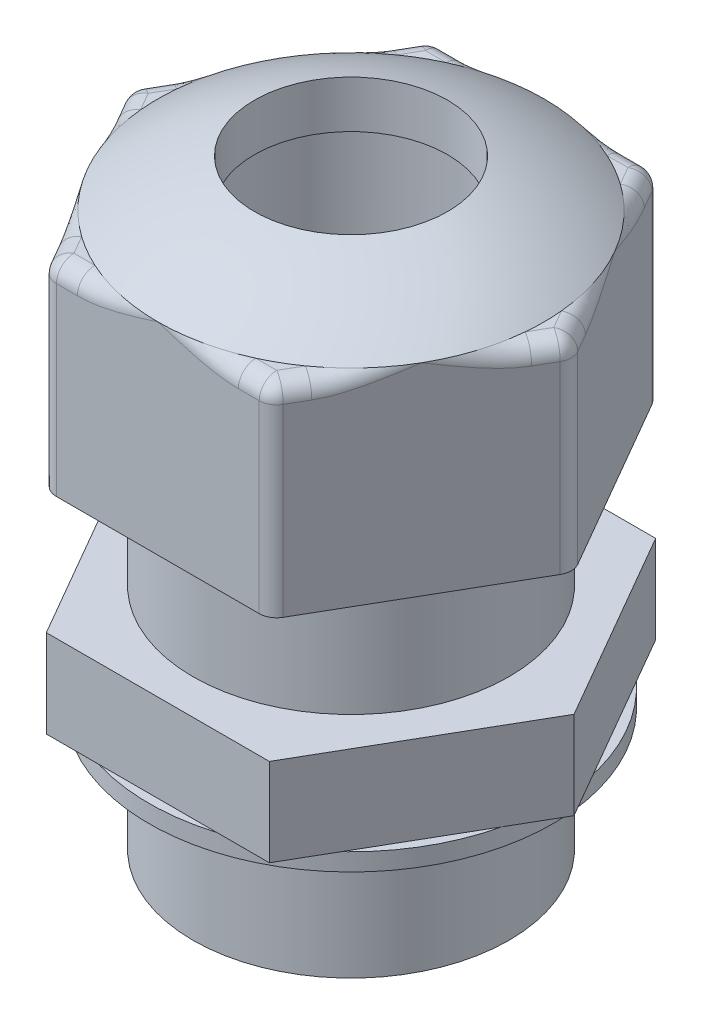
ISO-10303-21;
HEADER;
FILE_DESCRIPTION(('STEP AP214'),'2;1');
FILE_NAME('part.step','',(''),(''),'','','');
FILE_SCHEMA(('AUTOMOTIVE_DESIGN { 1 0 10303 214 1 1 1 1 }'));
ENDSEC;
DATA;
#1=APPLICATION_CONTEXT('core data for automotive mechanical design processes');
#2=APPLICATION_PROTOCOL_DEFINITION('international standard','automotive_design',2000,#1);
#3=PRODUCT_CONTEXT('',#1,'mechanical');
#4=PRODUCT('Part','Part','',(#3));
#5=PRODUCT_RELATED_PRODUCT_CATEGORY('part','',(#4));
#6=PRODUCT_DEFINITION_FORMATION('','',#4);
#7=PRODUCT_DEFINITION_CONTEXT('part definition',#1,'design');
#8=PRODUCT_DEFINITION('design','',#6,#7);
#9=PRODUCT_DEFINITION_SHAPE('','',#8);
#10=(LENGTH_UNIT() NAMED_UNIT(*) SI_UNIT(.MILLI.,.METRE.));
#11=(NAMED_UNIT(*) PLANE_ANGLE_UNIT() SI_UNIT($,.RADIAN.));
#12=(NAMED_UNIT(*) SI_UNIT($,.STERADIAN.) SOLID_ANGLE_UNIT());
#13=UNCERTAINTY_MEASURE_WITH_UNIT(LENGTH_MEASURE(1.E-05),#10,'distance_accuracy_value','');
#14=(GEOMETRIC_REPRESENTATION_CONTEXT(3) GLOBAL_UNCERTAINTY_ASSIGNED_CONTEXT((#13)) GLOBAL_UNIT_ASSIGNED_CONTEXT((#10,
#11,#12)) REPRESENTATION_CONTEXT('',''));
#15=CARTESIAN_POINT('',(0.,0.,0.));
#16=DIRECTION('',(0.,0.,1.));
#17=DIRECTION('',(1.,0.,0.));
#18=AXIS2_PLACEMENT_3D('',#15,#16,#17);
#19=CARTESIAN_POINT('',(0.,-1.,0.));
#20=DIRECTION('',(0.,-1.,0.));
#21=DIRECTION('',(0.,0.,-1.));
#22=AXIS2_PLACEMENT_3D('',#19,#20,#21);
#23=PLANE('',#22);
#24=CARTESIAN_POINT('',(0.,-1.,0.));
#25=DIRECTION('',(0.,-1.,0.));
#26=DIRECTION('',(0.,0.,-1.));
#27=AXIS2_PLACEMENT_3D('',#24,#25,#26);
#28=CIRCLE('',#27,11.5);
#29=CARTESIAN_POINT('',(0.,-1.,-11.5));
#30=VERTEX_POINT('',#29);
#31=EDGE_CURVE('E11',#30,#30,#28,.T.);
#32=ORIENTED_EDGE('',*,*,#31,.T.);
#33=EDGE_LOOP('',(#32));
#34=FACE_BOUND('',#33,.T.);
#35=CARTESIAN_POINT('',(0.,-1.,0.));
#36=DIRECTION('',(0.,-1.,0.));
#37=DIRECTION('',(0.,0.,-1.));
#38=AXIS2_PLACEMENT_3D('',#35,#36,#37);
#39=CIRCLE('',#38,9.);
#40=CARTESIAN_POINT('',(0.,-1.,-9.));
#41=VERTEX_POINT('',#40);
#42=EDGE_CURVE('E58',#41,#41,#39,.T.);
#43=ORIENTED_EDGE('',*,*,#42,.F.);
#44=EDGE_LOOP('',(#43));
#45=FACE_BOUND('',#44,.T.);
#46=ADVANCED_FACE('F47',(#34,#45),#23,.T.);
#47=CARTESIAN_POINT('',(0.,0.,0.));
#48=DIRECTION('',(0.,-1.,0.));
#49=DIRECTION('',(0.,0.,-1.));
#50=AXIS2_PLACEMENT_3D('',#47,#48,#49);
#51=PLANE('',#50);
#52=CARTESIAN_POINT('',(0.,0.,0.));
#53=DIRECTION('',(0.,-1.,0.));
#54=DIRECTION('',(0.,0.,-1.));
#55=AXIS2_PLACEMENT_3D('',#52,#53,#54);
#56=CIRCLE('',#55,11.5);
#57=CARTESIAN_POINT('',(0.,0.,-11.5));
#58=VERTEX_POINT('',#57);
#59=EDGE_CURVE('E51',#58,#58,#56,.T.);
#60=ORIENTED_EDGE('',*,*,#59,.F.);
#61=EDGE_LOOP('',(#60));
#62=FACE_BOUND('',#61,.T.);
#63=CARTESIAN_POINT('',(0.,0.,0.));
#64=DIRECTION('',(0.,-1.,0.));
#65=DIRECTION('',(0.,0.,-1.));
#66=AXIS2_PLACEMENT_3D('',#63,#64,#65);
#67=CIRCLE('',#66,9.);
#68=CARTESIAN_POINT('',(0.,0.,-9.));
#69=VERTEX_POINT('',#68);
#70=EDGE_CURVE('E60',#69,#69,#67,.T.);
#71=ORIENTED_EDGE('',*,*,#70,.T.);
#72=EDGE_LOOP('',(#71));
#73=FACE_BOUND('',#72,.T.);
#74=ADVANCED_FACE('F70',(#62,#73),#51,.F.);
#75=CARTESIAN_POINT('',(0.,-1.,0.));
#76=DIRECTION('',(0.,1.,0.));
#77=DIRECTION('',(0.,0.,1.));
#78=AXIS2_PLACEMENT_3D('',#75,#76,#77);
#79=CYLINDRICAL_SURFACE('',#78,11.5);
#80=ORIENTED_EDGE('',*,*,#31,.F.);
#81=EDGE_LOOP('',(#80));
#82=FACE_BOUND('',#81,.T.);
#83=ORIENTED_EDGE('',*,*,#59,.T.);
#84=EDGE_LOOP('',(#83));
#85=FACE_BOUND('',#84,.T.);
#86=ADVANCED_FACE('F49',(#82,#85),#79,.T.);
#87=CARTESIAN_POINT('',(0.,-1.,0.));
#88=DIRECTION('',(0.,1.,0.));
#89=DIRECTION('',(0.,0.,1.));
#90=AXIS2_PLACEMENT_3D('',#87,#88,#89);
#91=CYLINDRICAL_SURFACE('',#90,9.);
#92=ORIENTED_EDGE('',*,*,#42,.T.);
#93=EDGE_LOOP('',(#92));
#94=FACE_BOUND('',#93,.T.);
#95=ORIENTED_EDGE('',*,*,#70,.F.);
#96=EDGE_LOOP('',(#95));
#97=FACE_BOUND('',#96,.T.);
#98=ADVANCED_FACE('F66',(#94,#97),#91,.F.);
#99=CLOSED_SHELL('',(#46,#74,#86,#98));
#100=MANIFOLD_SOLID_BREP('B2',#99);
#101=CARTESIAN_POINT('',(0.,24.,0.));
#102=DIRECTION('',(0.,-1.,0.));
#103=DIRECTION('',(0.,0.,-1.));
#104=AXIS2_PLACEMENT_3D('',#101,#102,#103);
#105=CYLINDRICAL_SURFACE('',#104,9.);
#106=CARTESIAN_POINT('',(0.,5.,0.));
#107=DIRECTION('',(0.,1.,0.));
#108=DIRECTION('',(0.,0.,1.));
#109=AXIS2_PLACEMENT_3D('',#106,#107,#108);
#110=CIRCLE('',#109,9.);
#111=CARTESIAN_POINT('',(0.,5.,9.));
#112=VERTEX_POINT('',#111);
#113=EDGE_CURVE('E680',#112,#112,#110,.T.);
#114=ORIENTED_EDGE('',*,*,#113,.T.);
#115=EDGE_LOOP('',(#114));
#116=FACE_BOUND('',#115,.T.);
#117=CARTESIAN_POINT('',(0.,12.,0.));
#118=DIRECTION('',(0.,1.,0.));
#119=DIRECTION('',(0.,0.,1.));
#120=AXIS2_PLACEMENT_3D('',#117,#118,#119);
#121=CIRCLE('',#120,9.);
#122=CARTESIAN_POINT('',(0.,12.,9.));
#123=VERTEX_POINT('',#122);
#124=EDGE_CURVE('E495',#123,#123,#121,.T.);
#125=ORIENTED_EDGE('',*,*,#124,.F.);
#126=EDGE_LOOP('',(#125));
#127=FACE_BOUND('',#126,.T.);
#128=ADVANCED_FACE('F109',(#116,#127),#105,.T.);
#129=CARTESIAN_POINT('',(-6.35085296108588,5.,11.));
#130=DIRECTION('',(0.,0.,-1.));
#131=DIRECTION('',(-1.,0.,0.));
#132=AXIS2_PLACEMENT_3D('',#129,#130,#131);
#133=PLANE('',#132);
#134=DIRECTION('',(1.,0.,0.));
#135=VECTOR('',#134,1.);
#136=CARTESIAN_POINT('',(-6.35085296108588,0.,11.));
#137=LINE('',#136,#135);
#138=CARTESIAN_POINT('',(-6.35085296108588,0.,11.));
#139=VERTEX_POINT('',#138);
#140=CARTESIAN_POINT('',(6.35085296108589,0.,11.));
#141=VERTEX_POINT('',#140);
#142=EDGE_CURVE('E662',#139,#141,#137,.T.);
#143=ORIENTED_EDGE('',*,*,#142,.T.);
#144=DIRECTION('',(0.,-1.,0.));
#145=VECTOR('',#144,1.);
#146=CARTESIAN_POINT('',(6.35085296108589,5.,11.));
#147=LINE('',#146,#145);
#148=CARTESIAN_POINT('',(6.35085296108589,5.,11.));
#149=VERTEX_POINT('',#148);
#150=EDGE_CURVE('E671',#149,#141,#147,.T.);
#151=ORIENTED_EDGE('',*,*,#150,.F.);
#152=DIRECTION('',(1.,0.,0.));
#153=VECTOR('',#152,1.);
#154=CARTESIAN_POINT('',(-6.35085296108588,5.,11.));
#155=LINE('',#154,#153);
#156=CARTESIAN_POINT('',(-6.35085296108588,5.,11.));
#157=VERTEX_POINT('',#156);
#158=EDGE_CURVE('E1307',#157,#149,#155,.T.);
#159=ORIENTED_EDGE('',*,*,#158,.F.);
#160=DIRECTION('',(0.,-1.,0.));
#161=VECTOR('',#160,1.);
#162=CARTESIAN_POINT('',(-6.35085296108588,5.,11.));
#163=LINE('',#162,#161);
#164=EDGE_CURVE('E1308',#157,#139,#163,.T.);
#165=ORIENTED_EDGE('',*,*,#164,.T.);
#166=EDGE_LOOP('',(#143,#151,#159,#165));
#167=FACE_BOUND('',#166,.T.);
#168=ADVANCED_FACE('F629',(#167),#133,.F.);
#169=CARTESIAN_POINT('',(6.35085296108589,5.,11.));
#170=DIRECTION('',(-0.866025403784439,0.,-0.5));
#171=DIRECTION('',(-0.5,0.,0.866025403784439));
#172=AXIS2_PLACEMENT_3D('',#169,#170,#171);
#173=PLANE('',#172);
#174=DIRECTION('',(0.5,0.,-0.866025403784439));
#175=VECTOR('',#174,1.);
#176=CARTESIAN_POINT('',(6.35085296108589,0.,11.));
#177=LINE('',#176,#175);
#178=CARTESIAN_POINT('',(12.7017059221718,0.,0.));
#179=VERTEX_POINT('',#178);
#180=EDGE_CURVE('E665',#141,#179,#177,.T.);
#181=ORIENTED_EDGE('',*,*,#180,.T.);
#182=DIRECTION('',(0.,-1.,0.));
#183=VECTOR('',#182,1.);
#184=CARTESIAN_POINT('',(12.7017059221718,5.,0.));
#185=LINE('',#184,#183);
#186=CARTESIAN_POINT('',(12.7017059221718,5.,0.));
#187=VERTEX_POINT('',#186);
#188=EDGE_CURVE('E1285',#187,#179,#185,.T.);
#189=ORIENTED_EDGE('',*,*,#188,.F.);
#190=DIRECTION('',(0.5,0.,-0.866025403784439));
#191=VECTOR('',#190,1.);
#192=CARTESIAN_POINT('',(6.35085296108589,5.,11.));
#193=LINE('',#192,#191);
#194=EDGE_CURVE('E1326',#149,#187,#193,.T.);
#195=ORIENTED_EDGE('',*,*,#194,.F.);
#196=ORIENTED_EDGE('',*,*,#150,.T.);
#197=EDGE_LOOP('',(#181,#189,#195,#196));
#198=FACE_BOUND('',#197,.T.);
#199=ADVANCED_FACE('F636',(#198),#173,.F.);
#200=CARTESIAN_POINT('',(12.7017059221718,5.,0.));
#201=DIRECTION('',(-0.866025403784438,0.,0.5));
#202=DIRECTION('',(0.5,0.,0.866025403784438));
#203=AXIS2_PLACEMENT_3D('',#200,#201,#202);
#204=PLANE('',#203);
#205=DIRECTION('',(-0.5,0.,-0.866025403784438));
#206=VECTOR('',#205,1.);
#207=CARTESIAN_POINT('',(12.7017059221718,0.,0.));
#208=LINE('',#207,#206);
#209=CARTESIAN_POINT('',(6.35085296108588,0.,-11.));
#210=VERTEX_POINT('',#209);
#211=EDGE_CURVE('E1291',#179,#210,#208,.T.);
#212=ORIENTED_EDGE('',*,*,#211,.T.);
#213=DIRECTION('',(0.,-1.,0.));
#214=VECTOR('',#213,1.);
#215=CARTESIAN_POINT('',(6.35085296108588,5.,-11.));
#216=LINE('',#215,#214);
#217=CARTESIAN_POINT('',(6.35085296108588,5.,-11.));
#218=VERTEX_POINT('',#217);
#219=EDGE_CURVE('E1296',#218,#210,#216,.T.);
#220=ORIENTED_EDGE('',*,*,#219,.F.);
#221=DIRECTION('',(-0.5,0.,-0.866025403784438));
#222=VECTOR('',#221,1.);
#223=CARTESIAN_POINT('',(12.7017059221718,5.,0.));
#224=LINE('',#223,#222);
#225=EDGE_CURVE('E1295',#187,#218,#224,.T.);
#226=ORIENTED_EDGE('',*,*,#225,.F.);
#227=ORIENTED_EDGE('',*,*,#188,.T.);
#228=EDGE_LOOP('',(#212,#220,#226,#227));
#229=FACE_BOUND('',#228,.T.);
#230=ADVANCED_FACE('F1254',(#229),#204,.F.);
#231=CARTESIAN_POINT('',(6.35085296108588,5.,-11.));
#232=DIRECTION('',(0.,0.,1.));
#233=DIRECTION('',(1.,0.,0.));
#234=AXIS2_PLACEMENT_3D('',#231,#232,#233);
#235=PLANE('',#234);
#236=DIRECTION('',(-1.,0.,0.));
#237=VECTOR('',#236,1.);
#238=CARTESIAN_POINT('',(6.35085296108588,0.,-11.));
#239=LINE('',#238,#237);
#240=CARTESIAN_POINT('',(-6.35085296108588,0.,-11.));
#241=VERTEX_POINT('',#240);
#242=EDGE_CURVE('E1299',#210,#241,#239,.T.);
#243=ORIENTED_EDGE('',*,*,#242,.T.);
#244=DIRECTION('',(0.,-1.,0.));
#245=VECTOR('',#244,1.);
#246=CARTESIAN_POINT('',(-6.35085296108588,5.,-11.));
#247=LINE('',#246,#245);
#248=CARTESIAN_POINT('',(-6.35085296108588,5.,-11.));
#249=VERTEX_POINT('',#248);
#250=EDGE_CURVE('E1315',#249,#241,#247,.T.);
#251=ORIENTED_EDGE('',*,*,#250,.F.);
#252=DIRECTION('',(-1.,0.,0.));
#253=VECTOR('',#252,1.);
#254=CARTESIAN_POINT('',(6.35085296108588,5.,-11.));
#255=LINE('',#254,#253);
#256=EDGE_CURVE('E1320',#218,#249,#255,.T.);
#257=ORIENTED_EDGE('',*,*,#256,.F.);
#258=ORIENTED_EDGE('',*,*,#219,.T.);
#259=EDGE_LOOP('',(#243,#251,#257,#258));
#260=FACE_BOUND('',#259,.T.);
#261=ADVANCED_FACE('F1244',(#260),#235,.F.);
#262=CARTESIAN_POINT('',(-6.35085296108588,5.,-11.));
#263=DIRECTION('',(0.866025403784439,0.,0.5));
#264=DIRECTION('',(0.5,0.,-0.866025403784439));
#265=AXIS2_PLACEMENT_3D('',#262,#263,#264);
#266=PLANE('',#265);
#267=DIRECTION('',(-0.5,0.,0.866025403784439));
#268=VECTOR('',#267,1.);
#269=CARTESIAN_POINT('',(-6.35085296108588,0.,-11.));
#270=LINE('',#269,#268);
#271=CARTESIAN_POINT('',(-12.7017059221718,0.,0.));
#272=VERTEX_POINT('',#271);
#273=EDGE_CURVE('E1301',#241,#272,#270,.T.);
#274=ORIENTED_EDGE('',*,*,#273,.T.);
#275=DIRECTION('',(0.,-1.,0.));
#276=VECTOR('',#275,1.);
#277=CARTESIAN_POINT('',(-12.7017059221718,5.,0.));
#278=LINE('',#277,#276);
#279=CARTESIAN_POINT('',(-12.7017059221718,5.,0.));
#280=VERTEX_POINT('',#279);
#281=EDGE_CURVE('E1311',#280,#272,#278,.T.);
#282=ORIENTED_EDGE('',*,*,#281,.F.);
#283=DIRECTION('',(-0.5,0.,0.866025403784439));
#284=VECTOR('',#283,1.);
#285=CARTESIAN_POINT('',(-6.35085296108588,5.,-11.));
#286=LINE('',#285,#284);
#287=EDGE_CURVE('E1323',#249,#280,#286,.T.);
#288=ORIENTED_EDGE('',*,*,#287,.F.);
#289=ORIENTED_EDGE('',*,*,#250,.T.);
#290=EDGE_LOOP('',(#274,#282,#288,#289));
#291=FACE_BOUND('',#290,.T.);
#292=ADVANCED_FACE('F1234',(#291),#266,.F.);
#293=CARTESIAN_POINT('',(-12.7017059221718,5.,0.));
#294=DIRECTION('',(0.866025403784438,0.,-0.5));
#295=DIRECTION('',(-0.5,0.,-0.866025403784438));
#296=AXIS2_PLACEMENT_3D('',#293,#294,#295);
#297=PLANE('',#296);
#298=DIRECTION('',(0.5,0.,0.866025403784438));
#299=VECTOR('',#298,1.);
#300=CARTESIAN_POINT('',(-12.7017059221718,0.,0.));
#301=LINE('',#300,#299);
#302=EDGE_CURVE('E1305',#272,#139,#301,.T.);
#303=ORIENTED_EDGE('',*,*,#302,.T.);
#304=ORIENTED_EDGE('',*,*,#164,.F.);
#305=DIRECTION('',(0.5,0.,0.866025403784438));
#306=VECTOR('',#305,1.);
#307=CARTESIAN_POINT('',(-12.7017059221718,5.,0.));
#308=LINE('',#307,#306);
#309=EDGE_CURVE('E1312',#280,#157,#308,.T.);
#310=ORIENTED_EDGE('',*,*,#309,.F.);
#311=ORIENTED_EDGE('',*,*,#281,.T.);
#312=EDGE_LOOP('',(#303,#304,#310,#311));
#313=FACE_BOUND('',#312,.T.);
#314=ADVANCED_FACE('F1225',(#313),#297,.F.);
#315=CARTESIAN_POINT('',(6.35085296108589,5.,11.));
#316=DIRECTION('',(0.,1.,0.));
#317=DIRECTION('',(0.,0.,1.));
#318=AXIS2_PLACEMENT_3D('',#315,#316,#317);
#319=PLANE('',#318);
#320=ORIENTED_EDGE('',*,*,#113,.F.);
#321=EDGE_LOOP('',(#320));
#322=FACE_BOUND('',#321,.T.);
#323=ORIENTED_EDGE('',*,*,#158,.T.);
#324=ORIENTED_EDGE('',*,*,#194,.T.);
#325=ORIENTED_EDGE('',*,*,#225,.T.);
#326=ORIENTED_EDGE('',*,*,#256,.T.);
#327=ORIENTED_EDGE('',*,*,#287,.T.);
#328=ORIENTED_EDGE('',*,*,#309,.T.);
#329=EDGE_LOOP('',(#323,#324,#325,#326,#327,#328));
#330=FACE_BOUND('',#329,.T.);
#331=ADVANCED_FACE('F1216',(#322,#330),#319,.T.);
#332=CARTESIAN_POINT('',(6.35085296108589,0.,11.));
#333=DIRECTION('',(0.,1.,0.));
#334=DIRECTION('',(0.,0.,1.));
#335=AXIS2_PLACEMENT_3D('',#332,#333,#334);
#336=PLANE('',#335);
#337=CARTESIAN_POINT('',(0.,0.,0.));
#338=DIRECTION('',(0.,1.,0.));
#339=DIRECTION('',(0.,0.,1.));
#340=AXIS2_PLACEMENT_3D('',#337,#338,#339);
#341=CIRCLE('',#340,9.);
#342=CARTESIAN_POINT('',(0.,0.,9.));
#343=VERTEX_POINT('',#342);
#344=EDGE_CURVE('E660',#343,#343,#341,.T.);
#345=ORIENTED_EDGE('',*,*,#344,.T.);
#346=EDGE_LOOP('',(#345));
#347=FACE_BOUND('',#346,.T.);
#348=ORIENTED_EDGE('',*,*,#142,.F.);
#349=ORIENTED_EDGE('',*,*,#302,.F.);
#350=ORIENTED_EDGE('',*,*,#273,.F.);
#351=ORIENTED_EDGE('',*,*,#242,.F.);
#352=ORIENTED_EDGE('',*,*,#211,.F.);
#353=ORIENTED_EDGE('',*,*,#180,.F.);
#354=EDGE_LOOP('',(#348,#349,#350,#351,#352,#353));
#355=FACE_BOUND('',#354,.T.);
#356=ADVANCED_FACE('F652',(#347,#355),#336,.F.);
#357=CARTESIAN_POINT('',(0.,-8.,0.));
#358=DIRECTION('',(0.,-1.,0.));
#359=DIRECTION('',(0.,0.,-1.));
#360=AXIS2_PLACEMENT_3D('',#357,#358,#359);
#361=PLANE('',#360);
#362=CARTESIAN_POINT('',(0.,-8.,0.));
#363=DIRECTION('',(0.,1.,0.));
#364=DIRECTION('',(0.,0.,1.));
#365=AXIS2_PLACEMENT_3D('',#362,#363,#364);
#366=CIRCLE('',#365,6.75);
#367=CARTESIAN_POINT('',(0.,-8.,6.75));
#368=VERTEX_POINT('',#367);
#369=EDGE_CURVE('E667',#368,#368,#366,.T.);
#370=ORIENTED_EDGE('',*,*,#369,.T.);
#371=EDGE_LOOP('',(#370));
#372=FACE_BOUND('',#371,.T.);
#373=CARTESIAN_POINT('',(0.,-8.,0.));
#374=DIRECTION('',(0.,-1.,0.));
#375=DIRECTION('',(0.,0.,-1.));
#376=AXIS2_PLACEMENT_3D('',#373,#374,#375);
#377=CIRCLE('',#376,9.);
#378=CARTESIAN_POINT('',(0.,-8.,-9.));
#379=VERTEX_POINT('',#378);
#380=EDGE_CURVE('E657',#379,#379,#377,.T.);
#381=ORIENTED_EDGE('',*,*,#380,.T.);
#382=EDGE_LOOP('',(#381));
#383=FACE_BOUND('',#382,.T.);
#384=ADVANCED_FACE('F645',(#372,#383),#361,.T.);
#385=ORIENTED_EDGE('',*,*,#380,.F.);
#386=EDGE_LOOP('',(#385));
#387=FACE_BOUND('',#386,.T.);
#388=ORIENTED_EDGE('',*,*,#344,.F.);
#389=EDGE_LOOP('',(#388));
#390=FACE_BOUND('',#389,.T.);
#391=ADVANCED_FACE('F632',(#387,#390),#105,.T.);
#392=CARTESIAN_POINT('',(0.,-8.,0.));
#393=DIRECTION('',(0.,1.,0.));
#394=DIRECTION('',(0.,0.,1.));
#395=AXIS2_PLACEMENT_3D('',#392,#393,#394);
#396=CYLINDRICAL_SURFACE('',#395,6.75);
#397=CARTESIAN_POINT('',(0.,23.5,0.));
#398=DIRECTION('',(0.,-1.,0.));
#399=DIRECTION('',(0.,0.,-1.));
#400=AXIS2_PLACEMENT_3D('',#397,#398,#399);
#401=CIRCLE('',#400,6.75);
#402=CARTESIAN_POINT('',(0.,23.5,-6.75));
#403=VERTEX_POINT('',#402);
#404=EDGE_CURVE('E673',#403,#403,#401,.F.);
#405=ORIENTED_EDGE('',*,*,#404,.T.);
#406=EDGE_LOOP('',(#405));
#407=FACE_BOUND('',#406,.T.);
#408=ORIENTED_EDGE('',*,*,#369,.F.);
#409=EDGE_LOOP('',(#408));
#410=FACE_BOUND('',#409,.T.);
#411=ADVANCED_FACE('F644',(#407,#410),#396,.F.);
#412=CARTESIAN_POINT('',(0.,23.5,0.));
#413=DIRECTION('',(0.,-1.,0.));
#414=DIRECTION('',(0.,0.,-1.));
#415=AXIS2_PLACEMENT_3D('',#412,#413,#414);
#416=PLANE('',#415);
#417=CARTESIAN_POINT('',(0.,23.5,0.));
#418=DIRECTION('',(0.,-1.,0.));
#419=DIRECTION('',(0.,0.,-1.));
#420=AXIS2_PLACEMENT_3D('',#417,#418,#419);
#421=CIRCLE('',#420,5.5);
#422=CARTESIAN_POINT('',(0.,23.5,-5.5));
#423=VERTEX_POINT('',#422);
#424=EDGE_CURVE('E1078',#423,#423,#421,.T.);
#425=ORIENTED_EDGE('',*,*,#424,.F.);
#426=EDGE_LOOP('',(#425));
#427=FACE_BOUND('',#426,.T.);
#428=ORIENTED_EDGE('',*,*,#404,.F.);
#429=EDGE_LOOP('',(#428));
#430=FACE_BOUND('',#429,.T.);
#431=ADVANCED_FACE('F539',(#427,#430),#416,.T.);
#432=CARTESIAN_POINT('',(-6.35085296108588,23.5,11.));
#433=DIRECTION('',(0.,1.,0.));
#434=DIRECTION('',(0.,0.,1.));
#435=AXIS2_PLACEMENT_3D('',#432,#433,#434);
#436=PLANE('',#435);
#437=CARTESIAN_POINT('',(0.,23.5,0.));
#438=DIRECTION('',(0.,-1.,0.));
#439=DIRECTION('',(0.,0.,-1.));
#440=AXIS2_PLACEMENT_3D('',#437,#438,#439);
#441=CIRCLE('',#440,11.);
#442=CARTESIAN_POINT('',(-4.58257569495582,23.5,9.99999999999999));
#443=VERTEX_POINT('',#442);
#444=CARTESIAN_POINT('',(-6.36896619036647,23.5,8.96862696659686));
#445=VERTEX_POINT('',#444);
#446=EDGE_CURVE('E365',#443,#445,#441,.T.);
#447=ORIENTED_EDGE('',*,*,#446,.T.);
#448=DIRECTION('',(0.5,0.,0.866025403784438));
#449=VECTOR('',#448,1.);
#450=CARTESIAN_POINT('',(-5.48482755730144,23.5,10.5));
#451=LINE('',#450,#449);
#452=CARTESIAN_POINT('',(-5.77350269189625,23.5,9.99999999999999));
#453=VERTEX_POINT('',#452);
#454=EDGE_CURVE('E45',#445,#453,#451,.T.);
#455=ORIENTED_EDGE('',*,*,#454,.T.);
#456=DIRECTION('',(1.,0.,0.));
#457=VECTOR('',#456,1.);
#458=CARTESIAN_POINT('',(0.,23.5,9.99999999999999));
#459=LINE('',#458,#457);
#460=EDGE_CURVE('E118',#453,#443,#459,.T.);
#461=ORIENTED_EDGE('',*,*,#460,.T.);
#462=EDGE_LOOP('',(#447,#455,#461));
#463=FACE_BOUND('',#462,.T.);
#464=ADVANCED_FACE('F1158',(#463),#436,.T.);
#465=DIRECTION('',(-0.5,0.,0.866025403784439));
#466=VECTOR('',#465,1.);
#467=CARTESIAN_POINT('',(-11.8356805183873,23.5,0.499999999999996));
#468=LINE('',#467,#466);
#469=CARTESIAN_POINT('',(-10.9515418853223,23.5,-1.03137303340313));
#470=VERTEX_POINT('',#469);
#471=CARTESIAN_POINT('',(-11.5470053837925,23.5,0.));
#472=VERTEX_POINT('',#471);
#473=EDGE_CURVE('E1053',#470,#472,#468,.T.);
#474=ORIENTED_EDGE('',*,*,#473,.T.);
#475=DIRECTION('',(0.5,0.,0.866025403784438));
#476=VECTOR('',#475,1.);
#477=CARTESIAN_POINT('',(-8.66025403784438,23.5,5.00000000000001));
#478=LINE('',#477,#476);
#479=CARTESIAN_POINT('',(-10.9515418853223,23.5,1.03137303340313));
#480=VERTEX_POINT('',#479);
#481=EDGE_CURVE('E464',#472,#480,#478,.T.);
#482=ORIENTED_EDGE('',*,*,#481,.T.);
#483=EDGE_CURVE('E867',#480,#470,#441,.T.);
#484=ORIENTED_EDGE('',*,*,#483,.T.);
#485=EDGE_LOOP('',(#474,#482,#484));
#486=FACE_BOUND('',#485,.T.);
#487=ADVANCED_FACE('F1058',(#486),#436,.T.);
#488=DIRECTION('',(-1.,0.,0.));
#489=VECTOR('',#488,1.);
#490=CARTESIAN_POINT('',(-6.35085296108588,23.5,-10.));
#491=LINE('',#490,#489);
#492=CARTESIAN_POINT('',(-4.58257569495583,23.5,-10.));
#493=VERTEX_POINT('',#492);
#494=CARTESIAN_POINT('',(-5.77350269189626,23.5,-10.));
#495=VERTEX_POINT('',#494);
#496=EDGE_CURVE('E1101',#493,#495,#491,.T.);
#497=ORIENTED_EDGE('',*,*,#496,.T.);
#498=DIRECTION('',(-0.5,0.,0.866025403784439));
#499=VECTOR('',#498,1.);
#500=CARTESIAN_POINT('',(-8.66025403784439,23.5,-5.));
#501=LINE('',#500,#499);
#502=CARTESIAN_POINT('',(-6.36896619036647,23.5,-8.96862696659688));
#503=VERTEX_POINT('',#502);
#504=EDGE_CURVE('E1041',#495,#503,#501,.T.);
#505=ORIENTED_EDGE('',*,*,#504,.T.);
#506=EDGE_CURVE('E871',#503,#493,#441,.T.);
#507=ORIENTED_EDGE('',*,*,#506,.T.);
#508=EDGE_LOOP('',(#497,#505,#507));
#509=FACE_BOUND('',#508,.T.);
#510=ADVANCED_FACE('F1099',(#509),#436,.T.);
#511=DIRECTION('',(-0.5,0.,-0.866025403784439));
#512=VECTOR('',#511,1.);
#513=CARTESIAN_POINT('',(5.48482755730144,23.5,-10.5));
#514=LINE('',#513,#512);
#515=CARTESIAN_POINT('',(6.36896619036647,23.5,-8.96862696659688));
#516=VERTEX_POINT('',#515);
#517=CARTESIAN_POINT('',(5.77350269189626,23.5,-10.));
#518=VERTEX_POINT('',#517);
#519=EDGE_CURVE('E1012',#516,#518,#514,.T.);
#520=ORIENTED_EDGE('',*,*,#519,.T.);
#521=DIRECTION('',(-1.,0.,0.));
#522=VECTOR('',#521,1.);
#523=CARTESIAN_POINT('',(0.,23.5,-10.));
#524=LINE('',#523,#522);
#525=CARTESIAN_POINT('',(4.58257569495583,23.5,-10.));
#526=VERTEX_POINT('',#525);
#527=EDGE_CURVE('E1014',#518,#526,#524,.T.);
#528=ORIENTED_EDGE('',*,*,#527,.T.);
#529=EDGE_CURVE('E878',#526,#516,#441,.T.);
#530=ORIENTED_EDGE('',*,*,#529,.T.);
#531=EDGE_LOOP('',(#520,#528,#530));
#532=FACE_BOUND('',#531,.T.);
#533=ADVANCED_FACE('F1121',(#532),#436,.T.);
#534=DIRECTION('',(0.5,0.,-0.866025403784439));
#535=VECTOR('',#534,1.);
#536=CARTESIAN_POINT('',(11.8356805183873,23.5,-0.500000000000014));
#537=LINE('',#536,#535);
#538=CARTESIAN_POINT('',(10.9515418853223,23.5,1.03137303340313));
#539=VERTEX_POINT('',#538);
#540=CARTESIAN_POINT('',(11.5470053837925,23.5,0.));
#541=VERTEX_POINT('',#540);
#542=EDGE_CURVE('E918',#539,#541,#537,.T.);
#543=ORIENTED_EDGE('',*,*,#542,.T.);
#544=DIRECTION('',(-0.5,0.,-0.866025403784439));
#545=VECTOR('',#544,1.);
#546=CARTESIAN_POINT('',(8.66025403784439,23.5,-5.));
#547=LINE('',#546,#545);
#548=CARTESIAN_POINT('',(10.9515418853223,23.5,-1.03137303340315));
#549=VERTEX_POINT('',#548);
#550=EDGE_CURVE('E924',#541,#549,#547,.T.);
#551=ORIENTED_EDGE('',*,*,#550,.T.);
#552=EDGE_CURVE('E375',#549,#539,#441,.T.);
#553=ORIENTED_EDGE('',*,*,#552,.T.);
#554=EDGE_LOOP('',(#543,#551,#553));
#555=FACE_BOUND('',#554,.T.);
#556=ADVANCED_FACE('F1166',(#555),#436,.T.);
#557=DIRECTION('',(1.,0.,0.));
#558=VECTOR('',#557,1.);
#559=CARTESIAN_POINT('',(6.35085296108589,23.5,9.99999999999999));
#560=LINE('',#559,#558);
#561=CARTESIAN_POINT('',(4.58257569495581,23.5,9.99999999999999));
#562=VERTEX_POINT('',#561);
#563=CARTESIAN_POINT('',(5.77350269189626,23.5,9.99999999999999));
#564=VERTEX_POINT('',#563);
#565=EDGE_CURVE('E677',#562,#564,#560,.T.);
#566=ORIENTED_EDGE('',*,*,#565,.T.);
#567=DIRECTION('',(0.5,0.,-0.866025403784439));
#568=VECTOR('',#567,1.);
#569=CARTESIAN_POINT('',(8.66025403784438,23.5,5.));
#570=LINE('',#569,#568);
#571=CARTESIAN_POINT('',(6.36896619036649,23.5,8.96862696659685));
#572=VERTEX_POINT('',#571);
#573=EDGE_CURVE('E679',#564,#572,#570,.T.);
#574=ORIENTED_EDGE('',*,*,#573,.T.);
#575=EDGE_CURVE('E374',#572,#562,#441,.T.);
#576=ORIENTED_EDGE('',*,*,#575,.T.);
#577=EDGE_LOOP('',(#566,#574,#576));
#578=FACE_BOUND('',#577,.T.);
#579=ADVANCED_FACE('F530',(#578),#436,.T.);
#580=CARTESIAN_POINT('',(-6.35085296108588,12.,11.));
#581=DIRECTION('',(0.,1.,0.));
#582=DIRECTION('',(0.,0.,1.));
#583=AXIS2_PLACEMENT_3D('',#580,#581,#582);
#584=PLANE('',#583);
#585=DIRECTION('',(0.5,0.,0.866025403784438));
#586=VECTOR('',#585,1.);
#587=CARTESIAN_POINT('',(-12.7017059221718,12.,0.));
#588=LINE('',#587,#586);
#589=CARTESIAN_POINT('',(-12.413030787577,12.,0.499999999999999));
#590=VERTEX_POINT('',#589);
#591=CARTESIAN_POINT('',(-6.63952809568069,12.,10.5));
#592=VERTEX_POINT('',#591);
#593=EDGE_CURVE('E479',#590,#592,#588,.T.);
#594=ORIENTED_EDGE('',*,*,#593,.F.);
#595=CARTESIAN_POINT('',(-11.5470053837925,12.,0.));
#596=DIRECTION('',(0.,1.,0.));
#597=DIRECTION('',(0.,0.,1.));
#598=AXIS2_PLACEMENT_3D('',#595,#596,#597);
#599=CIRCLE('',#598,1.);
#600=CARTESIAN_POINT('',(-12.413030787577,12.,-0.5));
#601=VERTEX_POINT('',#600);
#602=EDGE_CURVE('E490',#590,#601,#599,.F.);
#603=ORIENTED_EDGE('',*,*,#602,.T.);
#604=DIRECTION('',(-0.5,0.,0.866025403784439));
#605=VECTOR('',#604,1.);
#606=CARTESIAN_POINT('',(-6.35085296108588,12.,-11.));
#607=LINE('',#606,#605);
#608=CARTESIAN_POINT('',(-6.63952809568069,12.,-10.5));
#609=VERTEX_POINT('',#608);
#610=EDGE_CURVE('E1090',#609,#601,#607,.T.);
#611=ORIENTED_EDGE('',*,*,#610,.F.);
#612=CARTESIAN_POINT('',(-5.77350269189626,12.,-10.));
#613=DIRECTION('',(0.,1.,0.));
#614=DIRECTION('',(0.,0.,1.));
#615=AXIS2_PLACEMENT_3D('',#612,#613,#614);
#616=CIRCLE('',#615,1.);
#617=CARTESIAN_POINT('',(-5.77350269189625,12.,-11.));
#618=VERTEX_POINT('',#617);
#619=EDGE_CURVE('E500',#609,#618,#616,.F.);
#620=ORIENTED_EDGE('',*,*,#619,.T.);
#621=DIRECTION('',(-1.,0.,0.));
#622=VECTOR('',#621,1.);
#623=CARTESIAN_POINT('',(6.35085296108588,12.,-11.));
#624=LINE('',#623,#622);
#625=CARTESIAN_POINT('',(5.77350269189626,12.,-11.));
#626=VERTEX_POINT('',#625);
#627=EDGE_CURVE('E992',#626,#618,#624,.T.);
#628=ORIENTED_EDGE('',*,*,#627,.F.);
#629=CARTESIAN_POINT('',(5.77350269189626,12.,-10.));
#630=DIRECTION('',(0.,1.,0.));
#631=DIRECTION('',(0.,0.,1.));
#632=AXIS2_PLACEMENT_3D('',#629,#630,#631);
#633=CIRCLE('',#632,1.);
#634=CARTESIAN_POINT('',(6.63952809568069,12.,-10.5));
#635=VERTEX_POINT('',#634);
#636=EDGE_CURVE('E503',#626,#635,#633,.F.);
#637=ORIENTED_EDGE('',*,*,#636,.T.);
#638=DIRECTION('',(-0.5,0.,-0.866025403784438));
#639=VECTOR('',#638,1.);
#640=CARTESIAN_POINT('',(12.7017059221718,12.,0.));
#641=LINE('',#640,#639);
#642=CARTESIAN_POINT('',(12.413030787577,12.,-0.500000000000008));
#643=VERTEX_POINT('',#642);
#644=EDGE_CURVE('E990',#643,#635,#641,.T.);
#645=ORIENTED_EDGE('',*,*,#644,.F.);
#646=CARTESIAN_POINT('',(11.5470053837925,12.,0.));
#647=DIRECTION('',(0.,1.,0.));
#648=DIRECTION('',(0.,0.,1.));
#649=AXIS2_PLACEMENT_3D('',#646,#647,#648);
#650=CIRCLE('',#649,1.);
#651=CARTESIAN_POINT('',(12.413030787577,12.,0.499999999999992));
#652=VERTEX_POINT('',#651);
#653=EDGE_CURVE('E974',#643,#652,#650,.F.);
#654=ORIENTED_EDGE('',*,*,#653,.T.);
#655=DIRECTION('',(0.5,0.,-0.866025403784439));
#656=VECTOR('',#655,1.);
#657=CARTESIAN_POINT('',(6.35085296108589,12.,11.));
#658=LINE('',#657,#656);
#659=CARTESIAN_POINT('',(6.6395280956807,12.,10.5));
#660=VERTEX_POINT('',#659);
#661=EDGE_CURVE('E998',#660,#652,#658,.T.);
#662=ORIENTED_EDGE('',*,*,#661,.F.);
#663=CARTESIAN_POINT('',(5.77350269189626,12.,9.99999999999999));
#664=DIRECTION('',(0.,1.,0.));
#665=DIRECTION('',(0.,0.,1.));
#666=AXIS2_PLACEMENT_3D('',#663,#664,#665);
#667=CIRCLE('',#666,1.);
#668=CARTESIAN_POINT('',(5.77350269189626,12.,11.));
#669=VERTEX_POINT('',#668);
#670=EDGE_CURVE('E981',#660,#669,#667,.F.);
#671=ORIENTED_EDGE('',*,*,#670,.T.);
#672=DIRECTION('',(1.,0.,0.));
#673=VECTOR('',#672,1.);
#674=CARTESIAN_POINT('',(-6.35085296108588,12.,11.));
#675=LINE('',#674,#673);
#676=CARTESIAN_POINT('',(-5.77350269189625,12.,11.));
#677=VERTEX_POINT('',#676);
#678=EDGE_CURVE('E494',#677,#669,#675,.T.);
#679=ORIENTED_EDGE('',*,*,#678,.F.);
#680=CARTESIAN_POINT('',(-5.77350269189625,12.,9.99999999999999));
#681=DIRECTION('',(0.,1.,0.));
#682=DIRECTION('',(0.,0.,1.));
#683=AXIS2_PLACEMENT_3D('',#680,#681,#682);
#684=CIRCLE('',#683,1.);
#685=EDGE_CURVE('E493',#677,#592,#684,.F.);
#686=ORIENTED_EDGE('',*,*,#685,.T.);
#687=EDGE_LOOP('',(#594,#603,#611,#620,#628,#637,#645,#654,#662,#671,#679,#686));
#688=FACE_BOUND('',#687,.T.);
#689=ORIENTED_EDGE('',*,*,#124,.T.);
#690=EDGE_LOOP('',(#689));
#691=FACE_BOUND('',#690,.T.);
#692=ADVANCED_FACE('F487',(#688,#691),#584,.F.);
#693=CARTESIAN_POINT('',(-12.7017059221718,23.5,0.));
#694=DIRECTION('',(0.866025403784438,0.,-0.5));
#695=DIRECTION('',(-0.5,0.,-0.866025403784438));
#696=AXIS2_PLACEMENT_3D('',#693,#694,#695);
#697=PLANE('',#696);
#698=DIRECTION('',(0.5,0.,0.866025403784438));
#699=VECTOR('',#698,1.);
#700=CARTESIAN_POINT('',(-12.7017059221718,22.5,0.));
#701=LINE('',#700,#699);
#702=CARTESIAN_POINT('',(-11.8175672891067,22.5,1.53137303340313));
#703=VERTEX_POINT('',#702);
#704=CARTESIAN_POINT('',(-12.413030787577,22.5,0.499999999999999));
#705=VERTEX_POINT('',#704);
#706=EDGE_CURVE('E474',#703,#705,#701,.F.);
#707=ORIENTED_EDGE('',*,*,#706,.T.);
#708=DIRECTION('',(0.,-1.,0.));
#709=VECTOR('',#708,1.);
#710=CARTESIAN_POINT('',(-12.413030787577,23.5,0.499999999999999));
#711=LINE('',#710,#709);
#712=EDGE_CURVE('E383',#705,#590,#711,.T.);
#713=ORIENTED_EDGE('',*,*,#712,.T.);
#714=ORIENTED_EDGE('',*,*,#593,.T.);
#715=DIRECTION('',(0.,-1.,0.));
#716=VECTOR('',#715,1.);
#717=CARTESIAN_POINT('',(-6.63952809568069,23.5,10.5));
#718=LINE('',#717,#716);
#719=CARTESIAN_POINT('',(-6.63952809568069,22.5,10.5));
#720=VERTEX_POINT('',#719);
#721=EDGE_CURVE('E467',#592,#720,#718,.F.);
#722=ORIENTED_EDGE('',*,*,#721,.T.);
#723=DIRECTION('',(0.5,0.,0.866025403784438));
#724=VECTOR('',#723,1.);
#725=CARTESIAN_POINT('',(-9.52627944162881,22.5,5.50000000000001));
#726=LINE('',#725,#724);
#727=CARTESIAN_POINT('',(-7.23499159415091,22.5,9.46862696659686));
#728=VERTEX_POINT('',#727);
#729=EDGE_CURVE('E463',#720,#728,#726,.F.);
#730=ORIENTED_EDGE('',*,*,#729,.T.);
#731=CARTESIAN_POINT('',(-5.61915758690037,23.5,9.4564828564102));
#732=CARTESIAN_POINT('',(-6.91379848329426,24.1037379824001,10.0249497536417));
#733=CARTESIAN_POINT('',(-6.72262435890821,22.6145909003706,10.3560730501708));
#734=CARTESIAN_POINT('',(-5.65587361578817,23.5,9.43466685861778));
#735=CARTESIAN_POINT('',(-6.92089852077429,24.0610611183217,10.0126521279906));
#736=CARTESIAN_POINT('',(-6.74814196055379,22.6014985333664,10.3118752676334));
#737=CARTESIAN_POINT('',(-5.69294379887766,23.5,9.41234893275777));
#738=CARTESIAN_POINT('',(-6.93033522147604,24.0197060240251,9.99630728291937));
#739=CARTESIAN_POINT('',(-6.77382618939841,22.589779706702,10.2673888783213));
#740=CARTESIAN_POINT('',(-5.76764200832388,23.5,9.36676108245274));
#741=CARTESIAN_POINT('',(-6.95281510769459,23.9413570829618,9.95737097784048));
#742=CARTESIAN_POINT('',(-6.82543231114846,22.5688281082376,10.1780044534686));
#743=CARTESIAN_POINT('',(-5.80526969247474,23.5,9.34349172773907));
#744=CARTESIAN_POINT('',(-6.96576074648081,23.9041707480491,9.93494847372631));
#745=CARTESIAN_POINT('',(-6.85135405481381,22.5595938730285,10.1331066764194));
#746=CARTESIAN_POINT('',(-5.91864385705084,23.5,9.27241093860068));
#747=CARTESIAN_POINT('',(-7.00804424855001,23.8005135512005,9.86171129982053));
#748=CARTESIAN_POINT('',(-6.92925046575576,22.5352462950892,9.9981861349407));
#749=CARTESIAN_POINT('',(-5.99506246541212,23.5,9.22321958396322));
#750=CARTESIAN_POINT('',(-7.0417576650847,23.7377952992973,9.80331794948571));
#751=CARTESIAN_POINT('',(-6.98148202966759,22.5234266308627,9.90771841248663));
#752=CARTESIAN_POINT('',(-6.22392856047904,23.5,9.07170509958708));
#753=CARTESIAN_POINT('',(-7.14939997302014,23.5769777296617,9.61687600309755));
#754=CARTESIAN_POINT('',(-7.13724068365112,22.4988975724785,9.63793651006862));
#755=CARTESIAN_POINT('',(-6.37790843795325,23.5,8.96431189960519));
#756=CARTESIAN_POINT('',(-7.23474112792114,23.4913702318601,9.4690607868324));
#757=CARTESIAN_POINT('',(-7.24116268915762,22.4965416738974,9.45793831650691));
#758=CARTESIAN_POINT('',(-6.66947486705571,23.5,8.7491349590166));
#759=CARTESIAN_POINT('',(-7.40620986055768,23.368477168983,9.17206822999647));
#760=CARTESIAN_POINT('',(-7.43723667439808,22.5107052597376,9.11832821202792));
#761=CARTESIAN_POINT('',(-6.80702646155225,23.5,8.6426591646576));
#762=CARTESIAN_POINT('',(-7.49099102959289,23.3246734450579,9.02522293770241));
#763=CARTESIAN_POINT('',(-7.52944170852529,22.5252034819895,8.95862440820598));
#764=CARTESIAN_POINT('',(-7.08083526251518,23.5,8.41979366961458));
#765=CARTESIAN_POINT('',(-7.66424077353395,23.2602899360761,8.72514557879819));
#766=CARTESIAN_POINT('',(-7.71320928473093,22.5661732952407,8.64032962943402));
#767=CARTESIAN_POINT('',(-7.21709188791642,23.5,8.30339973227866));
#768=CARTESIAN_POINT('',(-7.75323263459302,23.238371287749,8.57100715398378));
#769=CARTESIAN_POINT('',(-7.804771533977,22.5926500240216,8.48173916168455));
#770=CARTESIAN_POINT('',(-7.48705928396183,23.5,8.06082766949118));
#771=CARTESIAN_POINT('',(-7.93291314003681,23.2115267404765,8.25979138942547));
#772=CARTESIAN_POINT('',(-7.98728388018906,22.6548737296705,8.16561850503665));
#773=CARTESIAN_POINT('',(-7.62076390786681,23.5,7.93462891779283));
#774=CARTESIAN_POINT('',(-8.02417793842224,23.2059076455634,8.10171612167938));
#775=CARTESIAN_POINT('',(-8.0782322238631,22.6906406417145,8.00809135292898));
#776=CARTESIAN_POINT('',(-7.88406372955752,23.5,7.67307174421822));
#777=CARTESIAN_POINT('',(-8.20720385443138,23.2071860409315,7.78470593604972));
#778=CARTESIAN_POINT('',(-8.25936453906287,22.7692886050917,7.69436098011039));
#779=CARTESIAN_POINT('',(-8.01365809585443,23.5,7.53771148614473));
#780=CARTESIAN_POINT('',(-8.29952033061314,23.213723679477,7.62480910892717));
#781=CARTESIAN_POINT('',(-8.34954835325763,22.8121710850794,7.53815803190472));
#782=CARTESIAN_POINT('',(-8.39715295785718,23.5,7.11568585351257));
#783=CARTESIAN_POINT('',(-8.57510235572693,23.2468705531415,7.14748703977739));
#784=CARTESIAN_POINT('',(-8.62099049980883,22.9497580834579,7.06800644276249));
#785=CARTESIAN_POINT('',(-8.64283111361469,23.5,6.81568263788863));
#786=CARTESIAN_POINT('',(-8.76467901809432,23.2871676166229,6.81913062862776));
#787=CARTESIAN_POINT('',(-8.80119514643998,23.0526591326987,6.75588283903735));
#788=CARTESIAN_POINT('',(-9.10366003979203,23.5,6.18670374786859));
#789=CARTESIAN_POINT('',(-9.13952668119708,23.383673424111,6.16987543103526));
#790=CARTESIAN_POINT('',(-9.15985031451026,23.2683422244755,6.13467386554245));
#791=CARTESIAN_POINT('',(-9.31884030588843,23.5,5.8577565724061));
#792=CARTESIAN_POINT('',(-9.32886906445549,23.4405484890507,5.84192480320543));
#793=CARTESIAN_POINT('',(-9.3383023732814,23.3811145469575,5.82558583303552));
#794=CARTESIAN_POINT('',(-9.51752799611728,23.5,5.51513129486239));
#795=CARTESIAN_POINT('',(-9.51793679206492,23.4974874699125,5.51444989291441));
#796=CARTESIAN_POINT('',(-9.51833405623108,23.4949749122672,5.5137618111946));
#797=CARTESIAN_POINT('',(-9.51928048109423,23.5,5.51210589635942));
#798=CARTESIAN_POINT('',(-9.51960549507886,23.4979900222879,5.51155961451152));
#799=CARTESIAN_POINT('',(-9.51992330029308,23.4959800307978,5.51100915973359));
#800=CARTESIAN_POINT('',(-9.52278226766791,23.5,5.5060539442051));
#801=CARTESIAN_POINT('',(-9.52294261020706,23.4989950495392,5.50577956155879));
#802=CARTESIAN_POINT('',(-9.52310151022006,23.4979900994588,5.50550433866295));
#803=CARTESIAN_POINT('',(-9.52453156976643,23.5,5.50302739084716));
#804=CARTESIAN_POINT('',(-9.52461102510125,23.4994975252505,5.50288978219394));
#805=CARTESIAN_POINT('',(-9.52469047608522,23.4989950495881,5.502752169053));
#806=CARTESIAN_POINT('',(-9.52627944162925,23.5,5.49999999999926));
#807=CARTESIAN_POINT('',(-9.52627944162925,23.5,5.49999999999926));
#808=CARTESIAN_POINT('',(-9.52627944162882,23.5,5.50000000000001));
#809=(BOUNDED_SURFACE() B_SPLINE_SURFACE(3,2,((#731,#732,#733),(#734,#735,#736),(#737,#738,
#739),(#740,#741,#742),(#743,#744,#745),(#746,#747,#748),(#749,#750,#751),(#752,#753,#754),
(#755,#756,#757),(#758,#759,#760),(#761,#762,#763),(#764,#765,#766),(#767,#768,#769),(#770,#771,
#772),(#773,#774,#775),(#776,#777,#778),(#779,#780,#781),(#782,#783,#784),(#785,#786,#787),
(#788,#789,#790),(#791,#792,#793),(#794,#795,#796),(#797,#798,#799),(#800,#801,#802),(#803,#804,
#805),(#806,#807,#808)),.UNSPECIFIED.,.F.,.F.,.F.) B_SPLINE_SURFACE_WITH_KNOTS((4,2,2,2,2,2,2,2,
2,2,2,2,4),(3,3),(0.,0.158016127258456,0.315938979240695,0.631011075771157,1.25306388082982,
1.80758949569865,2.36235318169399,2.91831727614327,3.47439313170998,4.59839839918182,
5.72130906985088,5.73130994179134,5.74130906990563),(0.,1.),
.UNSPECIFIED.) GEOMETRIC_REPRESENTATION_ITEM() RATIONAL_B_SPLINE_SURFACE(((1.,0.545240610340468,
1.),(1.,0.554817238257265,1.),(1.,0.564169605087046,1.),(1.,0.58243994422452,1.),(1.,
0.591358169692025,1.),(1.,0.617456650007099,1.),(1.,0.634027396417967,1.),(1.,0.68113931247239,
1.),(1.,0.709561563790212,1.),(1.,0.758804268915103,1.),(1.,0.780115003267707,1.),(1.,
0.819406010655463,1.),(1.,0.837384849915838,1.),(1.,0.870327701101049,1.),(1.,0.885285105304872,
1.),(1.,0.912331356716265,1.),(1.,0.92441962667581,1.),(1.,0.956806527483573,1.),(1.,
0.972881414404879,1.),(1.,0.994376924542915,1.),(1.,0.999807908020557,1.),(1.,0.999996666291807,
1.),(1.,0.999997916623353,1.),(1.,0.999999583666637,1.),(1.,1.00000000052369,1.),(1.,1.,1.))) REPRESENTATION_ITEM('') SURFACE());
#810=CARTESIAN_POINT('',(-6.72262435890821,22.6145909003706,10.3560730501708));
#811=CARTESIAN_POINT('',(-6.74814196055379,22.6014985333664,10.3118752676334));
#812=CARTESIAN_POINT('',(-6.77382618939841,22.589779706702,10.2673888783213));
#813=CARTESIAN_POINT('',(-6.82543231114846,22.5688281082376,10.1780044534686));
#814=CARTESIAN_POINT('',(-6.85135405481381,22.5595938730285,10.1331066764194));
#815=CARTESIAN_POINT('',(-6.92925046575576,22.5352462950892,9.9981861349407));
#816=CARTESIAN_POINT('',(-6.98148202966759,22.5234266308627,9.90771841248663));
#817=CARTESIAN_POINT('',(-7.13724068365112,22.4988975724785,9.63793651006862));
#818=CARTESIAN_POINT('',(-7.24116268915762,22.4965416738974,9.45793831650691));
#819=CARTESIAN_POINT('',(-7.43723667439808,22.5107052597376,9.11832821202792));
#820=CARTESIAN_POINT('',(-7.52944170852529,22.5252034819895,8.95862440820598));
#821=CARTESIAN_POINT('',(-7.71320928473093,22.5661732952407,8.64032962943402));
#822=CARTESIAN_POINT('',(-7.804771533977,22.5926500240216,8.48173916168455));
#823=CARTESIAN_POINT('',(-7.98728388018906,22.6548737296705,8.16561850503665));
#824=CARTESIAN_POINT('',(-8.0782322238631,22.6906406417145,8.00809135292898));
#825=CARTESIAN_POINT('',(-8.25936453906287,22.7692886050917,7.69436098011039));
#826=CARTESIAN_POINT('',(-8.34954835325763,22.8121710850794,7.53815803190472));
#827=CARTESIAN_POINT('',(-8.62099049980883,22.9497580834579,7.06800644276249));
#828=CARTESIAN_POINT('',(-8.80119514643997,23.0526591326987,6.75588283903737));
#829=CARTESIAN_POINT('',(-9.15985031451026,23.2683422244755,6.13467386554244));
#830=CARTESIAN_POINT('',(-9.33830237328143,23.3811145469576,5.82558583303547));
#831=CARTESIAN_POINT('',(-9.51833405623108,23.4949749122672,5.5137618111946));
#832=CARTESIAN_POINT('',(-9.51992330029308,23.4959800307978,5.51100915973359));
#833=CARTESIAN_POINT('',(-9.52310151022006,23.4979900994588,5.50550433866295));
#834=CARTESIAN_POINT('',(-9.52469047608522,23.4989950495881,5.502752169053));
#835=CARTESIAN_POINT('',(-9.52627944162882,23.5,5.50000000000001));
#836=B_SPLINE_CURVE_WITH_KNOTS('',3,(#810,#811,#812,#813,#814,#815,#816,#817,#818,#819,#820,
#821,#822,#823,#824,#825,#826,#827,#828,#829,#830,#831,#832,#833,#834,#835),.UNSPECIFIED.,.F.,
.F.,(4,2,2,2,2,2,2,2,2,2,2,2,4),(0.,0.158016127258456,0.315938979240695,0.631011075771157,
1.25306388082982,1.80758949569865,2.36235318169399,2.91831727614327,3.47439313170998,
4.59839839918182,5.72130906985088,5.73130994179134,5.74130906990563),.UNSPECIFIED.);
#837=CARTESIAN_POINT('',(-9.52627944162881,23.5,5.50000000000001));
#838=VERTEX_POINT('',#837);
#839=EDGE_CURVE('E457',#728,#838,#836,.T.);
#840=ORIENTED_EDGE('',*,*,#839,.T.);
#841=CARTESIAN_POINT('',(-12.3299345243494,22.6145909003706,0.643926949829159));
#842=CARTESIAN_POINT('',(-12.13876039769,24.1037379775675,0.975050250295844));
#843=CARTESIAN_POINT('',(-10.9991331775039,23.5,0.138091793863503));
#844=CARTESIAN_POINT('',(-12.3044169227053,22.6014985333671,0.688124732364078));
#845=CARTESIAN_POINT('',(-12.1316603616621,24.0610611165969,0.987347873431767));
#846=CARTESIAN_POINT('',(-10.9985979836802,23.5,0.180796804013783));
#847=CARTESIAN_POINT('',(-12.2787326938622,22.5897797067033,0.732611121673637));
#848=CARTESIAN_POINT('',(-12.1222236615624,24.0197060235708,1.00369271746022));
#849=CARTESIAN_POINT('',(-10.9978051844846,23.5,0.224059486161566));
#850=CARTESIAN_POINT('',(-12.2271265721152,22.5688281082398,0.821995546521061));
#851=CARTESIAN_POINT('',(-12.0997437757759,23.9413570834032,1.04262902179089));
#852=CARTESIAN_POINT('',(-10.9956740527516,23.5,0.311543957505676));
#853=CARTESIAN_POINT('',(-12.2012048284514,22.5595938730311,0.866893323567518));
#854=CARTESIAN_POINT('',(-12.0867981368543,23.9041707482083,1.06505152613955));
#855=CARTESIAN_POINT('',(-10.9943360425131,23.5,0.35576516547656));
#856=CARTESIAN_POINT('',(-12.1233084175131,22.5352462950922,1.00181386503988));
#857=CARTESIAN_POINT('',(-12.0445146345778,23.800513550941,1.13828870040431));
#858=CARTESIAN_POINT('',(-10.9894653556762,23.5,0.489490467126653));
#859=CARTESIAN_POINT('',(-12.0710768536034,22.5234266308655,1.09228158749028));
#860=CARTESIAN_POINT('',(-12.010801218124,23.7377952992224,1.19668205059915));
#861=CARTESIAN_POINT('',(-10.9850736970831,23.5,0.580266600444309));
#862=CARTESIAN_POINT('',(-11.9153181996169,22.4988975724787,1.3620634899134));
#863=CARTESIAN_POINT('',(-11.9031589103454,23.5769777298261,1.38312399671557));
#864=CARTESIAN_POINT('',(-10.9682913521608,23.5,0.85422769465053));
#865=CARTESIAN_POINT('',(-11.8113961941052,22.496541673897,1.54206168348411));
#866=CARTESIAN_POINT('',(-11.817817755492,23.4913702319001,1.53093921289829));
#867=CARTESIAN_POINT('',(-10.9522760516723,23.5,1.04127478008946));
#868=CARTESIAN_POINT('',(-11.6153222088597,22.5107052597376,1.88167178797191));
#869=CARTESIAN_POINT('',(-11.6463490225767,23.3684771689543,1.82793177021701));
#870=CARTESIAN_POINT('',(-10.911710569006,23.5,1.40136718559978));
#871=CARTESIAN_POINT('',(-11.5231171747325,22.5252034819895,2.04137559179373));
#872=CARTESIAN_POINT('',(-11.5615678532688,23.3246734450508,1.97477706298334));
#873=CARTESIAN_POINT('',(-10.8882756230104,23.5,1.5737282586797));
#874=CARTESIAN_POINT('',(-11.339349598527,22.5661732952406,2.3596703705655));
#875=CARTESIAN_POINT('',(-11.3883181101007,23.2602899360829,2.27485442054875));
#876=CARTESIAN_POINT('',(-10.8321728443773,23.5,1.92228638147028));
#877=CARTESIAN_POINT('',(-11.247787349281,22.5926500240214,2.5182608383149));
#878=CARTESIAN_POINT('',(-11.2993262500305,23.23837128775,2.42899284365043));
#879=CARTESIAN_POINT('',(-10.7995010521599,23.5,2.09848504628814));
#880=CARTESIAN_POINT('',(-11.0652750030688,22.6548737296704,2.83438149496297));
#881=CARTESIAN_POINT('',(-11.1196457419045,23.2115267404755,2.7402086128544));
#882=CARTESIAN_POINT('',(-10.7244111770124,23.5,2.45356970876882));
#883=CARTESIAN_POINT('',(-10.9743266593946,22.6906406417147,2.99190864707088));
#884=CARTESIAN_POINT('',(-11.0283809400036,23.2059076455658,2.89828388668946));
#885=CARTESIAN_POINT('',(-10.6819721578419,23.5,2.63246069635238));
#886=CARTESIAN_POINT('',(-10.7931943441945,22.7692886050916,3.3056390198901));
#887=CARTESIAN_POINT('',(-10.8453550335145,23.2071860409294,3.21529405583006));
#888=CARTESIAN_POINT('',(-10.5871069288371,23.5,2.99126358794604));
#889=CARTESIAN_POINT('',(-10.7030105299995,22.8121710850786,3.46184196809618));
#890=CARTESIAN_POINT('',(-10.7530385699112,23.2137236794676,3.37519086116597));
#891=CARTESIAN_POINT('',(-10.5346787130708,23.5,3.17117568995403));
#892=CARTESIAN_POINT('',(-10.4315683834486,22.9497580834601,3.93199355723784));
#893=CARTESIAN_POINT('',(-10.4774564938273,23.2468705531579,3.85251301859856));
#894=CARTESIAN_POINT('',(-10.3609411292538,23.5,3.71430496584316));
#895=CARTESIAN_POINT('',(-10.2513637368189,23.0526591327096,4.2441171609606));
#896=CARTESIAN_POINT('',(-10.2878796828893,23.2871676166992,4.18086968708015));
#897=CARTESIAN_POINT('',(-10.223969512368,23.5,4.07707060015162));
#898=CARTESIAN_POINT('',(-9.89270856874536,23.2683422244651,4.86532613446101));
#899=CARTESIAN_POINT('',(-9.9130323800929,23.3836734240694,4.83012426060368));
#900=CARTESIAN_POINT('',(-9.90967298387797,23.5,4.7906483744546));
#901=CARTESIAN_POINT('',(-9.71425650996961,23.3811145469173,5.17441416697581));
#902=CARTESIAN_POINT('',(-9.72369049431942,23.4405484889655,5.1580740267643));
#903=CARTESIAN_POINT('',(-9.73238749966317,23.5,5.14147181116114));
#904=CARTESIAN_POINT('',(-9.53422482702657,23.4949749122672,5.48623818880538));
#905=CARTESIAN_POINT('',(-9.53462210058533,23.4974874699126,5.4855500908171));
#906=CARTESIAN_POINT('',(-9.53500782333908,23.5,5.48485534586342));
#907=CARTESIAN_POINT('',(-9.53263558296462,23.4959800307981,5.4889908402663));
#908=CARTESIAN_POINT('',(-9.53295339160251,23.4979900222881,5.48844037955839));
#909=CARTESIAN_POINT('',(-9.53326398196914,23.5,5.48788576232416));
#910=CARTESIAN_POINT('',(-9.52945737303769,23.4979900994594,5.49449566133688));
#911=CARTESIAN_POINT('',(-9.52961626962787,23.4989950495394,5.49422044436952));
#912=CARTESIAN_POINT('',(-9.52977371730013,23.5,5.49394439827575));
#913=CARTESIAN_POINT('',(-9.52786840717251,23.4989950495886,5.49724783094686));
#914=CARTESIAN_POINT('',(-9.52794785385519,23.4994975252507,5.49711022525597));
#915=CARTESIAN_POINT('',(-9.52802729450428,23.5,5.49697261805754));
#916=CARTESIAN_POINT('',(-9.52627944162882,23.5,5.50000000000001));
#917=CARTESIAN_POINT('',(-9.52627944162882,23.5,5.50000000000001));
#918=CARTESIAN_POINT('',(-9.52627944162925,23.5,5.49999999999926));
#919=(BOUNDED_SURFACE() B_SPLINE_SURFACE(3,2,((#841,#842,#843),(#844,#845,#846),(#847,#848,
#849),(#850,#851,#852),(#853,#854,#855),(#856,#857,#858),(#859,#860,#861),(#862,#863,#864),
(#865,#866,#867),(#868,#869,#870),(#871,#872,#873),(#874,#875,#876),(#877,#878,#879),(#880,#881,
#882),(#883,#884,#885),(#886,#887,#888),(#889,#890,#891),(#892,#893,#894),(#895,#896,#897),
(#898,#899,#900),(#901,#902,#903),(#904,#905,#906),(#907,#908,#909),(#910,#911,#912),(#913,#914,
#915),(#916,#917,#918)),.UNSPECIFIED.,.F.,.F.,.F.) B_SPLINE_SURFACE_WITH_KNOTS((4,2,2,2,2,2,2,2,
2,2,2,2,4),(3,3),(0.,0.158016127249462,0.315938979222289,0.631011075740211,1.25306388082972,
1.80758949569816,2.36235318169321,2.91831727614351,3.47439313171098,4.59839839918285,
5.72130906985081,5.73130994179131,5.74130906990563),(0.,1.),
.UNSPECIFIED.) GEOMETRIC_REPRESENTATION_ITEM() RATIONAL_B_SPLINE_SURFACE(((1.,0.545240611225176,
1.),(1.,0.554817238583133,1.),(1.,0.564169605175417,1.),(1.,0.582439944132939,1.),(1.,
0.591358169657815,1.),(1.,0.617456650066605,1.),(1.,0.634027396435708,1.),(1.,0.681139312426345,
1.),(1.,0.709561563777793,1.),(1.,0.758804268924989,1.),(1.,0.780115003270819,1.),(1.,
0.81940601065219,1.),(1.,0.837384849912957,1.),(1.,0.870327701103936,1.),(1.,0.885285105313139,
1.),(1.,0.912331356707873,1.),(1.,0.924419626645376,1.),(1.,0.956806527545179,1.),(1.,
0.972881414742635,1.),(1.,0.994376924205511,1.),(1.,0.999807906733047,1.),(1.,0.999996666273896,
1.),(1.,0.999997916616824,1.),(1.,0.999999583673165,1.),(1.,1.0000000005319,1.),(1.,1.,1.))) REPRESENTATION_ITEM('') SURFACE());
#920=CARTESIAN_POINT('',(-12.3299345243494,22.6145909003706,0.643926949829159));
#921=CARTESIAN_POINT('',(-12.3044169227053,22.6014985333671,0.688124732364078));
#922=CARTESIAN_POINT('',(-12.2787326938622,22.5897797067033,0.732611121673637));
#923=CARTESIAN_POINT('',(-12.2271265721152,22.5688281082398,0.821995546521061));
#924=CARTESIAN_POINT('',(-12.2012048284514,22.5595938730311,0.866893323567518));
#925=CARTESIAN_POINT('',(-12.1233084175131,22.5352462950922,1.00181386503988));
#926=CARTESIAN_POINT('',(-12.0710768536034,22.5234266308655,1.09228158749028));
#927=CARTESIAN_POINT('',(-11.9153181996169,22.4988975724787,1.3620634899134));
#928=CARTESIAN_POINT('',(-11.8113961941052,22.496541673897,1.54206168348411));
#929=CARTESIAN_POINT('',(-11.6153222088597,22.5107052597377,1.88167178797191));
#930=CARTESIAN_POINT('',(-11.5231171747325,22.5252034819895,2.04137559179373));
#931=CARTESIAN_POINT('',(-11.339349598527,22.5661732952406,2.3596703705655));
#932=CARTESIAN_POINT('',(-11.247787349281,22.5926500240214,2.5182608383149));
#933=CARTESIAN_POINT('',(-11.0652750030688,22.6548737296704,2.83438149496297));
#934=CARTESIAN_POINT('',(-10.9743266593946,22.6906406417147,2.99190864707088));
#935=CARTESIAN_POINT('',(-10.7931943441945,22.7692886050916,3.3056390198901));
#936=CARTESIAN_POINT('',(-10.7030105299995,22.8121710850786,3.46184196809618));
#937=CARTESIAN_POINT('',(-10.4315683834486,22.9497580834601,3.93199355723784));
#938=CARTESIAN_POINT('',(-10.2513637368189,23.0526591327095,4.2441171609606));
#939=CARTESIAN_POINT('',(-9.89270856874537,23.2683422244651,4.86532613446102));
#940=CARTESIAN_POINT('',(-9.71425650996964,23.3811145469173,5.17441416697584));
#941=CARTESIAN_POINT('',(-9.53422482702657,23.4949749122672,5.48623818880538));
#942=CARTESIAN_POINT('',(-9.53263558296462,23.4959800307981,5.4889908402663));
#943=CARTESIAN_POINT('',(-9.52945737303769,23.4979900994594,5.49449566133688));
#944=CARTESIAN_POINT('',(-9.52786840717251,23.4989950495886,5.49724783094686));
#945=CARTESIAN_POINT('',(-9.52627944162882,23.5,5.50000000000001));
#946=B_SPLINE_CURVE_WITH_KNOTS('',3,(#920,#921,#922,#923,#924,#925,#926,#927,#928,#929,#930,
#931,#932,#933,#934,#935,#936,#937,#938,#939,#940,#941,#942,#943,#944,#945),.UNSPECIFIED.,.F.,
.F.,(4,2,2,2,2,2,2,2,2,2,2,2,4),(0.,0.158016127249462,0.315938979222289,0.631011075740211,
1.25306388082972,1.80758949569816,2.36235318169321,2.91831727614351,3.47439313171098,
4.59839839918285,5.72130906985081,5.73130994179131,5.74130906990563),.UNSPECIFIED.);
#947=EDGE_CURVE('E469',#838,#703,#946,.F.);
#948=ORIENTED_EDGE('',*,*,#947,.T.);
#949=EDGE_LOOP('',(#707,#713,#714,#722,#730,#840,#948));
#950=FACE_BOUND('',#949,.T.);
#951=ADVANCED_FACE('F400',(#950),#697,.F.);
#952=CARTESIAN_POINT('',(-6.35085296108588,23.5,11.));
#953=DIRECTION('',(0.,0.,-1.));
#954=DIRECTION('',(-1.,0.,0.));
#955=AXIS2_PLACEMENT_3D('',#952,#953,#954);
#956=PLANE('',#955);
#957=ORIENTED_EDGE('',*,*,#678,.T.);
#958=DIRECTION('',(0.,-1.,0.));
#959=VECTOR('',#958,1.);
#960=CARTESIAN_POINT('',(5.77350269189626,23.5,11.));
#961=LINE('',#960,#959);
#962=CARTESIAN_POINT('',(5.77350269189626,22.5,11.));
#963=VERTEX_POINT('',#962);
#964=EDGE_CURVE('E984',#669,#963,#961,.F.);
#965=ORIENTED_EDGE('',*,*,#964,.T.);
#966=DIRECTION('',(1.,0.,0.));
#967=VECTOR('',#966,1.);
#968=CARTESIAN_POINT('',(0.,22.5,11.));
#969=LINE('',#968,#967);
#970=CARTESIAN_POINT('',(4.58257569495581,22.5,11.));
#971=VERTEX_POINT('',#970);
#972=EDGE_CURVE('E351',#963,#971,#969,.F.);
#973=ORIENTED_EDGE('',*,*,#972,.T.);
#974=CARTESIAN_POINT('',(5.37997559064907,23.5,9.59457464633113));
#975=CARTESIAN_POINT('',(5.22496191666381,24.1037379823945,11.));
#976=CARTESIAN_POINT('',(5.60731016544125,22.6145909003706,11.));
#977=CARTESIAN_POINT('',(5.34272436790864,23.5,9.61546366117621));
#978=CARTESIAN_POINT('',(5.21076184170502,24.0610611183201,11.));
#979=CARTESIAN_POINT('',(5.55627496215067,22.6014985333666,11.));
#980=CARTESIAN_POINT('',(5.30486138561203,23.5,9.6364084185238));
#981=CARTESIAN_POINT('',(5.1918884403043,24.0197060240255,11.));
#982=CARTESIAN_POINT('',(5.50490650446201,22.5897797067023,11.));
#983=CARTESIAN_POINT('',(5.2280320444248,23.5,9.67830504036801));
#984=CARTESIAN_POINT('',(5.14692866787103,23.941357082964,11.));
#985=CARTESIAN_POINT('',(5.40169426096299,22.568828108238,11.));
#986=CARTESIAN_POINT('',(5.18906635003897,23.5,9.69925689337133));
#987=CARTESIAN_POINT('',(5.12103739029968,23.9041707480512,11.));
#988=CARTESIAN_POINT('',(5.34985077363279,22.559593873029,11.));
#989=CARTESIAN_POINT('',(5.07082149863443,23.5,9.76190140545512));
#990=CARTESIAN_POINT('',(5.03647038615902,23.8005135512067,11.));
#991=CARTESIAN_POINT('',(5.19405795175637,22.5352462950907,11.));
#992=CARTESIAN_POINT('',(4.99001123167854,23.5,9.80348618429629));
#993=CARTESIAN_POINT('',(4.9690435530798,23.7377952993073,11.));
#994=CARTESIAN_POINT('',(5.08959482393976,22.5234266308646,11.));
#995=CARTESIAN_POINT('',(4.7443627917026,23.5,9.92593279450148));
#996=CARTESIAN_POINT('',(4.75375893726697,23.5769777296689,11.));
#997=CARTESIAN_POINT('',(4.77807751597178,22.4988975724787,11.));
#998=CARTESIAN_POINT('',(4.57436761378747,23.5,10.0055866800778));
#999=CARTESIAN_POINT('',(4.58307662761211,23.4913702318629,11.));
#1000=CARTESIAN_POINT('',(4.5702335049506,22.4965416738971,11.));
#1001=CARTESIAN_POINT('',(4.24223570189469,23.5,10.1505021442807));
#1002=CARTESIAN_POINT('',(4.24013916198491,23.3684771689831,11.));
#1003=CARTESIAN_POINT('',(4.1780855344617,22.5107052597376,11.));
#1004=CARTESIAN_POINT('',(4.08124916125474,23.5,10.2163874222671));
#1005=CARTESIAN_POINT('',(4.07057682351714,23.3246734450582,11.));
#1006=CARTESIAN_POINT('',(3.99367546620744,22.5252034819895,11.));
#1007=CARTESIAN_POINT('',(3.75133758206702,23.5,10.3420800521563));
#1008=CARTESIAN_POINT('',(3.72407733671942,23.2602899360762,11.));
#1009=CARTESIAN_POINT('',(3.62614031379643,22.5661732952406,11.));
#1010=CARTESIAN_POINT('',(3.58240916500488,23.5,10.4018847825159));
#1011=CARTESIAN_POINT('',(3.54609361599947,23.2383712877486,11.));
#1012=CARTESIAN_POINT('',(3.44301581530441,22.5926500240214,11.));
#1013=CARTESIAN_POINT('',(3.23735189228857,23.5,10.514397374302));
#1014=CARTESIAN_POINT('',(3.18673260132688,23.2115267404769,11.));
#1015=CARTESIAN_POINT('',(3.07799112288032,22.6548737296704,11.));
#1016=CARTESIAN_POINT('',(3.06120824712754,23.5,10.5670895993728));
#1017=CARTESIAN_POINT('',(3.00420299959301,23.2059076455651,11.));
#1018=CARTESIAN_POINT('',(2.89609443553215,22.6906406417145,11.));
#1019=CARTESIAN_POINT('',(2.70304320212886,23.5,10.6643353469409));
#1020=CARTESIAN_POINT('',(2.63815118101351,23.2071860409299,11.));
#1021=CARTESIAN_POINT('',(2.53382980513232,22.7692886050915,11.));
#1022=CARTESIAN_POINT('',(2.52102062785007,23.5,10.7088872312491));
#1023=CARTESIAN_POINT('',(2.45351824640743,23.213723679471,11.));
#1024=CARTESIAN_POINT('',(2.3534621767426,22.8121710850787,11.));
#1025=CARTESIAN_POINT('',(1.96378814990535,23.5,10.8299907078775));
#1026=CARTESIAN_POINT('',(1.90235412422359,23.2468705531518,11.));
#1027=CARTESIAN_POINT('',(1.81057788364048,22.949758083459,11.));
#1028=CARTESIAN_POINT('',(1.58113828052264,23.5,10.8927526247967));
#1029=CARTESIAN_POINT('',(1.52320058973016,23.2871676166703,11.));
#1030=CARTESIAN_POINT('',(1.45016859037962,23.0526591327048,11.));
#1031=CARTESIAN_POINT('',(0.806013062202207,23.5,10.9773527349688));
#1032=CARTESIAN_POINT('',(0.773505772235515,23.3836734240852,11.));
#1033=CARTESIAN_POINT('',(0.732858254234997,23.2683422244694,11.));
#1034=CARTESIAN_POINT('',(0.413547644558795,23.5,10.9992307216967));
#1035=CARTESIAN_POINT('',(0.394821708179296,23.4405484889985,11.));
#1036=CARTESIAN_POINT('',(0.375954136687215,23.3811145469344,11.));
#1037=CARTESIAN_POINT('',(0.0174798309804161,23.5,10.9999866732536));
#1038=CARTESIAN_POINT('',(0.0166853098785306,23.4974874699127,11.));
#1039=CARTESIAN_POINT('',(0.0158907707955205,23.4949749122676,11.));
#1040=CARTESIAN_POINT('',(0.0139835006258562,23.5,10.9999916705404));
#1041=CARTESIAN_POINT('',(0.0133478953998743,23.4979900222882,11.));
#1042=CARTESIAN_POINT('',(0.0127122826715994,23.4959800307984,11.));
#1043=CARTESIAN_POINT('',(0.00699144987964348,23.5,10.9999983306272));
#1044=CARTESIAN_POINT('',(0.00667366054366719,23.4989950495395,11.));
#1045=CARTESIAN_POINT('',(0.00635586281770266,23.4979900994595,11.));
#1046=CARTESIAN_POINT('',(0.00349572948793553,23.5,10.9999999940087));
#1047=CARTESIAN_POINT('',(0.00333683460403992,23.4994975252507,11.));
#1048=CARTESIAN_POINT('',(0.00317793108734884,23.4989950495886,11.));
#1049=CARTESIAN_POINT('',(1.78223831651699E-08,23.5,11.));
#1050=CARTESIAN_POINT('',(1.78223831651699E-08,23.5,11.));
#1051=CARTESIAN_POINT('',(0.,23.5,11.));
#1052=(BOUNDED_SURFACE() B_SPLINE_SURFACE(3,2,((#974,#975,#976),(#977,#978,#979),(#980,#981,
#982),(#983,#984,#985),(#986,#987,#988),(#989,#990,#991),(#992,#993,#994),(#995,#996,#997),
(#998,#999,#1000),(#1001,#1002,#1003),(#1004,#1005,#1006),(#1007,#1008,#1009),(#1010,#1011,
#1012),(#1013,#1014,#1015),(#1016,#1017,#1018),(#1019,#1020,#1021),(#1022,#1023,#1024),(#1025,
#1026,#1027),(#1028,#1029,#1030),(#1031,#1032,#1033),(#1034,#1035,#1036),(#1037,#1038,#1039),
(#1040,#1041,#1042),(#1043,#1044,#1045),(#1046,#1047,#1048),(#1049,#1050,#1051)),.UNSPECIFIED.,
.F.,.F.,.F.) B_SPLINE_SURFACE_WITH_KNOTS((4,2,2,2,2,2,2,2,2,2,2,2,4),(3,3),(0.,
0.158016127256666,0.315938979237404,0.631011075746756,1.25306388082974,1.80758949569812,
2.36235318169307,2.91831727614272,3.47439313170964,4.59839839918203,5.72130906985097,
5.73130994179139,5.74130906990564),(0.,1.),
.UNSPECIFIED.) GEOMETRIC_REPRESENTATION_ITEM() RATIONAL_B_SPLINE_SURFACE(((1.,0.545240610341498,
1.),(1.,0.554817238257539,1.),(1.,0.564169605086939,1.),(1.,0.582439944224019,1.),(1.,
0.59135816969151,1.),(1.,0.617456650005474,1.),(1.,0.634027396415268,1.),(1.,0.6811393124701,
1.),(1.,0.709561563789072,1.),(1.,0.758804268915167,1.),(1.,0.780115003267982,1.),(1.,
0.819406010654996,1.),(1.,0.837384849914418,1.),(1.,0.870327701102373,1.),(1.,0.885285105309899,
1.),(1.,0.912331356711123,1.),(1.,0.924419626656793,1.),(1.,0.956806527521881,1.),(1.,
0.972881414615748,1.),(1.,0.994376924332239,1.),(1.,0.999807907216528,1.),(1.,0.999996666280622,
1.),(1.,0.999997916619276,1.),(1.,0.999999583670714,1.),(1.,1.00000000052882,1.),(1.,1.,1.))) REPRESENTATION_ITEM('') SURFACE());
#1053=CARTESIAN_POINT('',(5.60731016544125,22.6145909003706,11.));
#1054=CARTESIAN_POINT('',(5.55627496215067,22.6014985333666,11.));
#1055=CARTESIAN_POINT('',(5.50490650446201,22.5897797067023,11.));
#1056=CARTESIAN_POINT('',(5.40169426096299,22.568828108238,11.));
#1057=CARTESIAN_POINT('',(5.34985077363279,22.559593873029,11.));
#1058=CARTESIAN_POINT('',(5.19405795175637,22.5352462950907,11.));
#1059=CARTESIAN_POINT('',(5.08959482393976,22.5234266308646,11.));
#1060=CARTESIAN_POINT('',(4.77807751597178,22.4988975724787,11.));
#1061=CARTESIAN_POINT('',(4.5702335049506,22.4965416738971,11.));
#1062=CARTESIAN_POINT('',(4.1780855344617,22.5107052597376,11.));
#1063=CARTESIAN_POINT('',(3.99367546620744,22.5252034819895,11.));
#1064=CARTESIAN_POINT('',(3.62614031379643,22.5661732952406,11.));
#1065=CARTESIAN_POINT('',(3.44301581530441,22.5926500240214,11.));
#1066=CARTESIAN_POINT('',(3.07799112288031,22.6548737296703,11.));
#1067=CARTESIAN_POINT('',(2.89609443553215,22.6906406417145,11.));
#1068=CARTESIAN_POINT('',(2.53382980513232,22.7692886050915,11.));
#1069=CARTESIAN_POINT('',(2.3534621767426,22.8121710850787,11.));
#1070=CARTESIAN_POINT('',(1.81057788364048,22.949758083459,11.));
#1071=CARTESIAN_POINT('',(1.45016859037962,23.0526591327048,11.));
#1072=CARTESIAN_POINT('',(0.732858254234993,23.2683422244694,11.));
#1073=CARTESIAN_POINT('',(0.3759541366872,23.3811145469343,11.));
#1074=CARTESIAN_POINT('',(0.0158907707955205,23.4949749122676,11.));
#1075=CARTESIAN_POINT('',(0.0127122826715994,23.4959800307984,11.));
#1076=CARTESIAN_POINT('',(0.00635586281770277,23.4979900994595,11.));
#1077=CARTESIAN_POINT('',(0.00317793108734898,23.4989950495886,11.));
#1078=CARTESIAN_POINT('',(0.,23.5,11.));
#1079=B_SPLINE_CURVE_WITH_KNOTS('',3,(#1053,#1054,#1055,#1056,#1057,#1058,#1059,#1060,#1061,
#1062,#1063,#1064,#1065,#1066,#1067,#1068,#1069,#1070,#1071,#1072,#1073,#1074,#1075,#1076,#1077,
#1078),.UNSPECIFIED.,.F.,.F.,(4,2,2,2,2,2,2,2,2,2,2,2,4),(0.,0.158016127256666,
0.315938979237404,0.631011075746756,1.25306388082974,1.80758949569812,2.36235318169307,
2.91831727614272,3.47439313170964,4.59839839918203,5.72130906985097,5.73130994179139,
5.74130906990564),.UNSPECIFIED.);
#1080=CARTESIAN_POINT('',(0.,23.5,11.));
#1081=VERTEX_POINT('',#1080);
#1082=EDGE_CURVE('E343',#971,#1081,#1079,.T.);
#1083=ORIENTED_EDGE('',*,*,#1082,.T.);
#1084=CARTESIAN_POINT('',(-5.60731016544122,22.6145909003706,11.));
#1085=CARTESIAN_POINT('',(-5.2249619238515,24.1037379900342,11.));
#1086=CARTESIAN_POINT('',(-5.37997559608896,23.5,9.59457464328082));
#1087=CARTESIAN_POINT('',(-5.55627496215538,22.601498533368,11.));
#1088=CARTESIAN_POINT('',(-5.2107618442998,24.061061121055,11.));
#1089=CARTESIAN_POINT('',(-5.34272436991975,23.5,9.61546366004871));
#1090=CARTESIAN_POINT('',(-5.50490650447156,22.5897797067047,11.));
#1091=CARTESIAN_POINT('',(-5.19188844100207,24.0197060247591,11.));
#1092=CARTESIAN_POINT('',(-5.30486138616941,23.5,9.6364084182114));
#1093=CARTESIAN_POINT('',(-5.40169426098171,22.5688281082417,11.));
#1094=CARTESIAN_POINT('',(-5.14692866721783,23.9413570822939,11.));
#1095=CARTESIAN_POINT('',(-5.22803204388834,23.5,9.67830504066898));
#1096=CARTESIAN_POINT('',(-5.34985077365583,22.559593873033,11.));
#1097=CARTESIAN_POINT('',(-5.12103739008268,23.9041707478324,11.));
#1098=CARTESIAN_POINT('',(-5.18906634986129,23.5,9.69925689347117));
#1099=CARTESIAN_POINT('',(-5.19405795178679,22.5352462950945,11.));
#1100=CARTESIAN_POINT('',(-5.03647038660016,23.8005135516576,11.));
#1101=CARTESIAN_POINT('',(-5.07082149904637,23.5,9.76190140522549));
#1102=CARTESIAN_POINT('',(-5.0895948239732,22.523426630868,11.));
#1103=CARTESIAN_POINT('',(-4.96904355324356,23.7377952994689,11.));
#1104=CARTESIAN_POINT('',(-4.99001123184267,23.5,9.80348618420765));
#1105=CARTESIAN_POINT('',(-4.77807751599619,22.498897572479,11.));
#1106=CARTESIAN_POINT('',(-4.75375893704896,23.5769777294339,11.));
#1107=CARTESIAN_POINT('',(-4.74436279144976,23.5,9.92593279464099));
#1108=CARTESIAN_POINT('',(-4.57023350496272,22.4965416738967,11.));
#1109=CARTESIAN_POINT('',(-4.58307662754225,23.4913702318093,11.));
#1110=CARTESIAN_POINT('',(-4.57436761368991,23.5,10.005586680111));
#1111=CARTESIAN_POINT('',(-4.17808553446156,22.5107052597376,11.));
#1112=CARTESIAN_POINT('',(-4.24013916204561,23.3684771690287,11.));
#1113=CARTESIAN_POINT('',(-4.2422357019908,23.5,10.1505021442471));
#1114=CARTESIAN_POINT('',(-3.99367546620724,22.5252034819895,11.));
#1115=CARTESIAN_POINT('',(-4.07057682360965,23.3246734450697,11.));
#1116=CARTESIAN_POINT('',(-4.0812491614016,23.5,10.2163874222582));
#1117=CARTESIAN_POINT('',(-3.62614031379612,22.5661732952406,11.));
#1118=CARTESIAN_POINT('',(-3.7240773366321,23.2602899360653,11.));
#1119=CARTESIAN_POINT('',(-3.751337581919,23.5,10.3420800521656));
#1120=CARTESIAN_POINT('',(-3.44301581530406,22.5926500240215,11.));
#1121=CARTESIAN_POINT('',(-3.54609361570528,23.2383712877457,11.));
#1122=CARTESIAN_POINT('',(-3.58240916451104,23.5,10.4018847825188));
#1123=CARTESIAN_POINT('',(-3.07799112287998,22.6548737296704,11.));
#1124=CARTESIAN_POINT('',(-3.1867326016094,23.2115267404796,11.));
#1125=CARTESIAN_POINT('',(-3.23735189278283,23.5,10.5143973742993));
#1126=CARTESIAN_POINT('',(-2.89609443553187,22.6906406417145,11.));
#1127=CARTESIAN_POINT('',(-3.00420300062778,23.2059076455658,11.));
#1128=CARTESIAN_POINT('',(-3.06120824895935,23.5,10.5670895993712));
#1129=CARTESIAN_POINT('',(-2.53382980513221,22.7692886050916,11.));
#1130=CARTESIAN_POINT('',(-2.63815118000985,23.2071860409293,11.));
#1131=CARTESIAN_POINT('',(-2.7030432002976,23.5,10.6643353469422));
#1132=CARTESIAN_POINT('',(-2.3534621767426,22.812171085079,11.));
#1133=CARTESIAN_POINT('',(-2.45351824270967,23.2137236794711,11.));
#1134=CARTESIAN_POINT('',(-2.52102062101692,23.5,10.7088872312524));
#1135=CARTESIAN_POINT('',(-1.81057788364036,22.9497580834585,11.));
#1136=CARTESIAN_POINT('',(-1.90235413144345,23.2468705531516,11.));
#1137=CARTESIAN_POINT('',(-1.96378816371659,23.5,10.8299907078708));
#1138=CARTESIAN_POINT('',(-1.45016859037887,23.0526591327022,11.));
#1139=CARTESIAN_POINT('',(-1.52320062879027,23.2871676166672,11.));
#1140=CARTESIAN_POINT('',(-1.58113835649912,23.5,10.8927526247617));
#1141=CARTESIAN_POINT('',(-0.73285825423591,23.268342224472,11.));
#1142=CARTESIAN_POINT('',(-0.773505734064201,23.3836734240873,11.));
#1143=CARTESIAN_POINT('',(-0.806012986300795,23.5,10.9773527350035));
#1144=CARTESIAN_POINT('',(-0.375954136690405,23.3811145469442,11.));
#1145=CARTESIAN_POINT('',(-0.394821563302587,23.4405484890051,11.0000000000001));
#1146=CARTESIAN_POINT('',(-0.413547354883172,23.5,10.9992307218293));
#1147=CARTESIAN_POINT('',(-0.0158907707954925,23.4949749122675,11.));
#1148=CARTESIAN_POINT('',(-0.0166853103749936,23.4974874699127,11.));
#1149=CARTESIAN_POINT('',(-0.0174798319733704,23.5,10.9999866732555));
#1150=CARTESIAN_POINT('',(-0.0127122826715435,23.4959800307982,11.));
#1151=CARTESIAN_POINT('',(-0.0133478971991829,23.4979900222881,11.));
#1152=CARTESIAN_POINT('',(-0.0139835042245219,23.5,10.999991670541));
#1153=CARTESIAN_POINT('',(-0.00635586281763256,23.4979900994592,11.));
#1154=CARTESIAN_POINT('',(-0.0066736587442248,23.4989950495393,11.));
#1155=CARTESIAN_POINT('',(-0.00699144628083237,23.5,10.9999983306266));
#1156=CARTESIAN_POINT('',(-0.00317793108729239,23.4989950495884,11.));
#1157=CARTESIAN_POINT('',(-0.00333682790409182,23.4994975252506,11.));
#1158=CARTESIAN_POINT('',(-0.00349571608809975,23.5,10.9999999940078));
#1159=CARTESIAN_POINT('',(0.,23.5,11.));
#1160=CARTESIAN_POINT('',(0.,23.5,11.));
#1161=CARTESIAN_POINT('',(1.78223831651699E-08,23.5,11.));
#1162=(BOUNDED_SURFACE() B_SPLINE_SURFACE(3,2,((#1084,#1085,#1086),(#1087,#1088,#1089),(#1090,
#1091,#1092),(#1093,#1094,#1095),(#1096,#1097,#1098),(#1099,#1100,#1101),(#1102,#1103,#1104),
(#1105,#1106,#1107),(#1108,#1109,#1110),(#1111,#1112,#1113),(#1114,#1115,#1116),(#1117,#1118,
#1119),(#1120,#1121,#1122),(#1123,#1124,#1125),(#1126,#1127,#1128),(#1129,#1130,#1131),(#1132,
#1133,#1134),(#1135,#1136,#1137),(#1138,#1139,#1140),(#1141,#1142,#1143),(#1144,#1145,#1146),
(#1147,#1148,#1149),(#1150,#1151,#1152),(#1153,#1154,#1155),(#1156,#1157,#1158),(#1159,#1160,
#1161)),.UNSPECIFIED.,.F.,.F.,.F.) B_SPLINE_SURFACE_WITH_KNOTS((4,2,2,2,2,2,2,2,2,2,2,2,4),(3,
3),(0.,0.15801612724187,0.315938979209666,0.631011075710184,1.2530638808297,1.8075894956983,
2.36235318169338,2.91831727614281,3.47439313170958,4.5983983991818,5.72130906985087,
5.73130994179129,5.74130906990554),(0.,1.),
.UNSPECIFIED.) GEOMETRIC_REPRESENTATION_ITEM() RATIONAL_B_SPLINE_SURFACE(((1.,0.545240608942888,
1.),(1.,0.554817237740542,1.),(1.,0.564169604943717,1.),(1.,0.582439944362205,1.),(1.,
0.5913581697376,1.),(1.,0.617456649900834,1.),(1.,0.63402739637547,1.),(1.,0.681139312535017,
1.),(1.,0.709561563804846,1.),(1.,0.75880426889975,1.),(1.,0.780115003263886,1.),(1.,
0.819406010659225,1.),(1.,0.837384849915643,1.),(1.,0.870327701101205,1.),(1.,0.88528510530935,
1.),(1.,0.912331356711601,1.),(1.,0.92441962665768,1.),(1.,0.95680652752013,1.),(1.,
0.972881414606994,1.),(1.,0.994376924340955,1.),(1.,0.999807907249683,1.),(1.,0.999996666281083,
1.),(1.,0.999997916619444,1.),(1.,0.999999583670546,1.),(1.,1.00000000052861,1.),(1.,1.,1.))) REPRESENTATION_ITEM('') SURFACE());
#1163=CARTESIAN_POINT('',(-5.60731016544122,22.6145909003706,11.));
#1164=CARTESIAN_POINT('',(-5.55627496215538,22.601498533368,11.));
#1165=CARTESIAN_POINT('',(-5.50490650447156,22.5897797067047,11.));
#1166=CARTESIAN_POINT('',(-5.40169426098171,22.5688281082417,11.));
#1167=CARTESIAN_POINT('',(-5.34985077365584,22.559593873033,11.));
#1168=CARTESIAN_POINT('',(-5.19405795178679,22.5352462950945,11.));
#1169=CARTESIAN_POINT('',(-5.0895948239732,22.523426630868,11.));
#1170=CARTESIAN_POINT('',(-4.77807751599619,22.498897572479,11.));
#1171=CARTESIAN_POINT('',(-4.57023350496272,22.4965416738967,11.));
#1172=CARTESIAN_POINT('',(-4.17808553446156,22.5107052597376,11.));
#1173=CARTESIAN_POINT('',(-3.99367546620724,22.5252034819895,11.));
#1174=CARTESIAN_POINT('',(-3.62614031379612,22.5661732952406,11.));
#1175=CARTESIAN_POINT('',(-3.44301581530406,22.5926500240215,11.));
#1176=CARTESIAN_POINT('',(-3.07799112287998,22.6548737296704,11.));
#1177=CARTESIAN_POINT('',(-2.89609443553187,22.6906406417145,11.));
#1178=CARTESIAN_POINT('',(-2.53382980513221,22.7692886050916,11.));
#1179=CARTESIAN_POINT('',(-2.3534621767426,22.812171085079,11.));
#1180=CARTESIAN_POINT('',(-1.81057788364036,22.9497580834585,11.));
#1181=CARTESIAN_POINT('',(-1.45016859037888,23.0526591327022,11.));
#1182=CARTESIAN_POINT('',(-0.732858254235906,23.268342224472,11.));
#1183=CARTESIAN_POINT('',(-0.375954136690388,23.3811145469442,11.));
#1184=CARTESIAN_POINT('',(-0.0158907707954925,23.4949749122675,11.));
#1185=CARTESIAN_POINT('',(-0.0127122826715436,23.4959800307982,11.));
#1186=CARTESIAN_POINT('',(-0.00635586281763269,23.4979900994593,11.));
#1187=CARTESIAN_POINT('',(-0.00317793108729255,23.4989950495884,11.));
#1188=CARTESIAN_POINT('',(0.,23.5,11.));
#1189=B_SPLINE_CURVE_WITH_KNOTS('',3,(#1163,#1164,#1165,#1166,#1167,#1168,#1169,#1170,#1171,
#1172,#1173,#1174,#1175,#1176,#1177,#1178,#1179,#1180,#1181,#1182,#1183,#1184,#1185,#1186,#1187,
#1188),.UNSPECIFIED.,.F.,.F.,(4,2,2,2,2,2,2,2,2,2,2,2,4),(0.,0.15801612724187,0.315938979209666,
0.631011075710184,1.2530638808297,1.8075894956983,2.36235318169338,2.91831727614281,
3.47439313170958,4.5983983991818,5.72130906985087,5.73130994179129,5.74130906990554),.UNSPECIFIED.);
#1190=CARTESIAN_POINT('',(-4.58257569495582,22.5,11.));
#1191=VERTEX_POINT('',#1190);
#1192=EDGE_CURVE('E348',#1081,#1191,#1189,.F.);
#1193=ORIENTED_EDGE('',*,*,#1192,.T.);
#1194=DIRECTION('',(1.,0.,0.));
#1195=VECTOR('',#1194,1.);
#1196=CARTESIAN_POINT('',(-6.35085296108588,22.5,11.));
#1197=LINE('',#1196,#1195);
#1198=CARTESIAN_POINT('',(-5.77350269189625,22.5,11.));
#1199=VERTEX_POINT('',#1198);
#1200=EDGE_CURVE('E379',#1191,#1199,#1197,.F.);
#1201=ORIENTED_EDGE('',*,*,#1200,.T.);
#1202=DIRECTION('',(0.,-1.,0.));
#1203=VECTOR('',#1202,1.);
#1204=CARTESIAN_POINT('',(-5.77350269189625,23.5,11.));
#1205=LINE('',#1204,#1203);
#1206=EDGE_CURVE('E356',#1199,#677,#1205,.T.);
#1207=ORIENTED_EDGE('',*,*,#1206,.T.);
#1208=EDGE_LOOP('',(#957,#965,#973,#1083,#1193,#1201,#1207));
#1209=FACE_BOUND('',#1208,.T.);
#1210=ADVANCED_FACE('F346',(#1209),#956,.F.);
#1211=CARTESIAN_POINT('',(6.35085296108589,23.5,11.));
#1212=DIRECTION('',(-0.866025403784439,0.,-0.5));
#1213=DIRECTION('',(-0.5,0.,0.866025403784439));
#1214=AXIS2_PLACEMENT_3D('',#1211,#1212,#1213);
#1215=PLANE('',#1214);
#1216=DIRECTION('',(0.5,0.,-0.866025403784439));
#1217=VECTOR('',#1216,1.);
#1218=CARTESIAN_POINT('',(6.35085296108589,22.5,11.));
#1219=LINE('',#1218,#1217);
#1220=CARTESIAN_POINT('',(7.23499159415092,22.5,9.46862696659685));
#1221=VERTEX_POINT('',#1220);
#1222=CARTESIAN_POINT('',(6.6395280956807,22.5,10.5));
#1223=VERTEX_POINT('',#1222);
#1224=EDGE_CURVE('E907',#1221,#1223,#1219,.F.);
#1225=ORIENTED_EDGE('',*,*,#1224,.T.);
#1226=DIRECTION('',(0.,-1.,0.));
#1227=VECTOR('',#1226,1.);
#1228=CARTESIAN_POINT('',(6.6395280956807,23.5,10.5));
#1229=LINE('',#1228,#1227);
#1230=EDGE_CURVE('E925',#1223,#660,#1229,.T.);
#1231=ORIENTED_EDGE('',*,*,#1230,.T.);
#1232=ORIENTED_EDGE('',*,*,#661,.T.);
#1233=DIRECTION('',(0.,-1.,0.));
#1234=VECTOR('',#1233,1.);
#1235=CARTESIAN_POINT('',(12.413030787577,23.5,0.499999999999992));
#1236=LINE('',#1235,#1234);
#1237=CARTESIAN_POINT('',(12.413030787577,22.5,0.499999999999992));
#1238=VERTEX_POINT('',#1237);
#1239=EDGE_CURVE('E908',#652,#1238,#1236,.F.);
#1240=ORIENTED_EDGE('',*,*,#1239,.T.);
#1241=DIRECTION('',(0.5,0.,-0.866025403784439));
#1242=VECTOR('',#1241,1.);
#1243=CARTESIAN_POINT('',(9.52627944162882,22.5,5.50000000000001));
#1244=LINE('',#1243,#1242);
#1245=CARTESIAN_POINT('',(11.8175672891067,22.5,1.53137303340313));
#1246=VERTEX_POINT('',#1245);
#1247=EDGE_CURVE('E689',#1238,#1246,#1244,.F.);
#1248=ORIENTED_EDGE('',*,*,#1247,.T.);
#1249=CARTESIAN_POINT('',(10.9991331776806,23.5,0.138091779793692));
#1250=CARTESIAN_POINT('',(12.1387604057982,24.1037379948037,0.975050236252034));
#1251=CARTESIAN_POINT('',(12.3299345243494,22.6145909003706,0.64392694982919));
#1252=CARTESIAN_POINT('',(10.998597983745,23.5,0.180796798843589));
#1253=CARTESIAN_POINT('',(12.131660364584,24.0610611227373,0.987347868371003));
#1254=CARTESIAN_POINT('',(12.3044169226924,22.6014985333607,0.688124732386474));
#1255=CARTESIAN_POINT('',(10.9978051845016,23.5,0.224059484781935));
#1256=CARTESIAN_POINT('',(12.1222236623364,24.0197060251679,1.00369271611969));
#1257=CARTESIAN_POINT('',(12.2787326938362,22.5897797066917,0.732611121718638));
#1258=CARTESIAN_POINT('',(10.9956740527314,23.5,0.311543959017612));
#1259=CARTESIAN_POINT('',(12.0997437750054,23.9413570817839,1.04262902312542));
#1260=CARTESIAN_POINT('',(12.2271265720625,22.5688281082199,0.821995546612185));
#1261=CARTESIAN_POINT('',(10.9943360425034,23.5,0.355765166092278));
#1262=CARTESIAN_POINT('',(12.0867981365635,23.9041707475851,1.06505152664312));
#1263=CARTESIAN_POINT('',(12.2012048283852,22.5595938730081,0.866893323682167));
#1264=CARTESIAN_POINT('',(10.9894653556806,23.5,0.48949046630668));
#1265=CARTESIAN_POINT('',(12.0445146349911,23.8005135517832,1.1382886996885));
#1266=CARTESIAN_POINT('',(12.1233084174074,22.5352462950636,1.00181386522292));
#1267=CARTESIAN_POINT('',(10.9850736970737,23.5,0.580266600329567));
#1268=CARTESIAN_POINT('',(12.0108012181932,23.7377952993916,1.19668205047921));
#1269=CARTESIAN_POINT('',(12.0710768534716,22.5234266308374,1.09228158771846));
#1270=CARTESIAN_POINT('',(10.9682913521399,23.5,0.85422769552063));
#1271=CARTESIAN_POINT('',(11.9031589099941,23.5769777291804,1.38312399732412));
#1272=CARTESIAN_POINT('',(11.915318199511,22.4988975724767,1.36206349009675));
#1273=CARTESIAN_POINT('',(10.9522760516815,23.5,1.04127478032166));
#1274=CARTESIAN_POINT('',(11.817817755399,23.4913702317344,1.53093921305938));
#1275=CARTESIAN_POINT('',(11.8113961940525,22.4965416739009,1.54206168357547));
#1276=CARTESIAN_POINT('',(10.911710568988,23.5,1.40136718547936));
#1277=CARTESIAN_POINT('',(11.6463490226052,23.3684771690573,1.82793177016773));
#1278=CARTESIAN_POINT('',(11.6153222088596,22.5107052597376,1.881671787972));
#1279=CARTESIAN_POINT('',(10.8882756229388,23.5,1.57372825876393));
#1280=CARTESIAN_POINT('',(11.561567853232,23.3246734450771,1.97477706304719));
#1281=CARTESIAN_POINT('',(11.5231171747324,22.5252034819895,2.04137559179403));
#1282=CARTESIAN_POINT('',(10.8321728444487,23.5,1.92228638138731));
#1283=CARTESIAN_POINT('',(11.3883181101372,23.2602899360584,2.27485442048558));
#1284=CARTESIAN_POINT('',(11.3393495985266,22.5661732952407,2.35967037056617));
#1285=CARTESIAN_POINT('',(10.7995010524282,23.5,2.09848504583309));
#1286=CARTESIAN_POINT('',(11.2993262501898,23.2383712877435,2.42899284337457));
#1287=CARTESIAN_POINT('',(11.2477873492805,22.5926500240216,2.51826083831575));
#1288=CARTESIAN_POINT('',(10.724411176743,23.5,2.45356970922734));
#1289=CARTESIAN_POINT('',(11.1196457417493,23.2115267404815,2.74020861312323));
#1290=CARTESIAN_POINT('',(11.0652750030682,22.6548737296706,2.834381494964));
#1291=CARTESIAN_POINT('',(10.6819721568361,23.5,2.63246069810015));
#1292=CARTESIAN_POINT('',(11.0283809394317,23.2059076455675,2.89828388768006));
#1293=CARTESIAN_POINT('',(10.974326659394,22.6906406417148,2.99190864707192));
#1294=CARTESIAN_POINT('',(10.5871069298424,23.5,2.99126358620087));
#1295=CARTESIAN_POINT('',(10.8453550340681,23.2071860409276,3.21529405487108));
#1296=CARTESIAN_POINT('',(10.7931943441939,22.769288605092,3.30563901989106));
#1297=CARTESIAN_POINT('',(10.5346787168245,23.5,3.17117568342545));
#1298=CARTESIAN_POINT('',(10.7530385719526,23.2137236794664,3.37519085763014));
#1299=CARTESIAN_POINT('',(10.703010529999,22.8121710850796,3.46184196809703));
#1300=CARTESIAN_POINT('',(10.3609411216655,23.5,3.71430497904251));
#1301=CARTESIAN_POINT('',(10.477456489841,23.2468705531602,3.85251302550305));
#1302=CARTESIAN_POINT('',(10.4315683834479,22.949758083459,3.93199355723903));
#1303=CARTESIAN_POINT('',(10.2239694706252,23.5,4.07707067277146));
#1304=CARTESIAN_POINT('',(10.2878796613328,23.2871676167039,4.18086972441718));
#1305=CARTESIAN_POINT('',(10.2513637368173,23.0526591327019,4.24411716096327));
#1306=CARTESIAN_POINT('',(9.90967302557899,23.5,4.79064830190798));
#1307=CARTESIAN_POINT('',(9.91303240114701,23.3836734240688,4.83012422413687));
#1308=CARTESIAN_POINT('',(9.89270856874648,23.268342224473,4.86532613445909));
#1309=CARTESIAN_POINT('',(9.73238765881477,23.5,5.14147153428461));
#1310=CARTESIAN_POINT('',(9.72369057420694,23.4405484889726,5.15807388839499));
#1311=CARTESIAN_POINT('',(9.71425650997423,23.3811145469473,5.17441416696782));
#1312=CARTESIAN_POINT('',(9.53500782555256,23.5,5.48485534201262));
#1313=CARTESIAN_POINT('',(9.53462210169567,23.4974874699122,5.48555008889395));
#1314=CARTESIAN_POINT('',(9.53422482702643,23.4949749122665,5.48623818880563));
#1315=CARTESIAN_POINT('',(9.53326398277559,23.5,5.48788576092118));
#1316=CARTESIAN_POINT('',(9.53295339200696,23.4979900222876,5.48844037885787));
#1317=CARTESIAN_POINT('',(9.53263558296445,23.4959800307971,5.48899084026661));
#1318=CARTESIAN_POINT('',(9.52977371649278,23.5,5.4939443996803));
#1319=CARTESIAN_POINT('',(9.5296162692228,23.4989950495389,5.49422044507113));
#1320=CARTESIAN_POINT('',(9.52945737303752,23.4979900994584,5.49449566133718));
#1321=CARTESIAN_POINT('',(9.52802729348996,23.5,5.49697261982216));
#1322=CARTESIAN_POINT('',(9.52794785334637,23.4994975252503,5.49711022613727));
#1323=CARTESIAN_POINT('',(9.52786840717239,23.4989950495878,5.49724783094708));
#1324=CARTESIAN_POINT('',(9.5262794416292,23.5,5.49999999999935));
#1325=CARTESIAN_POINT('',(9.52627944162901,23.5,5.49999999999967));
#1326=CARTESIAN_POINT('',(9.52627944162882,23.5,5.5));
#1327=(BOUNDED_SURFACE() B_SPLINE_SURFACE(3,2,((#1249,#1250,#1251),(#1252,#1253,#1254),(#1255,
#1256,#1257),(#1258,#1259,#1260),(#1261,#1262,#1263),(#1264,#1265,#1266),(#1267,#1268,#1269),
(#1270,#1271,#1272),(#1273,#1274,#1275),(#1276,#1277,#1278),(#1279,#1280,#1281),(#1282,#1283,
#1284),(#1285,#1286,#1287),(#1288,#1289,#1290),(#1291,#1292,#1293),(#1294,#1295,#1296),(#1297,
#1298,#1299),(#1300,#1301,#1302),(#1303,#1304,#1305),(#1306,#1307,#1308),(#1309,#1310,#1311),
(#1312,#1313,#1314),(#1315,#1316,#1317),(#1318,#1319,#1320),(#1321,#1322,#1323),(#1324,#1325,
#1326)),.UNSPECIFIED.,.F.,.F.,.F.) B_SPLINE_SURFACE_WITH_KNOTS((4,2,2,2,2,2,2,2,2,2,2,2,4),(3,
3),(0.,0.158016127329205,0.315938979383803,0.631011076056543,1.2530638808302,1.80758949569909,
2.36235318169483,2.91831727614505,3.47439313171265,4.59839839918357,5.72130906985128,
5.73130994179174,5.74130906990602),(0.,1.),
.UNSPECIFIED.) GEOMETRIC_REPRESENTATION_ITEM() RATIONAL_B_SPLINE_SURFACE(((1.,0.545240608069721,
1.),(1.,0.554817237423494,1.),(1.,0.564169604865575,1.),(1.,0.582439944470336,1.),(1.,
0.59135816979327,1.),(1.,0.617456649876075,1.),(1.,0.634027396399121,1.),(1.,0.681139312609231,
1.),(1.,0.709561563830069,1.),(1.,0.758804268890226,1.),(1.,0.780115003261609,1.),(1.,
0.819406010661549,1.),(1.,0.837384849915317,1.),(1.,0.870327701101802,1.),(1.,0.885285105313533,
1.),(1.,0.912331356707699,1.),(1.,0.924419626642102,1.),(1.,0.956806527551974,1.),(1.,
0.97288141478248,1.),(1.,0.994376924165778,1.),(1.,0.999807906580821,1.),(1.,0.999996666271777,
1.),(1.,0.999997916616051,1.),(1.,0.999999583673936,1.),(1.,1.00000000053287,1.),(1.,1.,1.))) REPRESENTATION_ITEM('') SURFACE());
#1328=CARTESIAN_POINT('',(12.3299345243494,22.6145909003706,0.64392694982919));
#1329=CARTESIAN_POINT('',(12.3044169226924,22.6014985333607,0.688124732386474));
#1330=CARTESIAN_POINT('',(12.2787326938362,22.5897797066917,0.732611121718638));
#1331=CARTESIAN_POINT('',(12.2271265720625,22.5688281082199,0.821995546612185));
#1332=CARTESIAN_POINT('',(12.2012048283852,22.5595938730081,0.866893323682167));
#1333=CARTESIAN_POINT('',(12.1233084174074,22.5352462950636,1.00181386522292));
#1334=CARTESIAN_POINT('',(12.0710768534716,22.5234266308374,1.09228158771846));
#1335=CARTESIAN_POINT('',(11.915318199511,22.4988975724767,1.36206349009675));
#1336=CARTESIAN_POINT('',(11.8113961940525,22.4965416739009,1.54206168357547));
#1337=CARTESIAN_POINT('',(11.6153222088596,22.5107052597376,1.881671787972));
#1338=CARTESIAN_POINT('',(11.5231171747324,22.5252034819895,2.04137559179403));
#1339=CARTESIAN_POINT('',(11.3393495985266,22.5661732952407,2.35967037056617));
#1340=CARTESIAN_POINT('',(11.2477873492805,22.5926500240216,2.51826083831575));
#1341=CARTESIAN_POINT('',(11.0652750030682,22.6548737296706,2.834381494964));
#1342=CARTESIAN_POINT('',(10.974326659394,22.6906406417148,2.99190864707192));
#1343=CARTESIAN_POINT('',(10.7931943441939,22.769288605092,3.30563901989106));
#1344=CARTESIAN_POINT('',(10.703010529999,22.8121710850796,3.46184196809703));
#1345=CARTESIAN_POINT('',(10.4315683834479,22.949758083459,3.93199355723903));
#1346=CARTESIAN_POINT('',(10.2513637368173,23.0526591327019,4.24411716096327));
#1347=CARTESIAN_POINT('',(9.89270856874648,23.268342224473,4.86532613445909));
#1348=CARTESIAN_POINT('',(9.71425650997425,23.3811145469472,5.17441416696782));
#1349=CARTESIAN_POINT('',(9.53422482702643,23.4949749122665,5.48623818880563));
#1350=CARTESIAN_POINT('',(9.53263558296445,23.4959800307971,5.48899084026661));
#1351=CARTESIAN_POINT('',(9.52945737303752,23.4979900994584,5.49449566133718));
#1352=CARTESIAN_POINT('',(9.52786840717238,23.4989950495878,5.49724783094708));
#1353=CARTESIAN_POINT('',(9.52627944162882,23.5,5.5));
#1354=B_SPLINE_CURVE_WITH_KNOTS('',3,(#1328,#1329,#1330,#1331,#1332,#1333,#1334,#1335,#1336,
#1337,#1338,#1339,#1340,#1341,#1342,#1343,#1344,#1345,#1346,#1347,#1348,#1349,#1350,#1351,#1352,
#1353),.UNSPECIFIED.,.F.,.F.,(4,2,2,2,2,2,2,2,2,2,2,2,4),(0.,0.158016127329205,
0.315938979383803,0.631011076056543,1.2530638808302,1.80758949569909,2.36235318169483,
2.91831727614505,3.47439313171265,4.59839839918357,5.72130906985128,5.73130994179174,
5.74130906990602),.UNSPECIFIED.);
#1355=CARTESIAN_POINT('',(9.52627944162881,23.5,5.50000000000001));
#1356=VERTEX_POINT('',#1355);
#1357=EDGE_CURVE('E683',#1246,#1356,#1354,.T.);
#1358=ORIENTED_EDGE('',*,*,#1357,.T.);
#1359=CARTESIAN_POINT('',(6.72262435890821,22.6145909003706,10.3560730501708));
#1360=CARTESIAN_POINT('',(6.9137984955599,24.1037379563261,10.024949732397));
#1361=CARTESIAN_POINT('',(5.6191576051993,23.5,9.45648284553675));
#1362=CARTESIAN_POINT('',(6.7481419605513,22.6014985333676,10.3118752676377));
#1363=CARTESIAN_POINT('',(6.92089852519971,24.0610611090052,10.0126521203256));
#1364=CARTESIAN_POINT('',(5.65587362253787,23.5,9.43466685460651));
#1365=CARTESIAN_POINT('',(6.77382618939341,22.5897797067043,10.2673888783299));
#1366=CARTESIAN_POINT('',(6.9303352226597,24.0197060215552,9.99630728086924));
#1367=CARTESIAN_POINT('',(5.69294380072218,23.5,9.41234893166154));
#1368=CARTESIAN_POINT('',(6.82543231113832,22.5688281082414,10.1780044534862));
#1369=CARTESIAN_POINT('',(6.95281510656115,23.9413570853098,9.95737097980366));
#1370=CARTESIAN_POINT('',(5.76764200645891,23.5,9.36676108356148));
#1371=CARTESIAN_POINT('',(6.85135405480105,22.5595938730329,10.1331066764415));
#1372=CARTESIAN_POINT('',(6.96576074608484,23.9041707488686,9.93494847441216));
#1373=CARTESIAN_POINT('',(5.80526969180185,23.5,9.34349172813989));
#1374=CARTESIAN_POINT('',(6.92925046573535,22.5352462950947,9.99818613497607));
#1375=CARTESIAN_POINT('',(7.00804424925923,23.8005135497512,9.86171129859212));
#1376=CARTESIAN_POINT('',(5.91864385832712,23.5,9.2724109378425));
#1377=CARTESIAN_POINT('',(6.98148202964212,22.5234266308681,9.90771841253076));
#1378=CARTESIAN_POINT('',(7.04175766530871,23.7377952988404,9.80331794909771));
#1379=CARTESIAN_POINT('',(5.99506246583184,23.5,9.2232195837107));
#1380=CARTESIAN_POINT('',(7.13724068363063,22.4988975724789,9.63793651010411));
#1381=CARTESIAN_POINT('',(7.14939997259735,23.576977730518,9.61687600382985));
#1382=CARTESIAN_POINT('',(6.22392855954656,23.5,9.07170510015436));
#1383=CARTESIAN_POINT('',(7.24116268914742,22.4965416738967,9.45793831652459));
#1384=CARTESIAN_POINT('',(7.23474112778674,23.491370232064,9.46906078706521));
#1385=CARTESIAN_POINT('',(6.37790843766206,23.5,8.96431189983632));
#1386=CARTESIAN_POINT('',(7.43723667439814,22.5107052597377,9.11832821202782));
#1387=CARTESIAN_POINT('',(7.40620986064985,23.3684771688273,9.17206822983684));
#1388=CARTESIAN_POINT('',(6.66947486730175,23.5,8.74913495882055));
#1389=CARTESIAN_POINT('',(7.5294417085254,22.5252034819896,8.9586244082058));
#1390=CARTESIAN_POINT('',(7.49099102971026,23.3246734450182,9.02522293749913));
#1391=CARTESIAN_POINT('',(6.8070264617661,23.5,8.64265916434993));
#1392=CARTESIAN_POINT('',(7.71320928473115,22.5661732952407,8.64032962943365));
#1393=CARTESIAN_POINT('',(7.66424077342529,23.2602899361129,8.72514557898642));
#1394=CARTESIAN_POINT('',(7.0808352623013,23.5,8.41979366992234));
#1395=CARTESIAN_POINT('',(7.80477153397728,22.5926500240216,8.48173916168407));
#1396=CARTESIAN_POINT('',(7.75323263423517,23.2383712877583,8.5710071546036));
#1397=CARTESIAN_POINT('',(7.21709188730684,23.5,8.30339973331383));
#1398=CARTESIAN_POINT('',(7.98728388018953,22.6548737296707,8.16561850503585));
#1399=CARTESIAN_POINT('',(7.93291314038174,23.2115267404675,8.25979138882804));
#1400=CARTESIAN_POINT('',(7.48705928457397,23.5,8.06082766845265));
#1401=CARTESIAN_POINT('',(8.07823222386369,22.6906406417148,8.00809135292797));
#1402=CARTESIAN_POINT('',(8.0241779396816,23.2059076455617,8.10171611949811));
#1403=CARTESIAN_POINT('',(7.62076391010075,23.5,7.93462891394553));
#1404=CARTESIAN_POINT('',(8.25936453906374,22.769288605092,7.69436098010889));
#1405=CARTESIAN_POINT('',(8.20720385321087,23.2071860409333,7.78470593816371));
#1406=CARTESIAN_POINT('',(7.88406372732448,23.5,7.67307174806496));
#1407=CARTESIAN_POINT('',(8.34954835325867,22.8121710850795,7.53815803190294));
#1408=CARTESIAN_POINT('',(8.29952032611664,23.2137236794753,7.62480911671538));
#1409=CARTESIAN_POINT('',(8.01365808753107,23.5,7.53771150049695));
#1410=CARTESIAN_POINT('',(8.62099049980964,22.9497580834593,7.0680064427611));
#1411=CARTESIAN_POINT('',(8.57510236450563,23.2468705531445,7.14748702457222));
#1412=CARTESIAN_POINT('',(8.39715297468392,23.5,7.11568582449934));
#1413=CARTESIAN_POINT('',(8.80119514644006,23.0526591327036,6.75588283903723));
#1414=CARTESIAN_POINT('',(8.76467906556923,23.2871676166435,6.81913054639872));
#1415=CARTESIAN_POINT('',(8.64283120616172,23.5,6.81568247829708));
#1416=CARTESIAN_POINT('',(9.15985031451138,23.2683422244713,6.13467386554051));
#1417=CARTESIAN_POINT('',(9.13952663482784,23.3836734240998,6.16987551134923));
#1418=CARTESIAN_POINT('',(9.10365994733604,23.5,6.18670390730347));
#1419=CARTESIAN_POINT('',(9.33830237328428,23.3811145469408,5.82558583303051));
#1420=CARTESIAN_POINT('',(9.32886888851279,23.4405484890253,5.84192510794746));
#1421=CARTESIAN_POINT('',(9.31883995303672,23.5,5.85775718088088));
#1422=CARTESIAN_POINT('',(9.51833405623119,23.4949749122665,5.51376181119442));
#1423=CARTESIAN_POINT('',(9.51793678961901,23.4974874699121,5.51444989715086));
#1424=CARTESIAN_POINT('',(9.5175279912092,23.5,5.51513130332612));
#1425=CARTESIAN_POINT('',(9.51992330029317,23.4959800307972,5.51100915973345));
#1426=CARTESIAN_POINT('',(9.51960549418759,23.4979900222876,5.51155961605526));
#1427=CARTESIAN_POINT('',(9.51928047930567,23.5,5.5121058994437));
#1428=CARTESIAN_POINT('',(9.5231015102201,23.4979900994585,5.50550433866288));
#1429=CARTESIAN_POINT('',(9.5229426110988,23.498995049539,5.50577956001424));
#1430=CARTESIAN_POINT('',(9.5227822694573,23.5,5.50605394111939));
#1431=CARTESIAN_POINT('',(9.52469047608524,23.4989950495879,5.50275216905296));
#1432=CARTESIAN_POINT('',(9.52461102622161,23.4994975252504,5.50288978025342));
#1433=CARTESIAN_POINT('',(9.52453157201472,23.5,5.50302738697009));
#1434=CARTESIAN_POINT('',(9.52627944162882,23.5,5.5));
#1435=CARTESIAN_POINT('',(9.52627944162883,23.5,5.49999999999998));
#1436=CARTESIAN_POINT('',(9.52627944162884,23.5,5.49999999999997));
#1437=(BOUNDED_SURFACE() B_SPLINE_SURFACE(3,2,((#1359,#1360,#1361),(#1362,#1363,#1364),(#1365,
#1366,#1367),(#1368,#1369,#1370),(#1371,#1372,#1373),(#1374,#1375,#1376),(#1377,#1378,#1379),
(#1380,#1381,#1382),(#1383,#1384,#1385),(#1386,#1387,#1388),(#1389,#1390,#1391),(#1392,#1393,
#1394),(#1395,#1396,#1397),(#1398,#1399,#1400),(#1401,#1402,#1403),(#1404,#1405,#1406),(#1407,
#1408,#1409),(#1410,#1411,#1412),(#1413,#1414,#1415),(#1416,#1417,#1418),(#1419,#1420,#1421),
(#1422,#1423,#1424),(#1425,#1426,#1427),(#1428,#1429,#1430),(#1431,#1432,#1433),(#1434,#1435,
#1436)),.UNSPECIFIED.,.F.,.F.,.F.) B_SPLINE_SURFACE_WITH_KNOTS((4,2,2,2,2,2,2,2,2,2,2,2,4),(3,
3),(0.,0.15801612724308,0.315938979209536,0.631011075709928,1.25306388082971,1.80758949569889,
2.36235318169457,2.91831727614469,3.47439313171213,4.59839839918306,5.72130906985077,
5.73130994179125,5.74130906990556),(0.,1.),
.UNSPECIFIED.) GEOMETRIC_REPRESENTATION_ITEM() RATIONAL_B_SPLINE_SURFACE(((1.,0.54524061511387,
1.),(1.,0.554817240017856,1.),(1.,0.564169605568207,1.),(1.,0.58243994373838,1.),(1.,
0.591358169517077,1.),(1.,0.617456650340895,1.),(1.,0.634027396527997,1.),(1.,0.681139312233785,
1.),(1.,0.709561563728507,1.),(1.,0.758804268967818,1.),(1.,0.780115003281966,1.),(1.,
0.819406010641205,1.),(1.,0.837384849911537,1.),(1.,0.870327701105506,1.),(1.,0.885285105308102,
1.),(1.,0.912331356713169,1.),(1.,0.924419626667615,1.),(1.,0.956806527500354,1.),(1.,
0.972881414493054,1.),(1.,0.994376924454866,1.),(1.,0.999807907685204,1.),(1.,0.999996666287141,
1.),(1.,0.999997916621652,1.),(1.,0.999999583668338,1.),(1.,1.00000000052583,1.),(1.,1.,1.))) REPRESENTATION_ITEM('') SURFACE());
#1438=CARTESIAN_POINT('',(6.72262435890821,22.6145909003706,10.3560730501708));
#1439=CARTESIAN_POINT('',(6.7481419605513,22.6014985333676,10.3118752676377));
#1440=CARTESIAN_POINT('',(6.77382618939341,22.5897797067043,10.2673888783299));
#1441=CARTESIAN_POINT('',(6.82543231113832,22.5688281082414,10.1780044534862));
#1442=CARTESIAN_POINT('',(6.85135405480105,22.5595938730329,10.1331066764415));
#1443=CARTESIAN_POINT('',(6.92925046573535,22.5352462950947,9.99818613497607));
#1444=CARTESIAN_POINT('',(6.98148202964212,22.5234266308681,9.90771841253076));
#1445=CARTESIAN_POINT('',(7.13724068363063,22.4988975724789,9.63793651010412));
#1446=CARTESIAN_POINT('',(7.24116268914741,22.4965416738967,9.45793831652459));
#1447=CARTESIAN_POINT('',(7.43723667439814,22.5107052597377,9.11832821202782));
#1448=CARTESIAN_POINT('',(7.5294417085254,22.5252034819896,8.95862440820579));
#1449=CARTESIAN_POINT('',(7.71320928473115,22.5661732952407,8.64032962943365));
#1450=CARTESIAN_POINT('',(7.80477153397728,22.5926500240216,8.48173916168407));
#1451=CARTESIAN_POINT('',(7.98728388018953,22.6548737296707,8.16561850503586));
#1452=CARTESIAN_POINT('',(8.07823222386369,22.6906406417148,8.00809135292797));
#1453=CARTESIAN_POINT('',(8.25936453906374,22.769288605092,7.69436098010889));
#1454=CARTESIAN_POINT('',(8.34954835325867,22.8121710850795,7.53815803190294));
#1455=CARTESIAN_POINT('',(8.62099049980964,22.9497580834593,7.0680064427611));
#1456=CARTESIAN_POINT('',(8.80119514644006,23.0526591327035,6.75588283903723));
#1457=CARTESIAN_POINT('',(9.15985031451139,23.2683422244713,6.13467386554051));
#1458=CARTESIAN_POINT('',(9.33830237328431,23.3811145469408,5.8255858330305));
#1459=CARTESIAN_POINT('',(9.51833405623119,23.4949749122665,5.51376181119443));
#1460=CARTESIAN_POINT('',(9.51992330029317,23.4959800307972,5.51100915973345));
#1461=CARTESIAN_POINT('',(9.5231015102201,23.4979900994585,5.50550433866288));
#1462=CARTESIAN_POINT('',(9.52469047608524,23.4989950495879,5.50275216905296));
#1463=CARTESIAN_POINT('',(9.52627944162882,23.5,5.5));
#1464=B_SPLINE_CURVE_WITH_KNOTS('',3,(#1438,#1439,#1440,#1441,#1442,#1443,#1444,#1445,#1446,
#1447,#1448,#1449,#1450,#1451,#1452,#1453,#1454,#1455,#1456,#1457,#1458,#1459,#1460,#1461,#1462,
#1463),.UNSPECIFIED.,.F.,.F.,(4,2,2,2,2,2,2,2,2,2,2,2,4),(0.,0.15801612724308,0.315938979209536,
0.631011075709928,1.25306388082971,1.80758949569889,2.36235318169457,2.91831727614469,
3.47439313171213,4.59839839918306,5.72130906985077,5.73130994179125,5.74130906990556),.UNSPECIFIED.);
#1465=EDGE_CURVE('E904',#1356,#1221,#1464,.F.);
#1466=ORIENTED_EDGE('',*,*,#1465,.T.);
#1467=EDGE_LOOP('',(#1225,#1231,#1232,#1240,#1248,#1358,#1466));
#1468=FACE_BOUND('',#1467,.T.);
#1469=ADVANCED_FACE('F399',(#1468),#1215,.F.);
#1470=CARTESIAN_POINT('',(12.7017059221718,23.5,0.));
#1471=DIRECTION('',(-0.866025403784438,0.,0.5));
#1472=DIRECTION('',(0.5,0.,0.866025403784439));
#1473=AXIS2_PLACEMENT_3D('',#1470,#1471,#1472);
#1474=PLANE('',#1473);
#1475=DIRECTION('',(-0.5,0.,-0.866025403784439));
#1476=VECTOR('',#1475,1.);
#1477=CARTESIAN_POINT('',(12.7017059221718,22.5,0.));
#1478=LINE('',#1477,#1476);
#1479=CARTESIAN_POINT('',(11.8175672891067,22.5,-1.53137303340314));
#1480=VERTEX_POINT('',#1479);
#1481=CARTESIAN_POINT('',(12.413030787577,22.5,-0.500000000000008));
#1482=VERTEX_POINT('',#1481);
#1483=EDGE_CURVE('E1005',#1480,#1482,#1478,.F.);
#1484=ORIENTED_EDGE('',*,*,#1483,.T.);
#1485=DIRECTION('',(0.,-1.,0.));
#1486=VECTOR('',#1485,1.);
#1487=CARTESIAN_POINT('',(12.413030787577,23.5,-0.500000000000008));
#1488=LINE('',#1487,#1486);
#1489=EDGE_CURVE('E976',#1482,#643,#1488,.T.);
#1490=ORIENTED_EDGE('',*,*,#1489,.T.);
#1491=ORIENTED_EDGE('',*,*,#644,.T.);
#1492=DIRECTION('',(0.,-1.,0.));
#1493=VECTOR('',#1492,1.);
#1494=CARTESIAN_POINT('',(6.6395280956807,23.5,-10.5));
#1495=LINE('',#1494,#1493);
#1496=CARTESIAN_POINT('',(6.6395280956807,22.5,-10.5));
#1497=VERTEX_POINT('',#1496);
#1498=EDGE_CURVE('E996',#635,#1497,#1495,.F.);
#1499=ORIENTED_EDGE('',*,*,#1498,.T.);
#1500=DIRECTION('',(-0.5,0.,-0.866025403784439));
#1501=VECTOR('',#1500,1.);
#1502=CARTESIAN_POINT('',(9.52627944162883,22.5,-5.5));
#1503=LINE('',#1502,#1501);
#1504=CARTESIAN_POINT('',(7.23499159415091,22.5,-9.46862696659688));
#1505=VERTEX_POINT('',#1504);
#1506=EDGE_CURVE('E936',#1497,#1505,#1503,.F.);
#1507=ORIENTED_EDGE('',*,*,#1506,.T.);
#1508=CARTESIAN_POINT('',(5.61915756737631,23.5,-9.45648286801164));
#1509=CARTESIAN_POINT('',(6.91379847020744,24.1037380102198,-10.0249497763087));
#1510=CARTESIAN_POINT('',(6.72262435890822,22.6145909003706,-10.3560730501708));
#1511=CARTESIAN_POINT('',(5.65587360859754,23.5,-9.43466686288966));
#1512=CARTESIAN_POINT('',(6.92089851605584,24.0610611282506,-10.0126521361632));
#1513=CARTESIAN_POINT('',(6.74814196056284,22.6014985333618,-10.3118752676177));
#1514=CARTESIAN_POINT('',(5.69294379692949,23.5,-9.41234893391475));
#1515=CARTESIAN_POINT('',(6.93033522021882,24.0197060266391,-9.99630728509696));
#1516=CARTESIAN_POINT('',(6.7738261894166,22.5897797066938,-10.2673888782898));
#1517=CARTESIAN_POINT('',(5.76764201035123,23.5,-9.36676108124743));
#1518=CARTESIAN_POINT('',(6.95281510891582,23.941357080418,-9.95737097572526));
#1519=CARTESIAN_POINT('',(6.82543231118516,22.5688281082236,-10.178004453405));
#1520=CARTESIAN_POINT('',(5.80526969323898,23.5,-9.34349172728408));
#1521=CARTESIAN_POINT('',(6.96576074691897,23.9041707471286,-9.93494847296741));
#1522=CARTESIAN_POINT('',(6.85135405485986,22.5595938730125,-10.1331066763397));
#1523=CARTESIAN_POINT('',(5.91864385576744,23.5,-9.27241093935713));
#1524=CARTESIAN_POINT('',(7.00804424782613,23.8005135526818,-9.86171130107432));
#1525=CARTESIAN_POINT('',(6.92925046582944,22.5352462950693,-9.9981861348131));
#1526=CARTESIAN_POINT('',(5.99506246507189,23.5,-9.22321958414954));
#1527=CARTESIAN_POINT('',(7.04175766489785,23.7377952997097,-9.80331794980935));
#1528=CARTESIAN_POINT('',(6.98148202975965,22.5234266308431,-9.9077184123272));
#1529=CARTESIAN_POINT('',(6.22392856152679,23.5,-9.07170509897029));
#1530=CARTESIAN_POINT('',(7.14939997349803,23.5769777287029,-9.61687600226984));
#1531=CARTESIAN_POINT('',(7.13724068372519,22.4988975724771,-9.63793650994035));
#1532=CARTESIAN_POINT('',(6.3779084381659,23.5,-8.96431189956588));
#1533=CARTESIAN_POINT('',(7.23474112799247,23.491370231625,-9.46906078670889));
#1534=CARTESIAN_POINT('',(7.24116268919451,22.4965416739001,-9.45793831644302));
#1535=CARTESIAN_POINT('',(6.66947486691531,23.5,-8.74913495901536));
#1536=CARTESIAN_POINT('',(7.40620986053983,23.3684771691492,-9.17206823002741));
#1537=CARTESIAN_POINT('',(7.43723667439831,22.5107052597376,-9.11832821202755));
#1538=CARTESIAN_POINT('',(6.80702646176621,23.5,-8.64265916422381));
#1539=CARTESIAN_POINT('',(7.49099102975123,23.3246734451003,-9.02522293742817));
#1540=CARTESIAN_POINT('',(7.52944170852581,22.5252034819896,-8.95862440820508));
#1541=CARTESIAN_POINT('',(7.08083526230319,23.5,-8.41979367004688));
#1542=CARTESIAN_POINT('',(7.66424077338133,23.2602899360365,-8.72514557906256));
#1543=CARTESIAN_POINT('',(7.71320928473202,22.566173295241,-8.64032962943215));
#1544=CARTESIAN_POINT('',(7.21709188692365,23.5,-8.30339973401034));
#1545=CARTESIAN_POINT('',(7.75323263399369,23.2383712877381,-8.57100715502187));
#1546=CARTESIAN_POINT('',(7.80477153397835,22.592650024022,-8.48173916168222));
#1547=CARTESIAN_POINT('',(7.48705928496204,23.5,-8.060827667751));
#1548=CARTESIAN_POINT('',(7.93291314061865,23.2115267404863,-8.25979138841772));
#1549=CARTESIAN_POINT('',(7.98728388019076,22.654873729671,-8.16561850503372));
#1550=CARTESIAN_POINT('',(7.6207639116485,23.5,-7.93462891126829));
#1551=CARTESIAN_POINT('',(8.02417794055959,23.205907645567,-8.10171611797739));
#1552=CARTESIAN_POINT('',(8.07823222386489,22.6906406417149,-8.00809135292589));
#1553=CARTESIAN_POINT('',(7.88406372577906,23.5,-7.6730717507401));
#1554=CARTESIAN_POINT('',(8.20720385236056,23.2071860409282,-7.7847059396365));
#1555=CARTESIAN_POINT('',(8.25936453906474,22.7692886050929,-7.69436098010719));
#1556=CARTESIAN_POINT('',(8.01365808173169,23.5,-7.53771151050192));
#1557=CARTESIAN_POINT('',(8.29952032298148,23.2137236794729,-7.62480912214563));
#1558=CARTESIAN_POINT('',(8.34954835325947,22.8121710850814,-7.53815803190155));
#1559=CARTESIAN_POINT('',(8.39715298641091,23.5,-7.11568580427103));
#1560=CARTESIAN_POINT('',(8.57510237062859,23.2468705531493,-7.14748701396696));
#1561=CARTESIAN_POINT('',(8.62099049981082,22.9497580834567,-7.06800644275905));
#1562=CARTESIAN_POINT('',(8.64283127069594,23.5,-6.81568236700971));
#1563=CARTESIAN_POINT('',(8.76467909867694,23.287167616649,-6.81913048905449));
#1564=CARTESIAN_POINT('',(8.80119514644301,23.0526591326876,-6.75588283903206));
#1565=CARTESIAN_POINT('',(9.10365988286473,23.5,-6.18670401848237));
#1566=CARTESIAN_POINT('',(9.13952660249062,23.3836734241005,-6.16987556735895));
#1567=CARTESIAN_POINT('',(9.15985031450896,23.2683422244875,-6.13467386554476));
#1568=CARTESIAN_POINT('',(9.31883970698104,23.5,-5.85775760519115));
#1569=CARTESIAN_POINT('',(9.32886876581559,23.4405484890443,-5.84192532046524));
#1570=CARTESIAN_POINT('',(9.33830237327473,23.3811145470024,-5.82558583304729));
#1571=CARTESIAN_POINT('',(9.51752798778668,23.5,-5.51513130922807));
#1572=CARTESIAN_POINT('',(9.51793678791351,23.4974874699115,-5.51444990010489));
#1573=CARTESIAN_POINT('',(9.51833405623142,23.4949749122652,-5.51376181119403));
#1574=CARTESIAN_POINT('',(9.51928047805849,23.5,-5.51210590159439));
#1575=CARTESIAN_POINT('',(9.51960549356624,23.4979900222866,-5.51155961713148));
#1576=CARTESIAN_POINT('',(9.51992330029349,23.4959800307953,-5.5110091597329));
#1577=CARTESIAN_POINT('',(9.52278227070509,23.5,-5.50605393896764));
#1578=CARTESIAN_POINT('',(9.52294261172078,23.498995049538,-5.50577955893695));
#1579=CARTESIAN_POINT('',(9.52310151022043,23.4979900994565,-5.50550433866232));
#1580=CARTESIAN_POINT('',(9.52453157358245,23.5,-5.50302738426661));
#1581=CARTESIAN_POINT('',(9.52461102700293,23.4994975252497,-5.50288977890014));
#1582=CARTESIAN_POINT('',(9.52469047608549,23.4989950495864,-5.50275216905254));
#1583=CARTESIAN_POINT('',(9.52627944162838,23.5,-5.50000000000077));
#1584=CARTESIAN_POINT('',(9.52627944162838,23.5,-5.50000000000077));
#1585=CARTESIAN_POINT('',(9.52627944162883,23.5,-5.5));
#1586=(BOUNDED_SURFACE() B_SPLINE_SURFACE(3,2,((#1508,#1509,#1510),(#1511,#1512,#1513),(#1514,
#1515,#1516),(#1517,#1518,#1519),(#1520,#1521,#1522),(#1523,#1524,#1525),(#1526,#1527,#1528),
(#1529,#1530,#1531),(#1532,#1533,#1534),(#1535,#1536,#1537),(#1538,#1539,#1540),(#1541,#1542,
#1543),(#1544,#1545,#1546),(#1547,#1548,#1549),(#1550,#1551,#1552),(#1553,#1554,#1555),(#1556,
#1557,#1558),(#1559,#1560,#1561),(#1562,#1563,#1564),(#1565,#1566,#1567),(#1568,#1569,#1570),
(#1571,#1572,#1573),(#1574,#1575,#1576),(#1577,#1578,#1579),(#1580,#1581,#1582),(#1583,#1584,
#1585)),.UNSPECIFIED.,.F.,.F.,.F.) B_SPLINE_SURFACE_WITH_KNOTS((4,2,2,2,2,2,2,2,2,2,2,2,4),(3,
3),(0.,0.158016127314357,0.315938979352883,0.631011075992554,1.25306388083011,1.80758949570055,
2.3623531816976,2.91831727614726,3.47439313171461,4.59839839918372,5.7213090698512,
5.73130994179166,5.74130906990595),(0.,1.),
.UNSPECIFIED.) GEOMETRIC_REPRESENTATION_ITEM() RATIONAL_B_SPLINE_SURFACE(((1.,0.545240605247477,
1.),(1.,0.554817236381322,1.),(1.,0.564169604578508,1.),(1.,0.582439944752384,1.),(1.,
0.591358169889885,1.),(1.,0.617456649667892,1.),(1.,0.634027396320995,1.),(1.,0.681139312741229,
1.),(1.,0.709561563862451,1.),(1.,0.758804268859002,1.),(1.,0.780115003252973,1.),(1.,
0.819406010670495,1.),(1.,0.837384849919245,1.),(1.,0.870327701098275,1.),(1.,0.885285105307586,
1.),(1.,0.912331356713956,1.),(1.,0.924419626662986,1.),(1.,0.956806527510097,1.),(1.,
0.97288141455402,1.),(1.,0.994376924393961,1.),(1.,0.999807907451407,1.),(1.,0.999996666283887,
1.),(1.,0.999997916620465,1.),(1.,0.999999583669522,1.),(1.,1.00000000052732,1.),(1.,1.,1.))) REPRESENTATION_ITEM('') SURFACE());
#1587=CARTESIAN_POINT('',(6.72262435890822,22.6145909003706,-10.3560730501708));
#1588=CARTESIAN_POINT('',(6.74814196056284,22.6014985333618,-10.3118752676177));
#1589=CARTESIAN_POINT('',(6.7738261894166,22.5897797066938,-10.2673888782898));
#1590=CARTESIAN_POINT('',(6.82543231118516,22.5688281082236,-10.178004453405));
#1591=CARTESIAN_POINT('',(6.85135405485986,22.5595938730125,-10.1331066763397));
#1592=CARTESIAN_POINT('',(6.92925046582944,22.5352462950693,-9.9981861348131));
#1593=CARTESIAN_POINT('',(6.98148202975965,22.5234266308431,-9.9077184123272));
#1594=CARTESIAN_POINT('',(7.13724068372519,22.4988975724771,-9.63793650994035));
#1595=CARTESIAN_POINT('',(7.24116268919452,22.4965416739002,-9.45793831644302));
#1596=CARTESIAN_POINT('',(7.43723667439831,22.5107052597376,-9.11832821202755));
#1597=CARTESIAN_POINT('',(7.52944170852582,22.5252034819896,-8.95862440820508));
#1598=CARTESIAN_POINT('',(7.71320928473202,22.566173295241,-8.64032962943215));
#1599=CARTESIAN_POINT('',(7.80477153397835,22.592650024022,-8.48173916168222));
#1600=CARTESIAN_POINT('',(7.98728388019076,22.654873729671,-8.16561850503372));
#1601=CARTESIAN_POINT('',(8.07823222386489,22.6906406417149,-8.00809135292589));
#1602=CARTESIAN_POINT('',(8.25936453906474,22.7692886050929,-7.69436098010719));
#1603=CARTESIAN_POINT('',(8.34954835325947,22.8121710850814,-7.53815803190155));
#1604=CARTESIAN_POINT('',(8.62099049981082,22.9497580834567,-7.06800644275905));
#1605=CARTESIAN_POINT('',(8.80119514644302,23.0526591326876,-6.75588283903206));
#1606=CARTESIAN_POINT('',(9.15985031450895,23.2683422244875,-6.13467386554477));
#1607=CARTESIAN_POINT('',(9.33830237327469,23.3811145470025,-5.82558583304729));
#1608=CARTESIAN_POINT('',(9.51833405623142,23.4949749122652,-5.51376181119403));
#1609=CARTESIAN_POINT('',(9.51992330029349,23.4959800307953,-5.5110091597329));
#1610=CARTESIAN_POINT('',(9.52310151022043,23.4979900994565,-5.50550433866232));
#1611=CARTESIAN_POINT('',(9.52469047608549,23.4989950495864,-5.50275216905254));
#1612=CARTESIAN_POINT('',(9.52627944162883,23.5,-5.5));
#1613=B_SPLINE_CURVE_WITH_KNOTS('',3,(#1587,#1588,#1589,#1590,#1591,#1592,#1593,#1594,#1595,
#1596,#1597,#1598,#1599,#1600,#1601,#1602,#1603,#1604,#1605,#1606,#1607,#1608,#1609,#1610,#1611,
#1612),.UNSPECIFIED.,.F.,.F.,(4,2,2,2,2,2,2,2,2,2,2,2,4),(0.,0.158016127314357,
0.315938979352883,0.631011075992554,1.25306388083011,1.80758949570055,2.3623531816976,
2.91831727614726,3.47439313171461,4.59839839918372,5.7213090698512,5.73130994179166,
5.74130906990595),.UNSPECIFIED.);
#1614=CARTESIAN_POINT('',(9.52627944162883,23.5,-5.49999999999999));
#1615=VERTEX_POINT('',#1614);
#1616=EDGE_CURVE('E927',#1505,#1615,#1613,.T.);
#1617=ORIENTED_EDGE('',*,*,#1616,.T.);
#1618=CARTESIAN_POINT('',(12.3299345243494,22.6145909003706,-0.643926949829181));
#1619=CARTESIAN_POINT('',(12.1387604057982,24.1037379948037,-0.975050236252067));
#1620=CARTESIAN_POINT('',(10.9991331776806,23.5,-0.138091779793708));
#1621=CARTESIAN_POINT('',(12.3044169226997,22.6014985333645,-0.688124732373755));
#1622=CARTESIAN_POINT('',(12.1316603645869,24.0610611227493,-0.987347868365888));
#1623=CARTESIAN_POINT('',(10.9985979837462,23.5,-0.180796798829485));
#1624=CARTESIAN_POINT('',(12.278732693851,22.5897797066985,-0.732611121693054));
#1625=CARTESIAN_POINT('',(12.1222236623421,24.0197060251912,-1.00369271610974));
#1626=CARTESIAN_POINT('',(10.9978051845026,23.5,-0.224059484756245));
#1627=CARTESIAN_POINT('',(12.2271265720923,22.5688281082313,-0.821995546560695));
#1628=CARTESIAN_POINT('',(12.0997437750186,23.9413570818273,-1.0426290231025));
#1629=CARTESIAN_POINT('',(10.9956740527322,23.5,-0.311543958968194));
#1630=CARTESIAN_POINT('',(12.2012048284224,22.5595938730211,-0.866893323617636));
#1631=CARTESIAN_POINT('',(12.0867981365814,23.9041707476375,-1.06505152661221));
#1632=CARTESIAN_POINT('',(10.9943360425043,23.5,-0.355765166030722));
#1633=CARTESIAN_POINT('',(12.1233084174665,22.5352462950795,-1.00181386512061));
#1634=CARTESIAN_POINT('',(12.0445146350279,23.8005135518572,-1.13828869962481));
#1635=CARTESIAN_POINT('',(10.9894653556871,23.5,-0.489490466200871));
#1636=CARTESIAN_POINT('',(12.0710768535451,22.523426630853,-1.09228158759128));
#1637=CARTESIAN_POINT('',(12.0108012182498,23.7377952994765,-1.19668205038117));
#1638=CARTESIAN_POINT('',(10.9850736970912,23.5,-0.580266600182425));
#1639=CARTESIAN_POINT('',(11.9153181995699,22.4988975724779,-1.36206348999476));
#1640=CARTESIAN_POINT('',(11.9031589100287,23.5769777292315,-1.3831239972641));
#1641=CARTESIAN_POINT('',(10.9682913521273,23.5,-0.85422769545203));
#1642=CARTESIAN_POINT('',(11.8113961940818,22.4965416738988,-1.54206168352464));
#1643=CARTESIAN_POINT('',(11.8178177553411,23.4913702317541,-1.53093921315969));
#1644=CARTESIAN_POINT('',(10.9522760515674,23.5,-1.04127478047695));
#1645=CARTESIAN_POINT('',(11.6153222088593,22.5107052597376,-1.88167178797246));
#1646=CARTESIAN_POINT('',(11.6463490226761,23.368477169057,-1.82793177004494));
#1647=CARTESIAN_POINT('',(10.9117105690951,23.5,-1.4013671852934));
#1648=CARTESIAN_POINT('',(11.5231171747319,22.5252034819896,-2.0413755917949));
#1649=CARTESIAN_POINT('',(11.5615678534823,23.3246734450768,-1.97477706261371));
#1650=CARTESIAN_POINT('',(10.8882756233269,23.5,-1.5737282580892));
#1651=CARTESIAN_POINT('',(11.3393495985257,22.566173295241,-2.35967037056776));
#1652=CARTESIAN_POINT('',(11.3883181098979,23.2602899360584,-2.27485442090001));
#1653=CARTESIAN_POINT('',(10.8321728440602,23.5,-1.92228638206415));
#1654=CARTESIAN_POINT('',(11.2477873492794,22.592650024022,-2.51826083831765));
#1655=CARTESIAN_POINT('',(11.2993262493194,23.2383712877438,-2.42899284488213));
#1656=CARTESIAN_POINT('',(10.7995010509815,23.5,-2.09848504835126));
#1657=CARTESIAN_POINT('',(11.065275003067,22.654873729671,-2.83438149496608));
#1658=CARTESIAN_POINT('',(11.1196457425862,23.2115267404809,-2.74020861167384));
#1659=CARTESIAN_POINT('',(10.7244111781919,23.5,-2.45356970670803));
#1660=CARTESIAN_POINT('',(10.9743266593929,22.6906406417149,-2.99190864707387));
#1661=CARTESIAN_POINT('',(11.0283809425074,23.2059076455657,-2.89828388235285));
#1662=CARTESIAN_POINT('',(10.6819721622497,23.5,-2.63246068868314));
#1663=CARTESIAN_POINT('',(10.7931943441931,22.7692886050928,-3.30563901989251));
#1664=CARTESIAN_POINT('',(10.8453550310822,23.2071860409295,-3.21529406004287));
#1665=CARTESIAN_POINT('',(10.5871069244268,23.5,-2.99126359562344));
#1666=CARTESIAN_POINT('',(10.7030105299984,22.8121710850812,-3.46184196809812));
#1667=CARTESIAN_POINT('',(10.7530385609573,23.2137236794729,-3.37519087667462));
#1668=CARTESIAN_POINT('',(10.5346786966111,23.5,-3.17117571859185));
#1669=CARTESIAN_POINT('',(10.431568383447,22.9497580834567,-3.9319935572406));
#1670=CARTESIAN_POINT('',(10.4774565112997,23.246870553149,-3.8525129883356));
#1671=CARTESIAN_POINT('',(10.3609411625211,23.5,-3.71430490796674));
#1672=CARTESIAN_POINT('',(10.2513637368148,23.0526591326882,-4.24411716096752));
#1673=CARTESIAN_POINT('',(10.287879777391,23.2871676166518,-4.18086952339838));
#1674=CARTESIAN_POINT('',(10.2239696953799,23.5,-4.0770702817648));
#1675=CARTESIAN_POINT('',(9.89270856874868,23.2683422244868,-4.86532613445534));
#1676=CARTESIAN_POINT('',(9.91303228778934,23.3836734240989,-4.83012442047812));
#1677=CARTESIAN_POINT('',(9.90967280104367,23.5,-4.79064869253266));
#1678=CARTESIAN_POINT('',(9.71425650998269,23.3811145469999,-5.17441416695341));
#1679=CARTESIAN_POINT('',(9.72369014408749,23.4405484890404,-5.15807463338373));
#1680=CARTESIAN_POINT('',(9.73238680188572,23.5,-5.1414730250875));
#1681=CARTESIAN_POINT('',(9.53422482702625,23.4949749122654,-5.48623818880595));
#1682=CARTESIAN_POINT('',(9.5346220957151,23.4974874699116,-5.48555009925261));
#1683=CARTESIAN_POINT('',(9.53500781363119,23.5,-5.48485536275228));
#1684=CARTESIAN_POINT('',(9.53263558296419,23.4959800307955,-5.48899084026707));
#1685=CARTESIAN_POINT('',(9.53295338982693,23.4979900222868,-5.4884403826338));
#1686=CARTESIAN_POINT('',(9.53326397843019,23.5,-5.48788576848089));
#1687=CARTESIAN_POINT('',(9.52945737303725,23.4979900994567,-5.49449566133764));
#1688=CARTESIAN_POINT('',(9.52961627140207,23.4989950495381,-5.49422044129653));
#1689=CARTESIAN_POINT('',(9.5297737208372,23.5,-5.49394439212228));
#1690=CARTESIAN_POINT('',(9.52786840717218,23.4989950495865,-5.49724783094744));
#1691=CARTESIAN_POINT('',(9.52794785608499,23.4994975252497,-5.49711022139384));
#1692=CARTESIAN_POINT('',(9.52802729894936,23.5,-5.49697261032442));
#1693=CARTESIAN_POINT('',(9.52627944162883,23.5,-5.5));
#1694=CARTESIAN_POINT('',(9.52627944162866,23.5,-5.50000000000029));
#1695=CARTESIAN_POINT('',(9.52627944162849,23.5,-5.50000000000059));
#1696=(BOUNDED_SURFACE() B_SPLINE_SURFACE(3,2,((#1618,#1619,#1620),(#1621,#1622,#1623),(#1624,
#1625,#1626),(#1627,#1628,#1629),(#1630,#1631,#1632),(#1633,#1634,#1635),(#1636,#1637,#1638),
(#1639,#1640,#1641),(#1642,#1643,#1644),(#1645,#1646,#1647),(#1648,#1649,#1650),(#1651,#1652,
#1653),(#1654,#1655,#1656),(#1657,#1658,#1659),(#1660,#1661,#1662),(#1663,#1664,#1665),(#1666,
#1667,#1668),(#1669,#1670,#1671),(#1672,#1673,#1674),(#1675,#1676,#1677),(#1678,#1679,#1680),
(#1681,#1682,#1683),(#1684,#1685,#1686),(#1687,#1688,#1689),(#1690,#1691,#1692),(#1693,#1694,
#1695)),.UNSPECIFIED.,.F.,.F.,.F.) B_SPLINE_SURFACE_WITH_KNOTS((4,2,2,2,2,2,2,2,2,2,2,2,4),(3,
3),(0.,0.158016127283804,0.31593897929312,0.631011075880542,1.25306388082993,1.80758949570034,
2.36235318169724,2.91831727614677,3.47439313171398,4.59839839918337,5.72130906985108,
5.73130994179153,5.7413090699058),(0.,1.),
.UNSPECIFIED.) GEOMETRIC_REPRESENTATION_ITEM() RATIONAL_B_SPLINE_SURFACE(((1.,0.545240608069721,
1.),(1.,0.554817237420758,1.),(1.,0.564169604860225,1.),(1.,0.582439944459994,1.),(1.,
0.59135816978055,1.),(1.,0.617456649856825,1.),(1.,0.634027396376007,1.),(1.,0.681139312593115,
1.),(1.,0.709561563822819,1.),(1.,0.758804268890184,1.),(1.,0.780115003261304,1.),(1.,
0.819406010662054,1.),(1.,0.837384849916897,1.),(1.,0.870327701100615,1.),(1.,0.885285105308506,
1.),(1.,0.912331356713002,1.),(1.,0.924419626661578,1.),(1.,0.956806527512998,1.),(1.,
0.972881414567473,1.),(1.,0.994376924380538,1.),(1.,0.999807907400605,1.),(1.,0.99999666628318,
1.),(1.,0.999997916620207,1.),(1.,0.999999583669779,1.),(1.,1.00000000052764,1.),(1.,1.,1.))) REPRESENTATION_ITEM('') SURFACE());
#1697=CARTESIAN_POINT('',(12.3299345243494,22.6145909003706,-0.643926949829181));
#1698=CARTESIAN_POINT('',(12.3044169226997,22.6014985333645,-0.688124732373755));
#1699=CARTESIAN_POINT('',(12.278732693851,22.5897797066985,-0.732611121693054));
#1700=CARTESIAN_POINT('',(12.2271265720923,22.5688281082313,-0.821995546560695));
#1701=CARTESIAN_POINT('',(12.2012048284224,22.5595938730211,-0.866893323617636));
#1702=CARTESIAN_POINT('',(12.1233084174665,22.5352462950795,-1.00181386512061));
#1703=CARTESIAN_POINT('',(12.0710768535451,22.523426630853,-1.09228158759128));
#1704=CARTESIAN_POINT('',(11.9153181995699,22.4988975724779,-1.36206348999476));
#1705=CARTESIAN_POINT('',(11.8113961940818,22.4965416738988,-1.54206168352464));
#1706=CARTESIAN_POINT('',(11.6153222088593,22.5107052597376,-1.88167178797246));
#1707=CARTESIAN_POINT('',(11.5231171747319,22.5252034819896,-2.0413755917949));
#1708=CARTESIAN_POINT('',(11.3393495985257,22.566173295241,-2.35967037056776));
#1709=CARTESIAN_POINT('',(11.2477873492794,22.592650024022,-2.51826083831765));
#1710=CARTESIAN_POINT('',(11.065275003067,22.654873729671,-2.83438149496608));
#1711=CARTESIAN_POINT('',(10.9743266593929,22.6906406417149,-2.99190864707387));
#1712=CARTESIAN_POINT('',(10.7931943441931,22.7692886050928,-3.30563901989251));
#1713=CARTESIAN_POINT('',(10.7030105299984,22.8121710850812,-3.46184196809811));
#1714=CARTESIAN_POINT('',(10.431568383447,22.9497580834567,-3.9319935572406));
#1715=CARTESIAN_POINT('',(10.2513637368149,23.0526591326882,-4.24411716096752));
#1716=CARTESIAN_POINT('',(9.89270856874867,23.2683422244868,-4.86532613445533));
#1717=CARTESIAN_POINT('',(9.71425650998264,23.3811145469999,-5.17441416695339));
#1718=CARTESIAN_POINT('',(9.53422482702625,23.4949749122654,-5.48623818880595));
#1719=CARTESIAN_POINT('',(9.53263558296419,23.4959800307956,-5.48899084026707));
#1720=CARTESIAN_POINT('',(9.52945737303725,23.4979900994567,-5.49449566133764));
#1721=CARTESIAN_POINT('',(9.52786840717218,23.4989950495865,-5.49724783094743));
#1722=CARTESIAN_POINT('',(9.52627944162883,23.5,-5.5));
#1723=B_SPLINE_CURVE_WITH_KNOTS('',3,(#1697,#1698,#1699,#1700,#1701,#1702,#1703,#1704,#1705,
#1706,#1707,#1708,#1709,#1710,#1711,#1712,#1713,#1714,#1715,#1716,#1717,#1718,#1719,#1720,#1721,
#1722),.UNSPECIFIED.,.F.,.F.,(4,2,2,2,2,2,2,2,2,2,2,2,4),(0.,0.158016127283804,0.31593897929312,
0.631011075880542,1.25306388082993,1.80758949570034,2.36235318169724,2.91831727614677,
3.47439313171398,4.59839839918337,5.72130906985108,5.73130994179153,5.7413090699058),.UNSPECIFIED.);
#1724=EDGE_CURVE('E1004',#1615,#1480,#1723,.F.);
#1725=ORIENTED_EDGE('',*,*,#1724,.T.);
#1726=EDGE_LOOP('',(#1484,#1490,#1491,#1499,#1507,#1617,#1725));
#1727=FACE_BOUND('',#1726,.T.);
#1728=ADVANCED_FACE('F760',(#1727),#1474,.F.);
#1729=CARTESIAN_POINT('',(6.35085296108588,23.5,-11.));
#1730=DIRECTION('',(0.,0.,1.));
#1731=DIRECTION('',(1.,0.,0.));
#1732=AXIS2_PLACEMENT_3D('',#1729,#1730,#1731);
#1733=PLANE('',#1732);
#1734=DIRECTION('',(-1.,0.,0.));
#1735=VECTOR('',#1734,1.);
#1736=CARTESIAN_POINT('',(6.35085296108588,22.5,-11.));
#1737=LINE('',#1736,#1735);
#1738=CARTESIAN_POINT('',(4.58257569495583,22.5,-11.));
#1739=VERTEX_POINT('',#1738);
#1740=CARTESIAN_POINT('',(5.77350269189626,22.5,-11.));
#1741=VERTEX_POINT('',#1740);
#1742=EDGE_CURVE('E1030',#1739,#1741,#1737,.F.);
#1743=ORIENTED_EDGE('',*,*,#1742,.T.);
#1744=DIRECTION('',(0.,-1.,0.));
#1745=VECTOR('',#1744,1.);
#1746=CARTESIAN_POINT('',(5.77350269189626,23.5,-11.));
#1747=LINE('',#1746,#1745);
#1748=EDGE_CURVE('E1110',#1741,#626,#1747,.T.);
#1749=ORIENTED_EDGE('',*,*,#1748,.T.);
#1750=ORIENTED_EDGE('',*,*,#627,.T.);
#1751=DIRECTION('',(0.,-1.,0.));
#1752=VECTOR('',#1751,1.);
#1753=CARTESIAN_POINT('',(-5.77350269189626,23.5,-11.));
#1754=LINE('',#1753,#1752);
#1755=CARTESIAN_POINT('',(-5.77350269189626,22.5,-11.));
#1756=VERTEX_POINT('',#1755);
#1757=EDGE_CURVE('E1023',#618,#1756,#1754,.F.);
#1758=ORIENTED_EDGE('',*,*,#1757,.T.);
#1759=DIRECTION('',(-1.,0.,0.));
#1760=VECTOR('',#1759,1.);
#1761=CARTESIAN_POINT('',(0.,22.5,-11.));
#1762=LINE('',#1761,#1760);
#1763=CARTESIAN_POINT('',(-4.58257569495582,22.5,-11.));
#1764=VERTEX_POINT('',#1763);
#1765=EDGE_CURVE('E1021',#1756,#1764,#1762,.F.);
#1766=ORIENTED_EDGE('',*,*,#1765,.T.);
#1767=CARTESIAN_POINT('',(-5.37997560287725,23.5,-9.59457463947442));
#1768=CARTESIAN_POINT('',(-5.22496193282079,24.1037379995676,-11.));
#1769=CARTESIAN_POINT('',(-5.60731016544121,22.6145909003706,-11.));
#1770=CARTESIAN_POINT('',(-5.34272437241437,23.5,-9.61546365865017));
#1771=CARTESIAN_POINT('',(-5.2107618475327,24.0610611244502,-11.));
#1772=CARTESIAN_POINT('',(-5.5562749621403,22.6014985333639,-11.));
#1773=CARTESIAN_POINT('',(-5.3048613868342,23.5,-9.6364084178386));
#1774=CARTESIAN_POINT('',(-5.19188844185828,24.0197060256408,-11.));
#1775=CARTESIAN_POINT('',(-5.50490650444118,22.5897797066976,-11.));
#1776=CARTESIAN_POINT('',(-5.22803204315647,23.5,-9.67830504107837));
#1777=CARTESIAN_POINT('',(-5.14692866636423,23.9413570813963,-11.));
#1778=CARTESIAN_POINT('',(-5.40169426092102,22.5688281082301,-11.));
#1779=CARTESIAN_POINT('',(-5.18906634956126,23.5,-9.69925689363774));
#1780=CARTESIAN_POINT('',(-5.12103738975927,23.904170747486,-11.));
#1781=CARTESIAN_POINT('',(-5.34985077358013,22.5595938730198,-11.));
#1782=CARTESIAN_POINT('',(-5.07082149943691,23.5,-9.76190140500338));
#1783=CARTESIAN_POINT('',(-5.03647038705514,23.8005135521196,-11.));
#1784=CARTESIAN_POINT('',(-5.19405795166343,22.535246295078,-11.));
#1785=CARTESIAN_POINT('',(-4.99001123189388,23.5,-9.80348618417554));
#1786=CARTESIAN_POINT('',(-4.96904355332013,23.7377952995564,-11.));
#1787=CARTESIAN_POINT('',(-5.089594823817,22.5234266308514,-11.));
#1788=CARTESIAN_POINT('',(-4.74436279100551,23.5,-9.92593279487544));
#1789=CARTESIAN_POINT('',(-4.75375893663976,23.5769777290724,-11.));
#1790=CARTESIAN_POINT('',(-4.7780775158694,22.4988975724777,-11.));
#1791=CARTESIAN_POINT('',(-4.57436761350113,23.5,-10.0055866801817));
#1792=CARTESIAN_POINT('',(-4.58307662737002,23.4913702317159,-11.));
#1793=CARTESIAN_POINT('',(-4.57023350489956,22.496541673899,-11.));
#1794=CARTESIAN_POINT('',(-4.24223570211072,23.5,-10.1505021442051));
#1795=CARTESIAN_POINT('',(-4.24013916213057,23.3684771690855,-11.));
#1796=CARTESIAN_POINT('',(-4.17808553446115,22.5107052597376,-11.));
#1797=CARTESIAN_POINT('',(-4.08124916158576,23.5,-10.2163874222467));
#1798=CARTESIAN_POINT('',(-4.07057682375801,23.3246734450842,-11.));
#1799=CARTESIAN_POINT('',(-3.99367546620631,22.5252034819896,-11.));
#1800=CARTESIAN_POINT('',(-3.75133758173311,23.5,-10.3420800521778));
#1801=CARTESIAN_POINT('',(-3.72407733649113,23.2602899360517,-11.));
#1802=CARTESIAN_POINT('',(-3.62614031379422,22.5661732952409,-11.));
#1803=CARTESIAN_POINT('',(-3.58240916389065,23.5,-10.4018847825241));
#1804=CARTESIAN_POINT('',(-3.54609361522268,23.2383712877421,-11.));
#1805=CARTESIAN_POINT('',(-3.44301581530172,22.5926500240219,-11.));
#1806=CARTESIAN_POINT('',(-3.23735189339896,23.5,-10.5143973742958));
#1807=CARTESIAN_POINT('',(-3.1867326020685,23.2115267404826,-11.));
#1808=CARTESIAN_POINT('',(-3.07799112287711,22.6548737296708,-11.));
#1809=CARTESIAN_POINT('',(-3.06120825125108,23.5,-10.5670895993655));
#1810=CARTESIAN_POINT('',(-3.00420300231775,23.205907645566,-11.));
#1811=CARTESIAN_POINT('',(-2.89609443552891,22.6906406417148,-11.));
#1812=CARTESIAN_POINT('',(-2.70304319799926,23.5,-10.6643353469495));
#1813=CARTESIAN_POINT('',(-2.63815117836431,23.2071860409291,-11.));
#1814=CARTESIAN_POINT('',(-2.5338298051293,22.7692886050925,-11.));
#1815=CARTESIAN_POINT('',(-2.52102061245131,23.5,-10.7088872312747));
#1816=CARTESIAN_POINT('',(-2.45351823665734,23.2137236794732,-11.));
#1817=CARTESIAN_POINT('',(-2.35346217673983,22.8121710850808,-11.));
#1818=CARTESIAN_POINT('',(-1.96378818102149,23.5,-10.8299907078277));
#1819=CARTESIAN_POINT('',(-1.9023541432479,23.2468705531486,-11.));
#1820=CARTESIAN_POINT('',(-1.8105778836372,22.949758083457,-11.));
#1821=CARTESIAN_POINT('',(-1.58113845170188,23.5,-10.8927526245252));
#1822=CARTESIAN_POINT('',(-1.5232006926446,23.287167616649,-11.));
#1823=CARTESIAN_POINT('',(-1.45016859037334,23.0526591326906,-11.));
#1824=CARTESIAN_POINT('',(-0.806012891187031,23.5,-10.9773527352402));
#1825=CARTESIAN_POINT('',(-0.773505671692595,23.3836734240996,-11.));
#1826=CARTESIAN_POINT('',(-0.732858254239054,23.2683422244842,-11.));
#1827=CARTESIAN_POINT('',(-0.413546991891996,23.5,-10.9992307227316));
#1828=CARTESIAN_POINT('',(-0.39482132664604,23.4405484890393,-11.));
#1829=CARTESIAN_POINT('',(-0.375954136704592,23.3811145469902,-11.));
#1830=CARTESIAN_POINT('',(-0.017479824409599,23.5,-10.999986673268));
#1831=CARTESIAN_POINT('',(-0.0166853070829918,23.4974874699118,-11.));
#1832=CARTESIAN_POINT('',(-0.0158907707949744,23.4949749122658,-11.));
#1833=CARTESIAN_POINT('',(-0.0139834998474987,23.5,-10.9999916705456));
#1834=CARTESIAN_POINT('',(-0.0133478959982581,23.497990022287,-11.));
#1835=CARTESIAN_POINT('',(-0.0127122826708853,23.4959800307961,-11.));
#1836=CARTESIAN_POINT('',(-0.00699145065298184,23.5,-10.999998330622));
#1837=CARTESIAN_POINT('',(-0.00667365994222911,23.4989950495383,-11.));
#1838=CARTESIAN_POINT('',(-0.00635586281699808,23.4979900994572,-11.));
#1839=CARTESIAN_POINT('',(-0.00349572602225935,23.5,-10.9999999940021));
#1840=CARTESIAN_POINT('',(-0.00333682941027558,23.4994975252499,-11.));
#1841=CARTESIAN_POINT('',(-0.00317793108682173,23.4989950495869,-11.));
#1842=CARTESIAN_POINT('',(0.,23.5,-11.));
#1843=CARTESIAN_POINT('',(0.,23.5,-11.));
#1844=CARTESIAN_POINT('',(0.,23.5,-11.));
#1845=(BOUNDED_SURFACE() B_SPLINE_SURFACE(3,2,((#1767,#1768,#1769),(#1770,#1771,#1772),(#1773,
#1774,#1775),(#1776,#1777,#1778),(#1779,#1780,#1781),(#1782,#1783,#1784),(#1785,#1786,#1787),
(#1788,#1789,#1790),(#1791,#1792,#1793),(#1794,#1795,#1796),(#1797,#1798,#1799),(#1800,#1801,
#1802),(#1803,#1804,#1805),(#1806,#1807,#1808),(#1809,#1810,#1811),(#1812,#1813,#1814),(#1815,
#1816,#1817),(#1818,#1819,#1820),(#1821,#1822,#1823),(#1824,#1825,#1826),(#1827,#1828,#1829),
(#1830,#1831,#1832),(#1833,#1834,#1835),(#1836,#1837,#1838),(#1839,#1840,#1841),(#1842,#1843,
#1844)),.UNSPECIFIED.,.F.,.F.,.F.) B_SPLINE_SURFACE_WITH_KNOTS((4,2,2,2,2,2,2,2,2,2,2,2,4),(3,
3),(0.,0.15801612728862,0.315938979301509,0.631011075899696,1.25306388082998,1.80758949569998,
2.36235318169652,2.91831727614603,3.47439313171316,4.5983983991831,5.72130906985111,
5.73130994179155,5.74130906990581),(0.,1.),
.UNSPECIFIED.) GEOMETRIC_REPRESENTATION_ITEM() RATIONAL_B_SPLINE_SURFACE(((1.,0.545240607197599,
1.),(1.,0.554817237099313,1.),(1.,0.564169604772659,1.),(1.,0.582439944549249,1.),(1.,
0.591358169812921,1.),(1.,0.617456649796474,1.),(1.,0.634027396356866,1.),(1.,0.681139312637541,
1.),(1.,0.709561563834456,1.),(1.,0.758804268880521,1.),(1.,0.780115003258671,1.),(1.,
0.819406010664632,1.),(1.,0.83738484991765,1.),(1.,0.870327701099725,1.),(1.,0.885285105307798,
1.),(1.,0.912331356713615,1.),(1.,0.92441962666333,1.),(1.,0.956806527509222,1.),(1.,
0.972881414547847,1.),(1.,0.994376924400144,1.),(1.,0.999807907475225,1.),(1.,0.99999666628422,
1.),(1.,0.999997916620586,1.),(1.,0.999999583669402,1.),(1.,1.00000000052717,1.),(1.,1.,1.))) REPRESENTATION_ITEM('') SURFACE());
#1846=CARTESIAN_POINT('',(-5.60731016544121,22.6145909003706,-11.));
#1847=CARTESIAN_POINT('',(-5.5562749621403,22.6014985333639,-11.));
#1848=CARTESIAN_POINT('',(-5.50490650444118,22.5897797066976,-11.));
#1849=CARTESIAN_POINT('',(-5.40169426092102,22.5688281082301,-11.));
#1850=CARTESIAN_POINT('',(-5.34985077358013,22.5595938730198,-11.));
#1851=CARTESIAN_POINT('',(-5.19405795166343,22.535246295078,-11.));
#1852=CARTESIAN_POINT('',(-5.089594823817,22.5234266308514,-11.));
#1853=CARTESIAN_POINT('',(-4.7780775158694,22.4988975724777,-11.));
#1854=CARTESIAN_POINT('',(-4.57023350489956,22.496541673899,-11.));
#1855=CARTESIAN_POINT('',(-4.17808553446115,22.5107052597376,-11.));
#1856=CARTESIAN_POINT('',(-3.99367546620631,22.5252034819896,-11.));
#1857=CARTESIAN_POINT('',(-3.62614031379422,22.5661732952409,-11.));
#1858=CARTESIAN_POINT('',(-3.44301581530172,22.5926500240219,-11.));
#1859=CARTESIAN_POINT('',(-3.07799112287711,22.6548737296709,-11.));
#1860=CARTESIAN_POINT('',(-2.89609443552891,22.6906406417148,-11.));
#1861=CARTESIAN_POINT('',(-2.5338298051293,22.7692886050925,-11.));
#1862=CARTESIAN_POINT('',(-2.35346217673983,22.8121710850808,-11.));
#1863=CARTESIAN_POINT('',(-1.8105778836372,22.949758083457,-11.));
#1864=CARTESIAN_POINT('',(-1.45016859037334,23.0526591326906,-11.));
#1865=CARTESIAN_POINT('',(-0.732858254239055,23.2683422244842,-11.));
#1866=CARTESIAN_POINT('',(-0.375954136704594,23.3811145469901,-11.));
#1867=CARTESIAN_POINT('',(-0.0158907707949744,23.4949749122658,-11.));
#1868=CARTESIAN_POINT('',(-0.0127122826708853,23.4959800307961,-11.));
#1869=CARTESIAN_POINT('',(-0.00635586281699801,23.4979900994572,-11.));
#1870=CARTESIAN_POINT('',(-0.00317793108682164,23.4989950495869,-11.));
#1871=CARTESIAN_POINT('',(0.,23.5,-11.));
#1872=B_SPLINE_CURVE_WITH_KNOTS('',3,(#1846,#1847,#1848,#1849,#1850,#1851,#1852,#1853,#1854,
#1855,#1856,#1857,#1858,#1859,#1860,#1861,#1862,#1863,#1864,#1865,#1866,#1867,#1868,#1869,#1870,
#1871),.UNSPECIFIED.,.F.,.F.,(4,2,2,2,2,2,2,2,2,2,2,2,4),(0.,0.15801612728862,0.315938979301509,
0.631011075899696,1.25306388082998,1.80758949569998,2.36235318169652,2.91831727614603,
3.47439313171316,4.5983983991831,5.72130906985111,5.73130994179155,5.74130906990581),.UNSPECIFIED.);
#1873=CARTESIAN_POINT('',(0.,23.5,-11.));
#1874=VERTEX_POINT('',#1873);
#1875=EDGE_CURVE('E1016',#1764,#1874,#1872,.T.);
#1876=ORIENTED_EDGE('',*,*,#1875,.T.);
#1877=CARTESIAN_POINT('',(5.60731016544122,22.6145909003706,-11.));
#1878=CARTESIAN_POINT('',(5.22496191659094,24.103737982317,-11.));
#1879=CARTESIAN_POINT('',(5.37997559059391,23.5,-9.59457464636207));
#1880=CARTESIAN_POINT('',(5.55627496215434,22.6014985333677,-11.));
#1881=CARTESIAN_POINT('',(5.21076184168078,24.0610611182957,-11.));
#1882=CARTESIAN_POINT('',(5.34272436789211,23.5,-9.61546366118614));
#1883=CARTESIAN_POINT('',(5.50490650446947,22.5897797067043,-11.));
#1884=CARTESIAN_POINT('',(5.19188844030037,24.0197060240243,-11.));
#1885=CARTESIAN_POINT('',(5.30486138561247,23.5,-9.63640841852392));
#1886=CARTESIAN_POINT('',(5.40169426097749,22.5688281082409,-11.));
#1887=CARTESIAN_POINT('',(5.14692866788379,23.9413570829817,-11.));
#1888=CARTESIAN_POINT('',(5.22803204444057,23.5,-9.67830504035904));
#1889=CARTESIAN_POINT('',(5.34985077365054,22.5595938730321,-11.));
#1890=CARTESIAN_POINT('',(5.1210373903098,23.9041707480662,-11.));
#1891=CARTESIAN_POINT('',(5.18906635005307,23.5,-9.69925689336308));
#1892=CARTESIAN_POINT('',(5.19405795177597,22.535246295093,-11.));
#1893=CARTESIAN_POINT('',(5.03647038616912,23.8005135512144,-11.));
#1894=CARTESIAN_POINT('',(5.07082149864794,23.5,-9.76190140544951));
#1895=CARTESIAN_POINT('',(5.08959482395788,22.5234266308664,-11.));
#1896=CARTESIAN_POINT('',(4.969043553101,23.7377952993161,-11.));
#1897=CARTESIAN_POINT('',(4.9900112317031,23.5,-9.80348618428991));
#1898=CARTESIAN_POINT('',(4.77807751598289,22.4988975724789,-11.));
#1899=CARTESIAN_POINT('',(4.75375893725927,23.5769777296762,-11.));
#1900=CARTESIAN_POINT('',(4.74436279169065,23.5,-9.92593279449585));
#1901=CARTESIAN_POINT('',(4.57023350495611,22.496541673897,-11.));
#1902=CARTESIAN_POINT('',(4.58307662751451,23.4913702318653,-11.));
#1903=CARTESIAN_POINT('',(4.57436761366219,23.5,-10.0055866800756));
#1904=CARTESIAN_POINT('',(4.17808553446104,22.5107052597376,-11.));
#1905=CARTESIAN_POINT('',(4.24013916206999,23.3684771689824,-11.));
#1906=CARTESIAN_POINT('',(4.24223570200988,23.5,-10.1505021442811));
#1907=CARTESIAN_POINT('',(3.99367546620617,22.5252034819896,-11.));
#1908=CARTESIAN_POINT('',(4.07057682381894,23.3246734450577,-11.));
#1909=CARTESIAN_POINT('',(4.08124916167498,23.5,-10.216387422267));
#1910=CARTESIAN_POINT('',(3.62614031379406,22.5661732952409,-11.));
#1911=CARTESIAN_POINT('',(3.72407733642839,23.260289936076,-11.));
#1912=CARTESIAN_POINT('',(3.75133758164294,23.5,-10.3420800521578));
#1913=CARTESIAN_POINT('',(3.44301581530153,22.5926500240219,-11.));
#1914=CARTESIAN_POINT('',(3.54609361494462,23.2383712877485,-11.));
#1915=CARTESIAN_POINT('',(3.5824091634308,23.5,-10.4018847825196));
#1916=CARTESIAN_POINT('',(3.07799112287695,22.6548737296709,-11.));
#1917=CARTESIAN_POINT('',(3.18673260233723,23.2115267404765,-11.));
#1918=CARTESIAN_POINT('',(3.23735189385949,23.5,-10.5143973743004));
#1919=CARTESIAN_POINT('',(2.89609443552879,22.6906406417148,-11.));
#1920=CARTESIAN_POINT('',(3.00420300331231,23.2059076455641,-11.));
#1921=CARTESIAN_POINT('',(3.06120825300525,23.5,-10.5670895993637));
#1922=CARTESIAN_POINT('',(2.53382980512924,22.7692886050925,-11.));
#1923=CARTESIAN_POINT('',(2.63815117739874,23.2071860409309,-11.));
#1924=CARTESIAN_POINT('',(2.70304319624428,23.5,-10.6643353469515));
#1925=CARTESIAN_POINT('',(2.3534621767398,22.8121710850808,-11.));
#1926=CARTESIAN_POINT('',(2.45351823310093,23.2137236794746,-11.));
#1927=CARTESIAN_POINT('',(2.52102060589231,23.5,-10.7088872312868));
#1928=CARTESIAN_POINT('',(1.81057788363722,22.949758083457,-11.));
#1929=CARTESIAN_POINT('',(1.90235415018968,23.2468705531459,-11.));
#1930=CARTESIAN_POINT('',(1.96378819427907,23.5,-10.8299907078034));
#1931=CARTESIAN_POINT('',(1.45016859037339,23.0526591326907,-11.));
#1932=CARTESIAN_POINT('',(1.52320073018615,23.2871676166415,-11.));
#1933=CARTESIAN_POINT('',(1.58113852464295,23.5,-10.8927526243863));
#1934=CARTESIAN_POINT('',(0.732858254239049,23.2683422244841,-11.));
#1935=CARTESIAN_POINT('',(0.773505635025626,23.3836734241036,-11.));
#1936=CARTESIAN_POINT('',(0.806012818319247,23.5,-10.9773527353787));
#1937=CARTESIAN_POINT('',(0.375954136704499,23.3811145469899,-11.));
#1938=CARTESIAN_POINT('',(0.394821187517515,23.4405484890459,-11.));
#1939=CARTESIAN_POINT('',(0.413546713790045,23.5,-10.9992307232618));
#1940=CARTESIAN_POINT('',(0.0158907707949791,23.4949749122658,-11.));
#1941=CARTESIAN_POINT('',(0.0166853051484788,23.4974874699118,-11.));
#1942=CARTESIAN_POINT('',(0.0174798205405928,23.5,-10.9999866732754));
#1943=CARTESIAN_POINT('',(0.0127122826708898,23.4959800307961,-11.));
#1944=CARTESIAN_POINT('',(0.0133478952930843,23.497990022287,-11.));
#1945=CARTESIAN_POINT('',(0.0139834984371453,23.5,-10.9999916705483));
#1946=CARTESIAN_POINT('',(0.00635586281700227,23.4979900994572,-11.));
#1947=CARTESIAN_POINT('',(0.00667366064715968,23.4989950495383,-11.));
#1948=CARTESIAN_POINT('',(0.00699145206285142,23.5,-10.9999983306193));
#1949=CARTESIAN_POINT('',(0.00317793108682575,23.4989950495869,-11.));
#1950=CARTESIAN_POINT('',(0.00333683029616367,23.4994975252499,-11.));
#1951=CARTESIAN_POINT('',(0.00349572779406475,23.5,-10.9999999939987));
#1952=CARTESIAN_POINT('',(0.,23.5,-11.));
#1953=CARTESIAN_POINT('',(0.,23.5,-11.));
#1954=CARTESIAN_POINT('',(0.,23.5,-11.));
#1955=(BOUNDED_SURFACE() B_SPLINE_SURFACE(3,2,((#1877,#1878,#1879),(#1880,#1881,#1882),(#1883,
#1884,#1885),(#1886,#1887,#1888),(#1889,#1890,#1891),(#1892,#1893,#1894),(#1895,#1896,#1897),
(#1898,#1899,#1900),(#1901,#1902,#1903),(#1904,#1905,#1906),(#1907,#1908,#1909),(#1910,#1911,
#1912),(#1913,#1914,#1915),(#1916,#1917,#1918),(#1919,#1920,#1921),(#1922,#1923,#1924),(#1925,
#1926,#1927),(#1928,#1929,#1930),(#1931,#1932,#1933),(#1934,#1935,#1936),(#1937,#1938,#1939),
(#1940,#1941,#1942),(#1943,#1944,#1945),(#1946,#1947,#1948),(#1949,#1950,#1951),(#1952,#1953,
#1954)),.UNSPECIFIED.,.F.,.F.,.F.) B_SPLINE_SURFACE_WITH_KNOTS((4,2,2,2,2,2,2,2,2,2,2,2,4),(3,
3),(0.,0.158016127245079,0.31593897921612,0.63101107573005,1.25306388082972,1.80758949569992,
2.36235318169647,2.91831727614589,3.47439313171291,4.59839839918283,5.72130906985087,
5.73130994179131,5.74130906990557),(0.,1.),
.UNSPECIFIED.) GEOMETRIC_REPRESENTATION_ITEM() RATIONAL_B_SPLINE_SURFACE(((1.,0.545240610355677,
1.),(1.,0.554817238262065,1.),(1.,0.564169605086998,1.),(1.,0.582439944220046,1.),(1.,
0.591358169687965,1.),(1.,0.617456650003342,1.),(1.,0.634027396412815,1.),(1.,0.681139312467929,
1.),(1.,0.709561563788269,1.),(1.,0.758804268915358,1.),(1.,0.780115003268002,1.),(1.,
0.819406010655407,1.),(1.,0.83738484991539,1.),(1.,0.87032770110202,1.),(1.,0.885285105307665,
1.),(1.,0.912331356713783,1.),(1.,0.924419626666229,1.),(1.,0.956806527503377,1.),(1.,
0.972881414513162,1.),(1.,0.994376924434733,1.),(1.,0.999807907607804,1.),(1.,0.999996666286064,
1.),(1.,0.999997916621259,1.),(1.,0.99999958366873,1.),(1.,1.00000000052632,1.),(1.,1.,1.))) REPRESENTATION_ITEM('') SURFACE());
#1956=CARTESIAN_POINT('',(5.60731016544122,22.6145909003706,-11.));
#1957=CARTESIAN_POINT('',(5.55627496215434,22.6014985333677,-11.));
#1958=CARTESIAN_POINT('',(5.50490650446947,22.5897797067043,-11.));
#1959=CARTESIAN_POINT('',(5.40169426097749,22.5688281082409,-11.));
#1960=CARTESIAN_POINT('',(5.34985077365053,22.5595938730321,-11.));
#1961=CARTESIAN_POINT('',(5.19405795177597,22.535246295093,-11.));
#1962=CARTESIAN_POINT('',(5.08959482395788,22.5234266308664,-11.));
#1963=CARTESIAN_POINT('',(4.77807751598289,22.4988975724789,-11.));
#1964=CARTESIAN_POINT('',(4.57023350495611,22.496541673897,-11.));
#1965=CARTESIAN_POINT('',(4.17808553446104,22.5107052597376,-11.));
#1966=CARTESIAN_POINT('',(3.99367546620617,22.5252034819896,-11.));
#1967=CARTESIAN_POINT('',(3.62614031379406,22.5661732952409,-11.));
#1968=CARTESIAN_POINT('',(3.44301581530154,22.5926500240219,-11.));
#1969=CARTESIAN_POINT('',(3.07799112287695,22.6548737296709,-11.));
#1970=CARTESIAN_POINT('',(2.89609443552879,22.6906406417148,-11.));
#1971=CARTESIAN_POINT('',(2.53382980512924,22.7692886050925,-11.));
#1972=CARTESIAN_POINT('',(2.3534621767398,22.8121710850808,-11.));
#1973=CARTESIAN_POINT('',(1.81057788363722,22.949758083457,-11.));
#1974=CARTESIAN_POINT('',(1.45016859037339,23.0526591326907,-11.));
#1975=CARTESIAN_POINT('',(0.73285825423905,23.2683422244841,-11.));
#1976=CARTESIAN_POINT('',(0.375954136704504,23.3811145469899,-11.));
#1977=CARTESIAN_POINT('',(0.0158907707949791,23.4949749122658,-11.));
#1978=CARTESIAN_POINT('',(0.0127122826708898,23.4959800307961,-11.));
#1979=CARTESIAN_POINT('',(0.00635586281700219,23.4979900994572,-11.));
#1980=CARTESIAN_POINT('',(0.00317793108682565,23.4989950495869,-11.));
#1981=CARTESIAN_POINT('',(0.,23.5,-11.));
#1982=B_SPLINE_CURVE_WITH_KNOTS('',3,(#1956,#1957,#1958,#1959,#1960,#1961,#1962,#1963,#1964,
#1965,#1966,#1967,#1968,#1969,#1970,#1971,#1972,#1973,#1974,#1975,#1976,#1977,#1978,#1979,#1980,
#1981),.UNSPECIFIED.,.F.,.F.,(4,2,2,2,2,2,2,2,2,2,2,2,4),(0.,0.158016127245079,0.31593897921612,
0.63101107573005,1.25306388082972,1.80758949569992,2.36235318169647,2.91831727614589,
3.47439313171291,4.59839839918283,5.72130906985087,5.73130994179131,5.74130906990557),.UNSPECIFIED.);
#1983=EDGE_CURVE('E1025',#1874,#1739,#1982,.F.);
#1984=ORIENTED_EDGE('',*,*,#1983,.T.);
#1985=EDGE_LOOP('',(#1743,#1749,#1750,#1758,#1766,#1876,#1984));
#1986=FACE_BOUND('',#1985,.T.);
#1987=ADVANCED_FACE('F730',(#1986),#1733,.F.);
#1988=CARTESIAN_POINT('',(-6.35085296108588,23.5,-11.));
#1989=DIRECTION('',(0.866025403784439,0.,0.5));
#1990=DIRECTION('',(0.5,0.,-0.866025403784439));
#1991=AXIS2_PLACEMENT_3D('',#1988,#1989,#1990);
#1992=PLANE('',#1991);
#1993=DIRECTION('',(-0.5,0.,0.866025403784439));
#1994=VECTOR('',#1993,1.);
#1995=CARTESIAN_POINT('',(-6.35085296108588,22.5,-11.));
#1996=LINE('',#1995,#1994);
#1997=CARTESIAN_POINT('',(-7.23499159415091,22.5,-9.46862696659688));
#1998=VERTEX_POINT('',#1997);
#1999=CARTESIAN_POINT('',(-6.63952809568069,22.5,-10.5));
#2000=VERTEX_POINT('',#1999);
#2001=EDGE_CURVE('E1050',#1998,#2000,#1996,.F.);
#2002=ORIENTED_EDGE('',*,*,#2001,.T.);
#2003=DIRECTION('',(0.,-1.,0.));
#2004=VECTOR('',#2003,1.);
#2005=CARTESIAN_POINT('',(-6.63952809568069,23.5,-10.5));
#2006=LINE('',#2005,#2004);
#2007=EDGE_CURVE('E1052',#2000,#609,#2006,.T.);
#2008=ORIENTED_EDGE('',*,*,#2007,.T.);
#2009=ORIENTED_EDGE('',*,*,#610,.T.);
#2010=DIRECTION('',(0.,-1.,0.));
#2011=VECTOR('',#2010,1.);
#2012=CARTESIAN_POINT('',(-12.413030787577,23.5,-0.5));
#2013=LINE('',#2012,#2011);
#2014=CARTESIAN_POINT('',(-12.413030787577,22.5,-0.500000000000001));
#2015=VERTEX_POINT('',#2014);
#2016=EDGE_CURVE('E499',#601,#2015,#2013,.F.);
#2017=ORIENTED_EDGE('',*,*,#2016,.T.);
#2018=DIRECTION('',(-0.5,0.,0.866025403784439));
#2019=VECTOR('',#2018,1.);
#2020=CARTESIAN_POINT('',(-9.52627944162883,22.5,-5.49999999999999));
#2021=LINE('',#2020,#2019);
#2022=CARTESIAN_POINT('',(-11.8175672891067,22.5,-1.53137303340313));
#2023=VERTEX_POINT('',#2022);
#2024=EDGE_CURVE('E1040',#2015,#2023,#2021,.F.);
#2025=ORIENTED_EDGE('',*,*,#2024,.T.);
#2026=CARTESIAN_POINT('',(-10.9991331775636,23.5,-0.13809178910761));
#2027=CARTESIAN_POINT('',(-12.1387604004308,24.1037379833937,-0.975050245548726));
#2028=CARTESIAN_POINT('',(-12.3299345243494,22.6145909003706,-0.643926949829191));
#2029=CARTESIAN_POINT('',(-10.9985979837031,23.5,-0.180796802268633));
#2030=CARTESIAN_POINT('',(-12.1316603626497,24.0610611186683,-0.987347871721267));
#2031=CARTESIAN_POINT('',(-12.3044169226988,22.6014985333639,-0.688124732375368));
#2032=CARTESIAN_POINT('',(-10.9978051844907,23.5,-0.224059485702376));
#2033=CARTESIAN_POINT('',(-12.1222236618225,24.0197060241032,-1.00369271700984));
#2034=CARTESIAN_POINT('',(-12.2787326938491,22.5897797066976,-0.732611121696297));
#2035=CARTESIAN_POINT('',(-10.9956740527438,23.5,-0.311543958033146));
#2036=CARTESIAN_POINT('',(-12.0997437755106,23.9413570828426,-1.04262902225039));
#2037=CARTESIAN_POINT('',(-12.2271265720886,22.5688281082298,-0.821995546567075));
#2038=CARTESIAN_POINT('',(-10.9943360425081,23.5,-0.355765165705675));
#2039=CARTESIAN_POINT('',(-12.0867981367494,23.9041707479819,-1.06505152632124));
#2040=CARTESIAN_POINT('',(-12.2012048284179,22.5595938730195,-0.866893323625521));
#2041=CARTESIAN_POINT('',(-10.9894653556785,23.5,-0.489490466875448));
#2042=CARTESIAN_POINT('',(-12.0445146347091,23.8005135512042,-1.13828870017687));
#2043=CARTESIAN_POINT('',(-12.12330841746,22.5352462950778,-1.00181386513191));
#2044=CARTESIAN_POINT('',(-10.9850736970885,23.5,-0.580266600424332));
#2045=CARTESIAN_POINT('',(-12.0108012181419,23.737795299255,-1.19668205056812));
#2046=CARTESIAN_POINT('',(-12.0710768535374,22.5234266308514,-1.09228158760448));
#2047=CARTESIAN_POINT('',(-10.9682913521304,23.5,-0.854227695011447));
#2048=CARTESIAN_POINT('',(-11.9031589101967,23.576977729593,-1.38312399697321));
#2049=CARTESIAN_POINT('',(-11.9153181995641,22.4988975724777,-1.3620634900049));
#2050=CARTESIAN_POINT('',(-10.9522760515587,23.5,-1.04127478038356));
#2051=CARTESIAN_POINT('',(-11.817817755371,23.4913702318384,-1.5309392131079));
#2052=CARTESIAN_POINT('',(-11.8113961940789,22.496541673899,-1.54206168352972));
#2053=CARTESIAN_POINT('',(-10.9117105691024,23.5,-1.40136718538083));
#2054=CARTESIAN_POINT('',(-11.6463490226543,23.368477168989,-1.82793177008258));
#2055=CARTESIAN_POINT('',(-11.6153222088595,22.5107052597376,-1.88167178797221));
#2056=CARTESIAN_POINT('',(-10.8882756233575,23.5,-1.57372825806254));
#2057=CARTESIAN_POINT('',(-11.5615678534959,23.3246734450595,-1.97477706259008));
#2058=CARTESIAN_POINT('',(-11.5231171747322,22.5252034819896,-2.04137559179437));
#2059=CARTESIAN_POINT('',(-10.8321728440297,23.5,-1.92228638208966));
#2060=CARTESIAN_POINT('',(-11.3883181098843,23.2602899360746,-2.27485442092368));
#2061=CARTESIAN_POINT('',(-11.3393495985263,22.5661732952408,-2.35967037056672));
#2062=CARTESIAN_POINT('',(-10.7995010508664,23.5,-2.09848504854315));
#2063=CARTESIAN_POINT('',(-11.2993262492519,23.2383712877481,-2.42899284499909));
#2064=CARTESIAN_POINT('',(-11.2477873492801,22.5926500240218,-2.51826083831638));
#2065=CARTESIAN_POINT('',(-10.724411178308,23.5,-2.45356970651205));
#2066=CARTESIAN_POINT('',(-11.1196457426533,23.211526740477,-2.74020861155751));
#2067=CARTESIAN_POINT('',(-11.0652750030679,22.6548737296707,-2.83438149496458));
#2068=CARTESIAN_POINT('',(-10.6819721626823,23.5,-2.63246068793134));
#2069=CARTESIAN_POINT('',(-11.0283809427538,23.2059076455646,-2.89828388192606));
#2070=CARTESIAN_POINT('',(-10.9743266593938,22.6906406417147,-2.99190864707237));
#2071=CARTESIAN_POINT('',(-10.5871069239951,23.5,-2.99126359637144));
#2072=CARTESIAN_POINT('',(-10.8453550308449,23.2071860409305,-3.21529406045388));
#2073=CARTESIAN_POINT('',(-10.7931943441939,22.7692886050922,-3.30563901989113));
#2074=CARTESIAN_POINT('',(-10.5346786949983,23.5,-3.17117572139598));
#2075=CARTESIAN_POINT('',(-10.7530385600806,23.2137236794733,-3.37519087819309));
#2076=CARTESIAN_POINT('',(-10.7030105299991,22.8121710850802,-3.46184196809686));
#2077=CARTESIAN_POINT('',(-10.3609411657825,23.5,-3.71430490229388));
#2078=CARTESIAN_POINT('',(-10.4774565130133,23.246870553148,-3.85251298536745));
#2079=CARTESIAN_POINT('',(-10.4315683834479,22.9497580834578,-3.93199355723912));
#2080=CARTESIAN_POINT('',(-10.2239697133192,23.5,-4.07707025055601));
#2081=CARTESIAN_POINT('',(-10.2878797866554,23.2871676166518,-4.18086950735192));
#2082=CARTESIAN_POINT('',(-10.2513637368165,23.0526591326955,-4.24411716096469));
#2083=CARTESIAN_POINT('',(-9.90967278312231,23.5,-4.79064872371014));
#2084=CARTESIAN_POINT('',(-9.91303227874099,23.3836734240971,-4.83012443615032));
#2085=CARTESIAN_POINT('',(-9.89270856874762,23.2683422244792,-4.86532613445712));
#2086=CARTESIAN_POINT('',(-9.73238673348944,23.5,-5.14147314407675));
#2087=CARTESIAN_POINT('',(-9.72369010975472,23.4405484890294,-5.15807469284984));
#2088=CARTESIAN_POINT('',(-9.71425650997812,23.3811145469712,-5.17441416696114));
#2089=CARTESIAN_POINT('',(-9.53500781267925,23.5,-5.48485536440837));
#2090=CARTESIAN_POINT('',(-9.53462209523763,23.4974874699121,-5.4855501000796));
#2091=CARTESIAN_POINT('',(-9.53422482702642,23.4949749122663,-5.48623818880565));
#2092=CARTESIAN_POINT('',(-9.53326397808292,23.5,-5.48788576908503));
#2093=CARTESIAN_POINT('',(-9.53295338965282,23.4979900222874,-5.48844038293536));
#2094=CARTESIAN_POINT('',(-9.5326355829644,23.4959800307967,-5.4889908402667));
#2095=CARTESIAN_POINT('',(-9.52977372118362,23.5,-5.49394439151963));
#2096=CARTESIAN_POINT('',(-9.52961627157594,23.4989950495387,-5.49422044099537));
#2097=CARTESIAN_POINT('',(-9.52945737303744,23.4979900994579,-5.49449566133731));
#2098=CARTESIAN_POINT('',(-9.52802729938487,23.5,-5.49697260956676));
#2099=CARTESIAN_POINT('',(-9.52794785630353,23.4994975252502,-5.49711022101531));
#2100=CARTESIAN_POINT('',(-9.52786840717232,23.4989950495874,-5.49724783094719));
#2101=CARTESIAN_POINT('',(-9.52627944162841,23.5,-5.50000000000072));
#2102=CARTESIAN_POINT('',(-9.52627944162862,23.5,-5.50000000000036));
#2103=CARTESIAN_POINT('',(-9.52627944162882,23.5,-5.5));
#2104=(BOUNDED_SURFACE() B_SPLINE_SURFACE(3,2,((#2026,#2027,#2028),(#2029,#2030,#2031),(#2032,
#2033,#2034),(#2035,#2036,#2037),(#2038,#2039,#2040),(#2041,#2042,#2043),(#2044,#2045,#2046),
(#2047,#2048,#2049),(#2050,#2051,#2052),(#2053,#2054,#2055),(#2056,#2057,#2058),(#2059,#2060,
#2061),(#2062,#2063,#2064),(#2065,#2066,#2067),(#2068,#2069,#2070),(#2071,#2072,#2073),(#2074,
#2075,#2076),(#2077,#2078,#2079),(#2080,#2081,#2082),(#2083,#2084,#2085),(#2086,#2087,#2088),
(#2089,#2090,#2091),(#2092,#2093,#2094),(#2095,#2096,#2097),(#2098,#2099,#2100),(#2101,#2102,
#2103)),.UNSPECIFIED.,.F.,.F.,.F.) B_SPLINE_SURFACE_WITH_KNOTS((4,2,2,2,2,2,2,2,2,2,2,2,4),(3,
3),(0.,0.158016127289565,0.315938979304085,0.631011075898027,1.25306388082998,1.80758949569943,
2.36235318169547,2.91831727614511,3.47439313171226,4.5983983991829,5.72130906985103,
5.7313099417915,5.7413090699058),(0.,1.),
.UNSPECIFIED.) GEOMETRIC_REPRESENTATION_ITEM() RATIONAL_B_SPLINE_SURFACE(((1.,0.545240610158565,
1.),(1.,0.554817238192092,1.),(1.,0.564169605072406,1.),(1.,0.582439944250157,1.),(1.,
0.591358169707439,1.),(1.,0.617456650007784,1.),(1.,0.634027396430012,1.),(1.,0.681139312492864,
1.),(1.,0.709561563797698,1.),(1.,0.758804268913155,1.),(1.,0.780115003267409,1.),(1.,
0.81940601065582,1.),(1.,0.837384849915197,1.),(1.,0.87032770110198,1.),(1.,0.885285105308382,
1.),(1.,0.91233135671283,1.),(1.,0.924419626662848,1.),(1.,0.956806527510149,1.),(1.,
0.972881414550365,1.),(1.,0.994376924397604,1.),(1.,0.999807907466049,1.),(1.,0.999996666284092,
1.),(1.,0.99999791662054,1.),(1.,0.999999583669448,1.),(1.,1.00000000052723,1.),(1.,1.,1.))) REPRESENTATION_ITEM('') SURFACE());
#2105=CARTESIAN_POINT('',(-12.3299345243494,22.6145909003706,-0.643926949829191));
#2106=CARTESIAN_POINT('',(-12.3044169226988,22.6014985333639,-0.688124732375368));
#2107=CARTESIAN_POINT('',(-12.2787326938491,22.5897797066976,-0.732611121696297));
#2108=CARTESIAN_POINT('',(-12.2271265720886,22.5688281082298,-0.821995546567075));
#2109=CARTESIAN_POINT('',(-12.2012048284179,22.5595938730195,-0.866893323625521));
#2110=CARTESIAN_POINT('',(-12.12330841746,22.5352462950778,-1.00181386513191));
#2111=CARTESIAN_POINT('',(-12.0710768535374,22.5234266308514,-1.09228158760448));
#2112=CARTESIAN_POINT('',(-11.9153181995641,22.4988975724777,-1.3620634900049));
#2113=CARTESIAN_POINT('',(-11.8113961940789,22.496541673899,-1.54206168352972));
#2114=CARTESIAN_POINT('',(-11.6153222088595,22.5107052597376,-1.88167178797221));
#2115=CARTESIAN_POINT('',(-11.5231171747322,22.5252034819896,-2.04137559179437));
#2116=CARTESIAN_POINT('',(-11.3393495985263,22.5661732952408,-2.35967037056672));
#2117=CARTESIAN_POINT('',(-11.2477873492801,22.5926500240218,-2.51826083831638));
#2118=CARTESIAN_POINT('',(-11.0652750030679,22.6548737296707,-2.83438149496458));
#2119=CARTESIAN_POINT('',(-10.9743266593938,22.6906406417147,-2.99190864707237));
#2120=CARTESIAN_POINT('',(-10.7931943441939,22.7692886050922,-3.30563901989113));
#2121=CARTESIAN_POINT('',(-10.7030105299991,22.8121710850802,-3.46184196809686));
#2122=CARTESIAN_POINT('',(-10.4315683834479,22.9497580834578,-3.93199355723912));
#2123=CARTESIAN_POINT('',(-10.2513637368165,23.0526591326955,-4.24411716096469));
#2124=CARTESIAN_POINT('',(-9.89270856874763,23.2683422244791,-4.86532613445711));
#2125=CARTESIAN_POINT('',(-9.71425650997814,23.381114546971,-5.17441416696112));
#2126=CARTESIAN_POINT('',(-9.53422482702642,23.4949749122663,-5.48623818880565));
#2127=CARTESIAN_POINT('',(-9.5326355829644,23.4959800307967,-5.4889908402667));
#2128=CARTESIAN_POINT('',(-9.52945737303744,23.4979900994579,-5.49449566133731));
#2129=CARTESIAN_POINT('',(-9.52786840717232,23.4989950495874,-5.49724783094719));
#2130=CARTESIAN_POINT('',(-9.52627944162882,23.5,-5.5));
#2131=B_SPLINE_CURVE_WITH_KNOTS('',3,(#2105,#2106,#2107,#2108,#2109,#2110,#2111,#2112,#2113,
#2114,#2115,#2116,#2117,#2118,#2119,#2120,#2121,#2122,#2123,#2124,#2125,#2126,#2127,#2128,#2129,
#2130),.UNSPECIFIED.,.F.,.F.,(4,2,2,2,2,2,2,2,2,2,2,2,4),(0.,0.158016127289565,
0.315938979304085,0.631011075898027,1.25306388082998,1.80758949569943,2.36235318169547,
2.91831727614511,3.47439313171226,4.5983983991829,5.72130906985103,5.7313099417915,
5.7413090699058),.UNSPECIFIED.);
#2132=CARTESIAN_POINT('',(-9.52627944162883,23.5,-5.49999999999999));
#2133=VERTEX_POINT('',#2132);
#2134=EDGE_CURVE('E861',#2023,#2133,#2131,.T.);
#2135=ORIENTED_EDGE('',*,*,#2134,.T.);
#2136=CARTESIAN_POINT('',(-6.72262435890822,22.6145909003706,-10.3560730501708));
#2137=CARTESIAN_POINT('',(-6.91379848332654,24.1037379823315,-10.0249497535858));
#2138=CARTESIAN_POINT('',(-5.61915758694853,23.5,-9.45648285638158));
#2139=CARTESIAN_POINT('',(-6.74814196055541,22.6014985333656,-10.3118752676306));
#2140=CARTESIAN_POINT('',(-6.92089852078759,24.0610611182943,-10.0126521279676));
#2141=CARTESIAN_POINT('',(-5.65587361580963,23.5,-9.43466685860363));
#2142=CARTESIAN_POINT('',(-6.77382618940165,22.5897797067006,-10.2673888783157));
#2143=CARTESIAN_POINT('',(-6.93033522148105,24.0197060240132,-9.99630728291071));
#2144=CARTESIAN_POINT('',(-5.69294379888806,23.5,-9.41234893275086));
#2145=CARTESIAN_POINT('',(-6.82543231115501,22.5688281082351,-10.1780044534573));
#2146=CARTESIAN_POINT('',(-6.95281510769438,23.941357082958,-9.95737097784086));
#2147=CARTESIAN_POINT('',(-5.76764200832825,23.5,-9.36676108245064));
#2148=CARTESIAN_POINT('',(-6.85135405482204,22.5595938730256,-10.1331066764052));
#2149=CARTESIAN_POINT('',(-6.96576074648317,23.9041707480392,-9.93494847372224));
#2150=CARTESIAN_POINT('',(-5.80526969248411,23.5,-9.34349172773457));
#2151=CARTESIAN_POINT('',(-6.92925046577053,22.5352462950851,-9.99818613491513));
#2152=CARTESIAN_POINT('',(-7.00804424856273,23.8005135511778,-9.8617112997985));
#2153=CARTESIAN_POINT('',(-5.9186438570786,23.5,-9.27241093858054));
#2154=CARTESIAN_POINT('',(-6.98148202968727,22.5234266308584,-9.90771841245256));
#2155=CARTESIAN_POINT('',(-7.0417576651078,23.7377952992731,-9.8033179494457));
#2156=CARTESIAN_POINT('',(-5.99506246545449,23.5,-9.22321958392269));
#2157=CARTESIAN_POINT('',(-7.13724068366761,22.4988975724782,-9.63793651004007));
#2158=CARTESIAN_POINT('',(-7.14939997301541,23.5769777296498,-9.61687600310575));
#2159=CARTESIAN_POINT('',(-6.2239285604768,23.5,-9.07170509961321));
#2160=CARTESIAN_POINT('',(-7.24116268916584,22.496541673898,-9.45793831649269));
#2161=CARTESIAN_POINT('',(-7.23474112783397,23.4913702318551,-9.46906078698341));
#2162=CARTESIAN_POINT('',(-6.3779084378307,23.5,-8.96431189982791));
#2163=CARTESIAN_POINT('',(-7.43723667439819,22.5107052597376,-9.11832821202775));
#2164=CARTESIAN_POINT('',(-7.40620986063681,23.3684771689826,-9.17206822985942));
#2165=CARTESIAN_POINT('',(-6.66947486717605,23.5,-8.74913495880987));
#2166=CARTESIAN_POINT('',(-7.52944170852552,22.5252034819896,-8.9586244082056));
#2167=CARTESIAN_POINT('',(-7.49099102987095,23.3246734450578,-9.02522293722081));
#2168=CARTESIAN_POINT('',(-6.80702646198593,23.5,-8.64265916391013));
#2169=CARTESIAN_POINT('',(-7.71320928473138,22.5661732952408,-8.64032962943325));
#2170=CARTESIAN_POINT('',(-7.66424077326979,23.260289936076,-8.72514557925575));
#2171=CARTESIAN_POINT('',(-7.08083526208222,23.5,-8.41979367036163));
#2172=CARTESIAN_POINT('',(-7.80477153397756,22.5926500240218,-8.48173916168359));
#2173=CARTESIAN_POINT('',(-7.75323263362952,23.2383712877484,-8.57100715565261));
#2174=CARTESIAN_POINT('',(-7.21709188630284,23.5,-8.3033997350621));
#2175=CARTESIAN_POINT('',(-7.98728388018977,22.6548737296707,-8.16561850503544));
#2176=CARTESIAN_POINT('',(-7.93291314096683,23.2115267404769,-8.25979138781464));
#2177=CARTESIAN_POINT('',(-7.48705928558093,23.5,-8.06082766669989));
#2178=CARTESIAN_POINT('',(-8.07823222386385,22.6906406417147,-8.00809135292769));
#2179=CARTESIAN_POINT('',(-8.02417794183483,23.2059076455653,-8.10171611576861));
#2180=CARTESIAN_POINT('',(-7.62076391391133,23.5,-7.93462890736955));
#2181=CARTESIAN_POINT('',(-8.25936453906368,22.7692886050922,-7.69436098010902));
#2182=CARTESIAN_POINT('',(-8.20720385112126,23.2071860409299,-7.78470594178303));
#2183=CARTESIAN_POINT('',(-7.88406372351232,23.5,-7.67307175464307));
#2184=CARTESIAN_POINT('',(-8.34954835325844,22.8121710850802,-7.53815803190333));
#2185=CARTESIAN_POINT('',(-8.29952031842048,23.2137236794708,-7.62480913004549));
#2186=CARTESIAN_POINT('',(-8.01365807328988,23.5,-7.53771152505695));
#2187=CARTESIAN_POINT('',(-8.62099049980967,22.9497580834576,-7.06800644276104));
#2188=CARTESIAN_POINT('',(-8.57510237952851,23.2468705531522,-7.14748699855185));
#2189=CARTESIAN_POINT('',(-8.39715300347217,23.5,-7.11568577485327));
#2190=CARTESIAN_POINT('',(-8.80119514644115,23.052659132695,-6.75588283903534));
#2191=CARTESIAN_POINT('',(-8.76467914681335,23.2871676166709,-6.81913040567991));
#2192=CARTESIAN_POINT('',(-8.642831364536,23.5,-6.81568220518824));
#2193=CARTESIAN_POINT('',(-9.15985031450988,23.2683422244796,-6.13467386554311));
#2194=CARTESIAN_POINT('',(-9.13952655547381,23.3836734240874,-6.16987564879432));
#2195=CARTESIAN_POINT('',(-9.10365978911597,23.5,-6.18670418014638));
#2196=CARTESIAN_POINT('',(-9.33830237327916,23.381114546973,-5.82558583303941));
#2197=CARTESIAN_POINT('',(-9.32886858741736,23.4405484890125,-5.84192562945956));
#2198=CARTESIAN_POINT('',(-9.31883934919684,23.5,-5.85775822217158));
#2199=CARTESIAN_POINT('',(-9.51833405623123,23.4949749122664,-5.51376181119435));
#2200=CARTESIAN_POINT('',(-9.51793678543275,23.4974874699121,-5.51444990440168));
#2201=CARTESIAN_POINT('',(-9.51752798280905,23.5,-5.51513131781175));
#2202=CARTESIAN_POINT('',(-9.51992330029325,23.4959800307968,-5.5110091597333));
#2203=CARTESIAN_POINT('',(-9.51960549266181,23.4979900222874,-5.511559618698));
#2204=CARTESIAN_POINT('',(-9.51928047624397,23.5,-5.51210590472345));
#2205=CARTESIAN_POINT('',(-9.52310151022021,23.4979900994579,-5.5055043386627));
#2206=CARTESIAN_POINT('',(-9.52294261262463,23.4989950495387,-5.50577955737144));
#2207=CARTESIAN_POINT('',(-9.5227822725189,23.5,-5.50605393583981));
#2208=CARTESIAN_POINT('',(-9.52469047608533,23.4989950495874,-5.50275216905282));
#2209=CARTESIAN_POINT('',(-9.52461102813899,23.4994975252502,-5.50288977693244));
#2210=CARTESIAN_POINT('',(-9.52453157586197,23.5,-5.5030273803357));
#2211=CARTESIAN_POINT('',(-9.52627944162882,23.5,-5.5));
#2212=CARTESIAN_POINT('',(-9.52627944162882,23.5,-5.5));
#2213=CARTESIAN_POINT('',(-9.52627944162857,23.5,-5.50000000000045));
#2214=(BOUNDED_SURFACE() B_SPLINE_SURFACE(3,2,((#2136,#2137,#2138),(#2139,#2140,#2141),(#2142,
#2143,#2144),(#2145,#2146,#2147),(#2148,#2149,#2150),(#2151,#2152,#2153),(#2154,#2155,#2156),
(#2157,#2158,#2159),(#2160,#2161,#2162),(#2163,#2164,#2165),(#2166,#2167,#2168),(#2169,#2170,
#2171),(#2172,#2173,#2174),(#2175,#2176,#2177),(#2178,#2179,#2180),(#2181,#2182,#2183),(#2184,
#2185,#2186),(#2187,#2188,#2189),(#2190,#2191,#2192),(#2193,#2194,#2195),(#2196,#2197,#2198),
(#2199,#2200,#2201),(#2202,#2203,#2204),(#2205,#2206,#2207),(#2208,#2209,#2210),(#2211,#2212,
#2213)),.UNSPECIFIED.,.F.,.F.,.F.) B_SPLINE_SURFACE_WITH_KNOTS((4,2,2,2,2,2,2,2,2,2,2,2,4),(3,
3),(0.,0.158016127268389,0.31593897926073,0.631011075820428,1.25306388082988,1.80758949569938,
2.3623531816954,2.91831727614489,3.4743931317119,4.59839839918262,5.72130906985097,
5.73130994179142,5.7413090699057),(0.,1.),
.UNSPECIFIED.) GEOMETRIC_REPRESENTATION_ITEM() RATIONAL_B_SPLINE_SURFACE(((1.,0.545240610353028,
1.),(1.,0.554817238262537,1.),(1.,0.56416960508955,1.),(1.,0.582439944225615,1.),(1.,
0.591358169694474,1.),(1.,0.617456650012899,1.),(1.,0.634027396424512,1.),(1.,0.681139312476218,
1.),(1.,0.709561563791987,1.),(1.,0.758804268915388,1.),(1.,0.780115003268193,1.),(1.,
0.819406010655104,1.),(1.,0.837384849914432,1.),(1.,0.870327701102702,1.),(1.,0.885285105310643,
1.),(1.,0.912331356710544,1.),(1.,0.924419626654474,1.),(1.,0.95680652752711,1.),(1.,
0.972881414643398,1.),(1.,0.994376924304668,1.),(1.,0.999807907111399,1.),(1.,0.999996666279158,
1.),(1.,0.999997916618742,1.),(1.,0.999999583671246,1.),(1.,1.00000000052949,1.),(1.,1.,1.))) REPRESENTATION_ITEM('') SURFACE());
#2215=CARTESIAN_POINT('',(-6.72262435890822,22.6145909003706,-10.3560730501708));
#2216=CARTESIAN_POINT('',(-6.74814196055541,22.6014985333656,-10.3118752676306));
#2217=CARTESIAN_POINT('',(-6.77382618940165,22.5897797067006,-10.2673888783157));
#2218=CARTESIAN_POINT('',(-6.82543231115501,22.5688281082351,-10.1780044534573));
#2219=CARTESIAN_POINT('',(-6.85135405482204,22.5595938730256,-10.1331066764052));
#2220=CARTESIAN_POINT('',(-6.92925046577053,22.5352462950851,-9.99818613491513));
#2221=CARTESIAN_POINT('',(-6.98148202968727,22.5234266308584,-9.90771841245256));
#2222=CARTESIAN_POINT('',(-7.13724068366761,22.4988975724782,-9.63793651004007));
#2223=CARTESIAN_POINT('',(-7.24116268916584,22.496541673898,-9.45793831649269));
#2224=CARTESIAN_POINT('',(-7.43723667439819,22.5107052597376,-9.11832821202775));
#2225=CARTESIAN_POINT('',(-7.52944170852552,22.5252034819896,-8.95862440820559));
#2226=CARTESIAN_POINT('',(-7.71320928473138,22.5661732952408,-8.64032962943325));
#2227=CARTESIAN_POINT('',(-7.80477153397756,22.5926500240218,-8.48173916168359));
#2228=CARTESIAN_POINT('',(-7.98728388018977,22.6548737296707,-8.16561850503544));
#2229=CARTESIAN_POINT('',(-8.07823222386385,22.6906406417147,-8.00809135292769));
#2230=CARTESIAN_POINT('',(-8.25936453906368,22.7692886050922,-7.69436098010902));
#2231=CARTESIAN_POINT('',(-8.34954835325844,22.8121710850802,-7.53815803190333));
#2232=CARTESIAN_POINT('',(-8.62099049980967,22.9497580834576,-7.06800644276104));
#2233=CARTESIAN_POINT('',(-8.80119514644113,23.052659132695,-6.75588283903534));
#2234=CARTESIAN_POINT('',(-9.1598503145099,23.2683422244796,-6.13467386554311));
#2235=CARTESIAN_POINT('',(-9.33830237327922,23.3811145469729,-5.82558583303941));
#2236=CARTESIAN_POINT('',(-9.51833405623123,23.4949749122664,-5.51376181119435));
#2237=CARTESIAN_POINT('',(-9.51992330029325,23.4959800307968,-5.5110091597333));
#2238=CARTESIAN_POINT('',(-9.5231015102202,23.4979900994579,-5.5055043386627));
#2239=CARTESIAN_POINT('',(-9.52469047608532,23.4989950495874,-5.50275216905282));
#2240=CARTESIAN_POINT('',(-9.52627944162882,23.5,-5.5));
#2241=B_SPLINE_CURVE_WITH_KNOTS('',3,(#2215,#2216,#2217,#2218,#2219,#2220,#2221,#2222,#2223,
#2224,#2225,#2226,#2227,#2228,#2229,#2230,#2231,#2232,#2233,#2234,#2235,#2236,#2237,#2238,#2239,
#2240),.UNSPECIFIED.,.F.,.F.,(4,2,2,2,2,2,2,2,2,2,2,2,4),(0.,0.158016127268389,0.31593897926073,
0.631011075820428,1.25306388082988,1.80758949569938,2.3623531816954,2.91831727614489,
3.4743931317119,4.59839839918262,5.72130906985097,5.73130994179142,5.7413090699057),.UNSPECIFIED.);
#2242=EDGE_CURVE('E1045',#2133,#1998,#2241,.F.);
#2243=ORIENTED_EDGE('',*,*,#2242,.T.);
#2244=EDGE_LOOP('',(#2002,#2008,#2009,#2017,#2025,#2135,#2243));
#2245=FACE_BOUND('',#2244,.T.);
#2246=ADVANCED_FACE('F537',(#2245),#1992,.F.);
#2247=CARTESIAN_POINT('',(0.,7.96428571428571,0.));
#2248=DIRECTION('',(0.,-1.,0.));
#2249=DIRECTION('',(0.,0.,-1.));
#2250=AXIS2_PLACEMENT_3D('',#2247,#2248,#2249);
#2251=SPHERICAL_SURFACE('',#2250,19.0357142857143);
#2252=CARTESIAN_POINT('',(0.,26.1881277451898,0.));
#2253=DIRECTION('',(0.,-1.,0.));
#2254=DIRECTION('',(0.,0.,-1.));
#2255=AXIS2_PLACEMENT_3D('',#2252,#2253,#2254);
#2256=CIRCLE('',#2255,5.5);
#2257=CARTESIAN_POINT('',(0.,26.1881277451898,-5.5));
#2258=VERTEX_POINT('',#2257);
#2259=EDGE_CURVE('E113',#2258,#2258,#2256,.F.);
#2260=ORIENTED_EDGE('',*,*,#2259,.F.);
#2261=EDGE_LOOP('',(#2260));
#2262=FACE_BOUND('',#2261,.T.);
#2263=EDGE_CURVE('E676',#1874,#526,#441,.T.);
#2264=ORIENTED_EDGE('',*,*,#2263,.F.);
#2265=EDGE_CURVE('E869',#493,#1874,#441,.T.);
#2266=ORIENTED_EDGE('',*,*,#2265,.F.);
#2267=ORIENTED_EDGE('',*,*,#506,.F.);
#2268=EDGE_CURVE('E868',#2133,#503,#441,.T.);
#2269=ORIENTED_EDGE('',*,*,#2268,.F.);
#2270=EDGE_CURVE('E860',#470,#2133,#441,.T.);
#2271=ORIENTED_EDGE('',*,*,#2270,.F.);
#2272=ORIENTED_EDGE('',*,*,#483,.F.);
#2273=EDGE_CURVE('E370',#838,#480,#441,.T.);
#2274=ORIENTED_EDGE('',*,*,#2273,.F.);
#2275=EDGE_CURVE('E132',#445,#838,#441,.T.);
#2276=ORIENTED_EDGE('',*,*,#2275,.F.);
#2277=ORIENTED_EDGE('',*,*,#446,.F.);
#2278=EDGE_CURVE('E359',#1081,#443,#441,.T.);
#2279=ORIENTED_EDGE('',*,*,#2278,.F.);
#2280=EDGE_CURVE('E363',#562,#1081,#441,.T.);
#2281=ORIENTED_EDGE('',*,*,#2280,.F.);
#2282=ORIENTED_EDGE('',*,*,#575,.F.);
#2283=EDGE_CURVE('E369',#1356,#572,#441,.T.);
#2284=ORIENTED_EDGE('',*,*,#2283,.F.);
#2285=EDGE_CURVE('E885',#539,#1356,#441,.T.);
#2286=ORIENTED_EDGE('',*,*,#2285,.F.);
#2287=ORIENTED_EDGE('',*,*,#552,.F.);
#2288=EDGE_CURVE('E879',#1615,#549,#441,.T.);
#2289=ORIENTED_EDGE('',*,*,#2288,.F.);
#2290=EDGE_CURVE('E884',#516,#1615,#441,.T.);
#2291=ORIENTED_EDGE('',*,*,#2290,.F.);
#2292=ORIENTED_EDGE('',*,*,#529,.F.);
#2293=EDGE_LOOP('',(#2264,#2266,#2267,#2269,#2271,#2272,#2274,#2276,#2277,#2279,#2281,#2282,
#2284,#2286,#2287,#2289,#2291,#2292));
#2294=FACE_BOUND('',#2293,.T.);
#2295=ADVANCED_FACE('F361',(#2262,#2294),#2251,.T.);
#2296=ORIENTED_EDGE('',*,*,#2280,.T.);
#2297=ORIENTED_EDGE('',*,*,#1082,.F.);
#2298=CARTESIAN_POINT('',(4.58257569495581,22.5,9.99999999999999));
#2299=DIRECTION('',(1.,0.,0.));
#2300=DIRECTION('',(0.,1.,0.));
#2301=AXIS2_PLACEMENT_3D('',#2298,#2299,#2300);
#2302=CIRCLE('',#2301,1.);
#2303=EDGE_CURVE('E372',#562,#971,#2302,.T.);
#2304=ORIENTED_EDGE('',*,*,#2303,.F.);
#2305=EDGE_LOOP('',(#2296,#2297,#2304));
#2306=FACE_BOUND('',#2305,.T.);
#2307=ADVANCED_FACE('F371',(#2306),#1052,.T.);
#2308=CARTESIAN_POINT('',(5.77350269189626,23.5,9.99999999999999));
#2309=DIRECTION('',(0.,-1.,0.));
#2310=DIRECTION('',(0.,0.,-1.));
#2311=AXIS2_PLACEMENT_3D('',#2308,#2309,#2310);
#2312=CYLINDRICAL_SURFACE('',#2311,1.);
#2313=ORIENTED_EDGE('',*,*,#670,.F.);
#2314=ORIENTED_EDGE('',*,*,#1230,.F.);
#2315=CARTESIAN_POINT('',(5.77350269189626,22.5,9.99999999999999));
#2316=DIRECTION('',(0.,1.,0.));
#2317=DIRECTION('',(0.,0.,1.));
#2318=AXIS2_PLACEMENT_3D('',#2315,#2316,#2317);
#2319=CIRCLE('',#2318,1.);
#2320=EDGE_CURVE('E1142',#963,#1223,#2319,.T.);
#2321=ORIENTED_EDGE('',*,*,#2320,.F.);
#2322=ORIENTED_EDGE('',*,*,#964,.F.);
#2323=EDGE_LOOP('',(#2313,#2314,#2321,#2322));
#2324=FACE_BOUND('',#2323,.T.);
#2325=ADVANCED_FACE('F1156',(#2324),#2312,.T.);
#2326=CARTESIAN_POINT('',(-6.35085296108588,22.5,9.99999999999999));
#2327=DIRECTION('',(-1.,0.,0.));
#2328=DIRECTION('',(0.,0.,1.));
#2329=AXIS2_PLACEMENT_3D('',#2326,#2327,#2328);
#2330=CYLINDRICAL_SURFACE('',#2329,1.);
#2331=ORIENTED_EDGE('',*,*,#2303,.T.);
#2332=ORIENTED_EDGE('',*,*,#972,.F.);
#2333=CARTESIAN_POINT('',(5.77350269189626,22.5,9.99999999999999));
#2334=DIRECTION('',(1.,0.,0.));
#2335=DIRECTION('',(0.,0.,-1.));
#2336=AXIS2_PLACEMENT_3D('',#2333,#2334,#2335);
#2337=CIRCLE('',#2336,1.);
#2338=EDGE_CURVE('E513',#564,#963,#2337,.T.);
#2339=ORIENTED_EDGE('',*,*,#2338,.F.);
#2340=ORIENTED_EDGE('',*,*,#565,.F.);
#2341=EDGE_LOOP('',(#2331,#2332,#2339,#2340));
#2342=FACE_BOUND('',#2341,.T.);
#2343=ADVANCED_FACE('F1150',(#2342),#2330,.T.);
#2344=CARTESIAN_POINT('',(5.77350269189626,22.5,9.99999999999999));
#2345=DIRECTION('',(0.,0.,1.));
#2346=DIRECTION('',(1.,0.,0.));
#2347=AXIS2_PLACEMENT_3D('',#2344,#2345,#2346);
#2348=SPHERICAL_SURFACE('',#2347,1.);
#2349=ORIENTED_EDGE('',*,*,#2338,.T.);
#2350=ORIENTED_EDGE('',*,*,#2320,.T.);
#2351=CARTESIAN_POINT('',(5.77350269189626,22.5,9.99999999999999));
#2352=DIRECTION('',(-0.500000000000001,0.,0.866025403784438));
#2353=DIRECTION('',(0.866025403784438,0.,0.500000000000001));
#2354=AXIS2_PLACEMENT_3D('',#2351,#2352,#2353);
#2355=CIRCLE('',#2354,1.);
#2356=EDGE_CURVE('E509',#564,#1223,#2355,.F.);
#2357=ORIENTED_EDGE('',*,*,#2356,.F.);
#2358=EDGE_LOOP('',(#2349,#2350,#2357));
#2359=FACE_BOUND('',#2358,.T.);
#2360=ADVANCED_FACE('F1147',(#2359),#2348,.T.);
#2361=ORIENTED_EDGE('',*,*,#1465,.F.);
#2362=ORIENTED_EDGE('',*,*,#2283,.T.);
#2363=CARTESIAN_POINT('',(6.36896619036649,22.5,8.96862696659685));
#2364=DIRECTION('',(-0.5,0.,0.866025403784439));
#2365=DIRECTION('',(0.866025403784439,0.,0.5));
#2366=AXIS2_PLACEMENT_3D('',#2363,#2364,#2365);
#2367=CIRCLE('',#2366,1.);
#2368=EDGE_CURVE('E507',#1221,#572,#2367,.T.);
#2369=ORIENTED_EDGE('',*,*,#2368,.F.);
#2370=EDGE_LOOP('',(#2361,#2362,#2369));
#2371=FACE_BOUND('',#2370,.T.);
#2372=ADVANCED_FACE('F526',(#2371),#1437,.T.);
#2373=CARTESIAN_POINT('',(2.3094010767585,22.5,16.));
#2374=DIRECTION('',(-0.5,0.,0.866025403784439));
#2375=DIRECTION('',(0.866025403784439,0.,0.5));
#2376=AXIS2_PLACEMENT_3D('',#2373,#2374,#2375);
#2377=CYLINDRICAL_SURFACE('',#2376,1.);
#2378=ORIENTED_EDGE('',*,*,#2356,.T.);
#2379=ORIENTED_EDGE('',*,*,#1224,.F.);
#2380=ORIENTED_EDGE('',*,*,#2368,.T.);
#2381=ORIENTED_EDGE('',*,*,#573,.F.);
#2382=EDGE_LOOP('',(#2378,#2379,#2380,#2381));
#2383=FACE_BOUND('',#2382,.T.);
#2384=ADVANCED_FACE('F702',(#2383),#2377,.T.);
#2385=ORIENTED_EDGE('',*,*,#2285,.T.);
#2386=ORIENTED_EDGE('',*,*,#1357,.F.);
#2387=CARTESIAN_POINT('',(10.9515418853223,22.5,1.03137303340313));
#2388=DIRECTION('',(0.5,0.,-0.866025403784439));
#2389=DIRECTION('',(-0.866025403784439,0.,-0.5));
#2390=AXIS2_PLACEMENT_3D('',#2387,#2388,#2389);
#2391=CIRCLE('',#2390,1.);
#2392=EDGE_CURVE('E510',#539,#1246,#2391,.T.);
#2393=ORIENTED_EDGE('',*,*,#2392,.F.);
#2394=EDGE_LOOP('',(#2385,#2386,#2393));
#2395=FACE_BOUND('',#2394,.T.);
#2396=ADVANCED_FACE('F696',(#2395),#1327,.T.);
#2397=CARTESIAN_POINT('',(11.5470053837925,23.5,0.));
#2398=DIRECTION('',(0.,-1.,0.));
#2399=DIRECTION('',(0.,0.,-1.));
#2400=AXIS2_PLACEMENT_3D('',#2397,#2398,#2399);
#2401=CYLINDRICAL_SURFACE('',#2400,1.);
#2402=ORIENTED_EDGE('',*,*,#653,.F.);
#2403=ORIENTED_EDGE('',*,*,#1489,.F.);
#2404=CARTESIAN_POINT('',(11.5470053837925,22.5,0.));
#2405=DIRECTION('',(0.,1.,0.));
#2406=DIRECTION('',(0.,0.,1.));
#2407=AXIS2_PLACEMENT_3D('',#2404,#2405,#2406);
#2408=CIRCLE('',#2407,1.);
#2409=EDGE_CURVE('E916',#1238,#1482,#2408,.T.);
#2410=ORIENTED_EDGE('',*,*,#2409,.F.);
#2411=ORIENTED_EDGE('',*,*,#1239,.F.);
#2412=EDGE_LOOP('',(#2402,#2403,#2410,#2411));
#2413=FACE_BOUND('',#2412,.T.);
#2414=ADVANCED_FACE('F701',(#2413),#2401,.T.);
#2415=CARTESIAN_POINT('',(2.3094010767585,22.5,16.));
#2416=DIRECTION('',(-0.5,0.,0.866025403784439));
#2417=DIRECTION('',(0.866025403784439,0.,0.5));
#2418=AXIS2_PLACEMENT_3D('',#2415,#2416,#2417);
#2419=CYLINDRICAL_SURFACE('',#2418,1.);
#2420=ORIENTED_EDGE('',*,*,#2392,.T.);
#2421=ORIENTED_EDGE('',*,*,#1247,.F.);
#2422=CARTESIAN_POINT('',(11.5470053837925,22.5,0.));
#2423=DIRECTION('',(0.500000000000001,0.,-0.866025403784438));
#2424=DIRECTION('',(-0.866025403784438,0.,-0.500000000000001));
#2425=AXIS2_PLACEMENT_3D('',#2422,#2423,#2424);
#2426=CIRCLE('',#2425,1.);
#2427=EDGE_CURVE('E921',#541,#1238,#2426,.T.);
#2428=ORIENTED_EDGE('',*,*,#2427,.F.);
#2429=ORIENTED_EDGE('',*,*,#542,.F.);
#2430=EDGE_LOOP('',(#2420,#2421,#2428,#2429));
#2431=FACE_BOUND('',#2430,.T.);
#2432=ADVANCED_FACE('F919',(#2431),#2419,.T.);
#2433=CARTESIAN_POINT('',(11.5470053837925,22.5,0.));
#2434=DIRECTION('',(0.,0.,1.));
#2435=DIRECTION('',(1.,0.,0.));
#2436=AXIS2_PLACEMENT_3D('',#2433,#2434,#2435);
#2437=SPHERICAL_SURFACE('',#2436,1.);
#2438=ORIENTED_EDGE('',*,*,#2427,.T.);
#2439=ORIENTED_EDGE('',*,*,#2409,.T.);
#2440=CARTESIAN_POINT('',(11.5470053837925,22.5,0.));
#2441=DIRECTION('',(0.5,0.,0.866025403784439));
#2442=DIRECTION('',(0.866025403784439,0.,-0.5));
#2443=AXIS2_PLACEMENT_3D('',#2440,#2441,#2442);
#2444=CIRCLE('',#2443,1.);
#2445=EDGE_CURVE('E1131',#541,#1482,#2444,.F.);
#2446=ORIENTED_EDGE('',*,*,#2445,.F.);
#2447=EDGE_LOOP('',(#2438,#2439,#2446));
#2448=FACE_BOUND('',#2447,.T.);
#2449=ADVANCED_FACE('F948',(#2448),#2437,.T.);
#2450=ORIENTED_EDGE('',*,*,#1724,.F.);
#2451=ORIENTED_EDGE('',*,*,#2288,.T.);
#2452=CARTESIAN_POINT('',(10.9515418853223,22.5,-1.03137303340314));
#2453=DIRECTION('',(0.5,0.,0.866025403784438));
#2454=DIRECTION('',(0.866025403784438,0.,-0.5));
#2455=AXIS2_PLACEMENT_3D('',#2452,#2453,#2454);
#2456=CIRCLE('',#2455,1.);
#2457=EDGE_CURVE('E1126',#1480,#549,#2456,.T.);
#2458=ORIENTED_EDGE('',*,*,#2457,.F.);
#2459=EDGE_LOOP('',(#2450,#2451,#2458));
#2460=FACE_BOUND('',#2459,.T.);
#2461=ADVANCED_FACE('F943',(#2460),#1696,.T.);
#2462=CARTESIAN_POINT('',(11.8356805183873,22.5,0.499999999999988));
#2463=DIRECTION('',(0.5,0.,0.866025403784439));
#2464=DIRECTION('',(0.866025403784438,0.,-0.5));
#2465=AXIS2_PLACEMENT_3D('',#2462,#2463,#2464);
#2466=CYLINDRICAL_SURFACE('',#2465,1.);
#2467=ORIENTED_EDGE('',*,*,#2445,.T.);
#2468=ORIENTED_EDGE('',*,*,#1483,.F.);
#2469=ORIENTED_EDGE('',*,*,#2457,.T.);
#2470=ORIENTED_EDGE('',*,*,#550,.F.);
#2471=EDGE_LOOP('',(#2467,#2468,#2469,#2470));
#2472=FACE_BOUND('',#2471,.T.);
#2473=ADVANCED_FACE('F758',(#2472),#2466,.T.);
#2474=ORIENTED_EDGE('',*,*,#2290,.T.);
#2475=ORIENTED_EDGE('',*,*,#1616,.F.);
#2476=CARTESIAN_POINT('',(6.36896619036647,22.5,-8.96862696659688));
#2477=DIRECTION('',(-0.5,0.,-0.866025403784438));
#2478=DIRECTION('',(-0.866025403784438,0.,0.5));
#2479=AXIS2_PLACEMENT_3D('',#2476,#2477,#2478);
#2480=CIRCLE('',#2479,1.);
#2481=EDGE_CURVE('E1118',#516,#1505,#2480,.T.);
#2482=ORIENTED_EDGE('',*,*,#2481,.F.);
#2483=EDGE_LOOP('',(#2474,#2475,#2482));
#2484=FACE_BOUND('',#2483,.T.);
#2485=ADVANCED_FACE('F753',(#2484),#1586,.T.);
#2486=CARTESIAN_POINT('',(5.77350269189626,23.5,-10.));
#2487=DIRECTION('',(0.,-1.,0.));
#2488=DIRECTION('',(0.,0.,-1.));
#2489=AXIS2_PLACEMENT_3D('',#2486,#2487,#2488);
#2490=CYLINDRICAL_SURFACE('',#2489,1.);
#2491=ORIENTED_EDGE('',*,*,#636,.F.);
#2492=ORIENTED_EDGE('',*,*,#1748,.F.);
#2493=CARTESIAN_POINT('',(5.77350269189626,22.5,-10.));
#2494=DIRECTION('',(0.,1.,0.));
#2495=DIRECTION('',(0.,0.,1.));
#2496=AXIS2_PLACEMENT_3D('',#2493,#2494,#2495);
#2497=CIRCLE('',#2496,1.);
#2498=EDGE_CURVE('E1002',#1497,#1741,#2497,.T.);
#2499=ORIENTED_EDGE('',*,*,#2498,.F.);
#2500=ORIENTED_EDGE('',*,*,#1498,.F.);
#2501=EDGE_LOOP('',(#2491,#2492,#2499,#2500));
#2502=FACE_BOUND('',#2501,.T.);
#2503=ADVANCED_FACE('F750',(#2502),#2490,.T.);
#2504=CARTESIAN_POINT('',(11.8356805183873,22.5,0.499999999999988));
#2505=DIRECTION('',(0.5,0.,0.866025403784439));
#2506=DIRECTION('',(0.866025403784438,0.,-0.5));
#2507=AXIS2_PLACEMENT_3D('',#2504,#2505,#2506);
#2508=CYLINDRICAL_SURFACE('',#2507,1.);
#2509=ORIENTED_EDGE('',*,*,#2481,.T.);
#2510=ORIENTED_EDGE('',*,*,#1506,.F.);
#2511=CARTESIAN_POINT('',(5.77350269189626,22.5,-10.));
#2512=DIRECTION('',(-0.500000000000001,0.,-0.866025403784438));
#2513=DIRECTION('',(-0.866025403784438,0.,0.500000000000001));
#2514=AXIS2_PLACEMENT_3D('',#2511,#2512,#2513);
#2515=CIRCLE('',#2514,1.);
#2516=EDGE_CURVE('E739',#518,#1497,#2515,.T.);
#2517=ORIENTED_EDGE('',*,*,#2516,.F.);
#2518=ORIENTED_EDGE('',*,*,#519,.F.);
#2519=EDGE_LOOP('',(#2509,#2510,#2517,#2518));
#2520=FACE_BOUND('',#2519,.T.);
#2521=ADVANCED_FACE('F746',(#2520),#2508,.T.);
#2522=CARTESIAN_POINT('',(5.77350269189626,22.5,-10.));
#2523=DIRECTION('',(0.,0.,1.));
#2524=DIRECTION('',(1.,0.,0.));
#2525=AXIS2_PLACEMENT_3D('',#2522,#2523,#2524);
#2526=SPHERICAL_SURFACE('',#2525,1.);
#2527=ORIENTED_EDGE('',*,*,#2516,.T.);
#2528=ORIENTED_EDGE('',*,*,#2498,.T.);
#2529=CARTESIAN_POINT('',(5.77350269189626,22.5,-10.));
#2530=DIRECTION('',(1.,0.,0.));
#2531=DIRECTION('',(0.,1.,0.));
#2532=AXIS2_PLACEMENT_3D('',#2529,#2530,#2531);
#2533=CIRCLE('',#2532,1.);
#2534=EDGE_CURVE('E1115',#518,#1741,#2533,.F.);
#2535=ORIENTED_EDGE('',*,*,#2534,.F.);
#2536=EDGE_LOOP('',(#2527,#2528,#2535));
#2537=FACE_BOUND('',#2536,.T.);
#2538=ADVANCED_FACE('F727',(#2537),#2526,.T.);
#2539=ORIENTED_EDGE('',*,*,#1983,.F.);
#2540=ORIENTED_EDGE('',*,*,#2263,.T.);
#2541=CARTESIAN_POINT('',(4.58257569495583,22.5,-10.));
#2542=DIRECTION('',(1.,0.,0.));
#2543=DIRECTION('',(0.,1.,0.));
#2544=AXIS2_PLACEMENT_3D('',#2541,#2542,#2543);
#2545=CIRCLE('',#2544,1.);
#2546=EDGE_CURVE('E713',#1739,#526,#2545,.T.);
#2547=ORIENTED_EDGE('',*,*,#2546,.F.);
#2548=EDGE_LOOP('',(#2539,#2540,#2547));
#2549=FACE_BOUND('',#2548,.T.);
#2550=ADVANCED_FACE('F721',(#2549),#1955,.T.);
#2551=CARTESIAN_POINT('',(-6.35085296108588,22.5,-10.));
#2552=DIRECTION('',(1.,0.,0.));
#2553=DIRECTION('',(0.,0.,-1.));
#2554=AXIS2_PLACEMENT_3D('',#2551,#2552,#2553);
#2555=CYLINDRICAL_SURFACE('',#2554,1.);
#2556=ORIENTED_EDGE('',*,*,#2534,.T.);
#2557=ORIENTED_EDGE('',*,*,#1742,.F.);
#2558=ORIENTED_EDGE('',*,*,#2546,.T.);
#2559=ORIENTED_EDGE('',*,*,#527,.F.);
#2560=EDGE_LOOP('',(#2556,#2557,#2558,#2559));
#2561=FACE_BOUND('',#2560,.T.);
#2562=ADVANCED_FACE('F718',(#2561),#2555,.T.);
#2563=ORIENTED_EDGE('',*,*,#2265,.T.);
#2564=ORIENTED_EDGE('',*,*,#1875,.F.);
#2565=CARTESIAN_POINT('',(-4.58257569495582,22.5,-10.));
#2566=DIRECTION('',(-1.,0.,0.));
#2567=DIRECTION('',(0.,-1.,0.));
#2568=AXIS2_PLACEMENT_3D('',#2565,#2566,#2567);
#2569=CIRCLE('',#2568,1.);
#2570=EDGE_CURVE('E1105',#493,#1764,#2569,.T.);
#2571=ORIENTED_EDGE('',*,*,#2570,.F.);
#2572=EDGE_LOOP('',(#2563,#2564,#2571));
#2573=FACE_BOUND('',#2572,.T.);
#2574=ADVANCED_FACE('F720',(#2573),#1845,.T.);
#2575=CARTESIAN_POINT('',(-5.77350269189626,23.5,-10.));
#2576=DIRECTION('',(0.,-1.,0.));
#2577=DIRECTION('',(0.,0.,-1.));
#2578=AXIS2_PLACEMENT_3D('',#2575,#2576,#2577);
#2579=CYLINDRICAL_SURFACE('',#2578,1.);
#2580=ORIENTED_EDGE('',*,*,#619,.F.);
#2581=ORIENTED_EDGE('',*,*,#2007,.F.);
#2582=CARTESIAN_POINT('',(-5.77350269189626,22.5,-10.));
#2583=DIRECTION('',(0.,1.,0.));
#2584=DIRECTION('',(0.,0.,1.));
#2585=AXIS2_PLACEMENT_3D('',#2582,#2583,#2584);
#2586=CIRCLE('',#2585,1.);
#2587=EDGE_CURVE('E1107',#1756,#2000,#2586,.T.);
#2588=ORIENTED_EDGE('',*,*,#2587,.F.);
#2589=ORIENTED_EDGE('',*,*,#1757,.F.);
#2590=EDGE_LOOP('',(#2580,#2581,#2588,#2589));
#2591=FACE_BOUND('',#2590,.T.);
#2592=ADVANCED_FACE('F803',(#2591),#2579,.T.);
#2593=CARTESIAN_POINT('',(-6.35085296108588,22.5,-10.));
#2594=DIRECTION('',(1.,0.,0.));
#2595=DIRECTION('',(0.,0.,-1.));
#2596=AXIS2_PLACEMENT_3D('',#2593,#2594,#2595);
#2597=CYLINDRICAL_SURFACE('',#2596,1.);
#2598=ORIENTED_EDGE('',*,*,#2570,.T.);
#2599=ORIENTED_EDGE('',*,*,#1765,.F.);
#2600=CARTESIAN_POINT('',(-5.77350269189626,22.5,-10.));
#2601=DIRECTION('',(-1.,0.,0.));
#2602=DIRECTION('',(0.,0.,1.));
#2603=AXIS2_PLACEMENT_3D('',#2600,#2601,#2602);
#2604=CIRCLE('',#2603,1.);
#2605=EDGE_CURVE('E792',#495,#1756,#2604,.T.);
#2606=ORIENTED_EDGE('',*,*,#2605,.F.);
#2607=ORIENTED_EDGE('',*,*,#496,.F.);
#2608=EDGE_LOOP('',(#2598,#2599,#2606,#2607));
#2609=FACE_BOUND('',#2608,.T.);
#2610=ADVANCED_FACE('F799',(#2609),#2597,.T.);
#2611=CARTESIAN_POINT('',(-5.77350269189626,22.5,-10.));
#2612=DIRECTION('',(0.,0.,1.));
#2613=DIRECTION('',(1.,0.,0.));
#2614=AXIS2_PLACEMENT_3D('',#2611,#2612,#2613);
#2615=SPHERICAL_SURFACE('',#2614,1.);
#2616=ORIENTED_EDGE('',*,*,#2605,.T.);
#2617=ORIENTED_EDGE('',*,*,#2587,.T.);
#2618=CARTESIAN_POINT('',(-5.77350269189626,22.5,-10.));
#2619=DIRECTION('',(0.500000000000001,0.,-0.866025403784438));
#2620=DIRECTION('',(-0.866025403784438,0.,-0.500000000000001));
#2621=AXIS2_PLACEMENT_3D('',#2618,#2619,#2620);
#2622=CIRCLE('',#2621,1.);
#2623=EDGE_CURVE('E1670',#495,#2000,#2622,.F.);
#2624=ORIENTED_EDGE('',*,*,#2623,.F.);
#2625=EDGE_LOOP('',(#2616,#2617,#2624));
#2626=FACE_BOUND('',#2625,.T.);
#2627=ADVANCED_FACE('F782',(#2626),#2615,.T.);
#2628=ORIENTED_EDGE('',*,*,#2242,.F.);
#2629=ORIENTED_EDGE('',*,*,#2268,.T.);
#2630=CARTESIAN_POINT('',(-6.36896619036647,22.5,-8.96862696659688));
#2631=DIRECTION('',(0.5,0.,-0.866025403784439));
#2632=DIRECTION('',(-0.866025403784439,0.,-0.5));
#2633=AXIS2_PLACEMENT_3D('',#2630,#2631,#2632);
#2634=CIRCLE('',#2633,1.);
#2635=EDGE_CURVE('E770',#1998,#503,#2634,.T.);
#2636=ORIENTED_EDGE('',*,*,#2635,.F.);
#2637=EDGE_LOOP('',(#2628,#2629,#2636));
#2638=FACE_BOUND('',#2637,.T.);
#2639=ADVANCED_FACE('F777',(#2638),#2214,.T.);
#2640=CARTESIAN_POINT('',(-15.0111069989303,22.5,5.99999999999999));
#2641=DIRECTION('',(0.5,0.,-0.866025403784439));
#2642=DIRECTION('',(-0.866025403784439,0.,-0.5));
#2643=AXIS2_PLACEMENT_3D('',#2640,#2641,#2642);
#2644=CYLINDRICAL_SURFACE('',#2643,1.);
#2645=ORIENTED_EDGE('',*,*,#2623,.T.);
#2646=ORIENTED_EDGE('',*,*,#2001,.F.);
#2647=ORIENTED_EDGE('',*,*,#2635,.T.);
#2648=ORIENTED_EDGE('',*,*,#504,.F.);
#2649=EDGE_LOOP('',(#2645,#2646,#2647,#2648));
#2650=FACE_BOUND('',#2649,.T.);
#2651=ADVANCED_FACE('F775',(#2650),#2644,.T.);
#2652=ORIENTED_EDGE('',*,*,#2270,.T.);
#2653=ORIENTED_EDGE('',*,*,#2134,.F.);
#2654=CARTESIAN_POINT('',(-10.9515418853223,22.5,-1.03137303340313));
#2655=DIRECTION('',(-0.5,0.,0.866025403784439));
#2656=DIRECTION('',(0.866025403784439,0.,0.5));
#2657=AXIS2_PLACEMENT_3D('',#2654,#2655,#2656);
#2658=CIRCLE('',#2657,1.);
#2659=EDGE_CURVE('E602',#470,#2023,#2658,.T.);
#2660=ORIENTED_EDGE('',*,*,#2659,.F.);
#2661=EDGE_LOOP('',(#2652,#2653,#2660));
#2662=FACE_BOUND('',#2661,.T.);
#2663=ADVANCED_FACE('F593',(#2662),#2104,.T.);
#2664=CARTESIAN_POINT('',(-11.5470053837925,23.5,0.));
#2665=DIRECTION('',(0.,-1.,0.));
#2666=DIRECTION('',(0.,0.,-1.));
#2667=AXIS2_PLACEMENT_3D('',#2664,#2665,#2666);
#2668=CYLINDRICAL_SURFACE('',#2667,1.);
#2669=ORIENTED_EDGE('',*,*,#602,.F.);
#2670=ORIENTED_EDGE('',*,*,#712,.F.);
#2671=CARTESIAN_POINT('',(-11.5470053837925,22.5,0.));
#2672=DIRECTION('',(0.,1.,0.));
#2673=DIRECTION('',(0.,0.,1.));
#2674=AXIS2_PLACEMENT_3D('',#2671,#2672,#2673);
#2675=CIRCLE('',#2674,1.);
#2676=EDGE_CURVE('E1065',#2015,#705,#2675,.T.);
#2677=ORIENTED_EDGE('',*,*,#2676,.F.);
#2678=ORIENTED_EDGE('',*,*,#2016,.F.);
#2679=EDGE_LOOP('',(#2669,#2670,#2677,#2678));
#2680=FACE_BOUND('',#2679,.T.);
#2681=ADVANCED_FACE('F498',(#2680),#2668,.T.);
#2682=CARTESIAN_POINT('',(-15.0111069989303,22.5,5.99999999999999));
#2683=DIRECTION('',(0.5,0.,-0.866025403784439));
#2684=DIRECTION('',(-0.866025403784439,0.,-0.5));
#2685=AXIS2_PLACEMENT_3D('',#2682,#2683,#2684);
#2686=CYLINDRICAL_SURFACE('',#2685,1.);
#2687=ORIENTED_EDGE('',*,*,#2659,.T.);
#2688=ORIENTED_EDGE('',*,*,#2024,.F.);
#2689=CARTESIAN_POINT('',(-11.5470053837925,22.5,0.));
#2690=DIRECTION('',(-0.5,0.,0.866025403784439));
#2691=DIRECTION('',(0.866025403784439,0.,0.5));
#2692=AXIS2_PLACEMENT_3D('',#2689,#2690,#2691);
#2693=CIRCLE('',#2692,1.);
#2694=EDGE_CURVE('E840',#472,#2015,#2693,.T.);
#2695=ORIENTED_EDGE('',*,*,#2694,.F.);
#2696=ORIENTED_EDGE('',*,*,#473,.F.);
#2697=EDGE_LOOP('',(#2687,#2688,#2695,#2696));
#2698=FACE_BOUND('',#2697,.T.);
#2699=ADVANCED_FACE('F846',(#2698),#2686,.T.);
#2700=CARTESIAN_POINT('',(-11.5470053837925,22.5,0.));
#2701=DIRECTION('',(0.,0.,1.));
#2702=DIRECTION('',(1.,0.,0.));
#2703=AXIS2_PLACEMENT_3D('',#2700,#2701,#2702);
#2704=SPHERICAL_SURFACE('',#2703,1.);
#2705=ORIENTED_EDGE('',*,*,#2694,.T.);
#2706=ORIENTED_EDGE('',*,*,#2676,.T.);
#2707=CARTESIAN_POINT('',(-11.5470053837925,22.5,0.));
#2708=DIRECTION('',(-0.5,0.,-0.866025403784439));
#2709=DIRECTION('',(-0.866025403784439,0.,0.5));
#2710=AXIS2_PLACEMENT_3D('',#2707,#2708,#2709);
#2711=CIRCLE('',#2710,1.);
#2712=EDGE_CURVE('E1063',#472,#705,#2711,.F.);
#2713=ORIENTED_EDGE('',*,*,#2712,.F.);
#2714=EDGE_LOOP('',(#2705,#2706,#2713));
#2715=FACE_BOUND('',#2714,.T.);
#2716=ADVANCED_FACE('F831',(#2715),#2704,.T.);
#2717=ORIENTED_EDGE('',*,*,#947,.F.);
#2718=ORIENTED_EDGE('',*,*,#2273,.T.);
#2719=CARTESIAN_POINT('',(-10.9515418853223,22.5,1.03137303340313));
#2720=DIRECTION('',(-0.5,0.,-0.866025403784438));
#2721=DIRECTION('',(-0.866025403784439,0.,0.5));
#2722=AXIS2_PLACEMENT_3D('',#2719,#2720,#2721);
#2723=CIRCLE('',#2722,1.);
#2724=EDGE_CURVE('E820',#703,#480,#2723,.T.);
#2725=ORIENTED_EDGE('',*,*,#2724,.F.);
#2726=EDGE_LOOP('',(#2717,#2718,#2725));
#2727=FACE_BOUND('',#2726,.T.);
#2728=ADVANCED_FACE('F826',(#2727),#919,.T.);
#2729=CARTESIAN_POINT('',(-5.48482755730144,22.5,10.5));
#2730=DIRECTION('',(-0.5,0.,-0.866025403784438));
#2731=DIRECTION('',(-0.866025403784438,0.,0.5));
#2732=AXIS2_PLACEMENT_3D('',#2729,#2730,#2731);
#2733=CYLINDRICAL_SURFACE('',#2732,1.);
#2734=ORIENTED_EDGE('',*,*,#2712,.T.);
#2735=ORIENTED_EDGE('',*,*,#706,.F.);
#2736=ORIENTED_EDGE('',*,*,#2724,.T.);
#2737=ORIENTED_EDGE('',*,*,#481,.F.);
#2738=EDGE_LOOP('',(#2734,#2735,#2736,#2737));
#2739=FACE_BOUND('',#2738,.T.);
#2740=ADVANCED_FACE('F440',(#2739),#2733,.T.);
#2741=ORIENTED_EDGE('',*,*,#2275,.T.);
#2742=ORIENTED_EDGE('',*,*,#839,.F.);
#2743=CARTESIAN_POINT('',(-6.36896619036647,22.5,8.96862696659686));
#2744=DIRECTION('',(0.5,0.,0.866025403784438));
#2745=DIRECTION('',(0.866025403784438,0.,-0.5));
#2746=AXIS2_PLACEMENT_3D('',#2743,#2744,#2745);
#2747=CIRCLE('',#2746,1.);
#2748=EDGE_CURVE('E1066',#445,#728,#2747,.T.);
#2749=ORIENTED_EDGE('',*,*,#2748,.F.);
#2750=EDGE_LOOP('',(#2741,#2742,#2749));
#2751=FACE_BOUND('',#2750,.T.);
#2752=ADVANCED_FACE('F419',(#2751),#809,.T.);
#2753=ORIENTED_EDGE('',*,*,#1192,.F.);
#2754=ORIENTED_EDGE('',*,*,#2278,.T.);
#2755=CARTESIAN_POINT('',(-4.58257569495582,22.5,9.99999999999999));
#2756=DIRECTION('',(-1.,0.,0.));
#2757=DIRECTION('',(0.,-1.,0.));
#2758=AXIS2_PLACEMENT_3D('',#2755,#2756,#2757);
#2759=CIRCLE('',#2758,1.);
#2760=EDGE_CURVE('E377',#1191,#443,#2759,.T.);
#2761=ORIENTED_EDGE('',*,*,#2760,.F.);
#2762=EDGE_LOOP('',(#2753,#2754,#2761));
#2763=FACE_BOUND('',#2762,.T.);
#2764=ADVANCED_FACE('F376',(#2763),#1162,.T.);
#2765=CARTESIAN_POINT('',(-5.48482755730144,22.5,10.5));
#2766=DIRECTION('',(-0.5,0.,-0.866025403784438));
#2767=DIRECTION('',(-0.866025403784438,0.,0.5));
#2768=AXIS2_PLACEMENT_3D('',#2765,#2766,#2767);
#2769=CYLINDRICAL_SURFACE('',#2768,1.);
#2770=ORIENTED_EDGE('',*,*,#2748,.T.);
#2771=ORIENTED_EDGE('',*,*,#729,.F.);
#2772=CARTESIAN_POINT('',(-5.77350269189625,22.5,9.99999999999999));
#2773=DIRECTION('',(0.5,0.,0.866025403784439));
#2774=DIRECTION('',(0.866025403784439,0.,-0.5));
#2775=AXIS2_PLACEMENT_3D('',#2772,#2773,#2774);
#2776=CIRCLE('',#2775,1.);
#2777=EDGE_CURVE('E1069',#453,#720,#2776,.T.);
#2778=ORIENTED_EDGE('',*,*,#2777,.F.);
#2779=ORIENTED_EDGE('',*,*,#454,.F.);
#2780=EDGE_LOOP('',(#2770,#2771,#2778,#2779));
#2781=FACE_BOUND('',#2780,.T.);
#2782=ADVANCED_FACE('F418',(#2781),#2769,.T.);
#2783=CARTESIAN_POINT('',(-6.35085296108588,22.5,9.99999999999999));
#2784=DIRECTION('',(-1.,0.,0.));
#2785=DIRECTION('',(0.,0.,1.));
#2786=AXIS2_PLACEMENT_3D('',#2783,#2784,#2785);
#2787=CYLINDRICAL_SURFACE('',#2786,1.);
#2788=ORIENTED_EDGE('',*,*,#2760,.T.);
#2789=ORIENTED_EDGE('',*,*,#460,.F.);
#2790=CARTESIAN_POINT('',(-5.77350269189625,22.5,9.99999999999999));
#2791=DIRECTION('',(-1.,0.,0.));
#2792=DIRECTION('',(0.,0.,1.));
#2793=AXIS2_PLACEMENT_3D('',#2790,#2791,#2792);
#2794=CIRCLE('',#2793,1.);
#2795=EDGE_CURVE('E1073',#1199,#453,#2794,.T.);
#2796=ORIENTED_EDGE('',*,*,#2795,.F.);
#2797=ORIENTED_EDGE('',*,*,#1200,.F.);
#2798=EDGE_LOOP('',(#2788,#2789,#2796,#2797));
#2799=FACE_BOUND('',#2798,.T.);
#2800=ADVANCED_FACE('F620',(#2799),#2787,.T.);
#2801=CARTESIAN_POINT('',(-5.77350269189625,22.5,9.99999999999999));
#2802=DIRECTION('',(0.,0.,1.));
#2803=DIRECTION('',(1.,0.,0.));
#2804=AXIS2_PLACEMENT_3D('',#2801,#2802,#2803);
#2805=SPHERICAL_SURFACE('',#2804,1.);
#2806=ORIENTED_EDGE('',*,*,#2795,.T.);
#2807=ORIENTED_EDGE('',*,*,#2777,.T.);
#2808=CARTESIAN_POINT('',(-5.77350269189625,22.5,9.99999999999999));
#2809=DIRECTION('',(0.,1.,0.));
#2810=DIRECTION('',(0.,0.,1.));
#2811=AXIS2_PLACEMENT_3D('',#2808,#2809,#2810);
#2812=CIRCLE('',#2811,1.);
#2813=EDGE_CURVE('E609',#1199,#720,#2812,.F.);
#2814=ORIENTED_EDGE('',*,*,#2813,.F.);
#2815=EDGE_LOOP('',(#2806,#2807,#2814));
#2816=FACE_BOUND('',#2815,.T.);
#2817=ADVANCED_FACE('F617',(#2816),#2805,.T.);
#2818=CARTESIAN_POINT('',(-5.77350269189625,23.5,9.99999999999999));
#2819=DIRECTION('',(0.,-1.,0.));
#2820=DIRECTION('',(0.,0.,-1.));
#2821=AXIS2_PLACEMENT_3D('',#2818,#2819,#2820);
#2822=CYLINDRICAL_SURFACE('',#2821,1.);
#2823=ORIENTED_EDGE('',*,*,#2813,.T.);
#2824=ORIENTED_EDGE('',*,*,#721,.F.);
#2825=ORIENTED_EDGE('',*,*,#685,.F.);
#2826=ORIENTED_EDGE('',*,*,#1206,.F.);
#2827=EDGE_LOOP('',(#2823,#2824,#2825,#2826));
#2828=FACE_BOUND('',#2827,.T.);
#2829=ADVANCED_FACE('F613',(#2828),#2822,.T.);
#2830=CARTESIAN_POINT('',(0.,27.,0.));
#2831=DIRECTION('',(0.,-1.,0.));
#2832=DIRECTION('',(0.,0.,-1.));
#2833=AXIS2_PLACEMENT_3D('',#2830,#2831,#2832);
#2834=CYLINDRICAL_SURFACE('',#2833,5.5);
#2835=ORIENTED_EDGE('',*,*,#424,.T.);
#2836=EDGE_LOOP('',(#2835));
#2837=FACE_BOUND('',#2836,.T.);
#2838=ORIENTED_EDGE('',*,*,#2259,.T.);
#2839=EDGE_LOOP('',(#2838));
#2840=FACE_BOUND('',#2839,.T.);
#2841=ADVANCED_FACE('F616',(#2837,#2840),#2834,.F.);
#2842=CLOSED_SHELL('',(#128,#168,#199,#230,#261,#292,#314,#331,#356,#384,#391,#411,#431,#464,
#487,#510,#533,#556,#579,#692,#951,#1210,#1469,#1728,#1987,#2246,#2295,#2307,#2325,#2343,#2360,
#2372,#2384,#2396,#2414,#2432,#2449,#2461,#2473,#2485,#2503,#2521,#2538,#2550,#2562,#2574,#2592,
#2610,#2627,#2639,#2651,#2663,#2681,#2699,#2716,#2728,#2740,#2752,#2764,#2782,#2800,#2817,#2829,#2841));
#2843=MANIFOLD_SOLID_BREP('B6',#2842);
#2844=ADVANCED_BREP_SHAPE_REPRESENTATION('',(#18,#100,#2843),#14);
#2845=SHAPE_DEFINITION_REPRESENTATION(#9,#2844);
ENDSEC;
END-ISO-10303-21;
